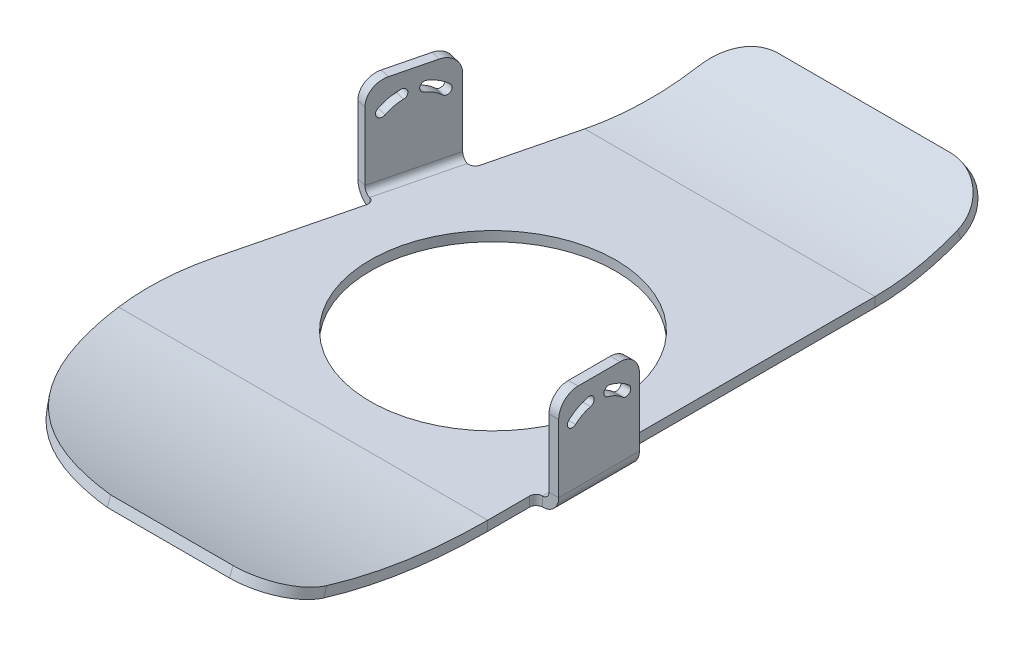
ISO-10303-21;
HEADER;
FILE_DESCRIPTION(('STEP AP214'),'2;1');
FILE_NAME('part.step','',(''),(''),'','','');
FILE_SCHEMA(('AUTOMOTIVE_DESIGN { 1 0 10303 214 1 1 1 1 }'));
ENDSEC;
DATA;
#1=APPLICATION_CONTEXT('core data for automotive mechanical design processes');
#2=APPLICATION_PROTOCOL_DEFINITION('international standard','automotive_design',2000,#1);
#3=PRODUCT_CONTEXT('',#1,'mechanical');
#4=PRODUCT('Part','Part','',(#3));
#5=PRODUCT_RELATED_PRODUCT_CATEGORY('part','',(#4));
#6=PRODUCT_DEFINITION_FORMATION('','',#4);
#7=PRODUCT_DEFINITION_CONTEXT('part definition',#1,'design');
#8=PRODUCT_DEFINITION('design','',#6,#7);
#9=PRODUCT_DEFINITION_SHAPE('','',#8);
#10=(LENGTH_UNIT() NAMED_UNIT(*) SI_UNIT(.MILLI.,.METRE.));
#11=(NAMED_UNIT(*) PLANE_ANGLE_UNIT() SI_UNIT($,.RADIAN.));
#12=(NAMED_UNIT(*) SI_UNIT($,.STERADIAN.) SOLID_ANGLE_UNIT());
#13=UNCERTAINTY_MEASURE_WITH_UNIT(LENGTH_MEASURE(1.E-05),#10,'distance_accuracy_value','');
#14=(GEOMETRIC_REPRESENTATION_CONTEXT(3) GLOBAL_UNCERTAINTY_ASSIGNED_CONTEXT((#13)) GLOBAL_UNIT_ASSIGNED_CONTEXT((#10,
#11,#12)) REPRESENTATION_CONTEXT('',''));
#15=CARTESIAN_POINT('',(0.,0.,0.));
#16=DIRECTION('',(0.,0.,1.));
#17=DIRECTION('',(1.,0.,0.));
#18=AXIS2_PLACEMENT_3D('',#15,#16,#17);
#19=CARTESIAN_POINT('',(-15.715516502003,26.,94.2899017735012));
#20=DIRECTION('',(-0.97047368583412,0.,-0.241207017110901));
#21=DIRECTION('',(-0.23408506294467,-0.241207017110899,0.941819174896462));
#22=AXIS2_PLACEMENT_3D('',#19,#20,#21);
#23=CYLINDRICAL_SURFACE('',#22,6.);
#24=CARTESIAN_POINT('',(-102.213628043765,26.,72.7911720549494));
#25=DIRECTION('',(-0.97047368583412,0.,-0.241207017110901));
#26=DIRECTION('',(0.23408506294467,0.241207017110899,-0.941819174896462));
#27=AXIS2_PLACEMENT_3D('',#24,#25,#26);
#28=CIRCLE('',#27,6.);
#29=CARTESIAN_POINT('',(-102.213628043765,32.,72.7911720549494));
#30=VERTEX_POINT('',#29);
#31=CARTESIAN_POINT('',(-100.7663859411,26.,66.9683299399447));
#32=VERTEX_POINT('',#31);
#33=EDGE_CURVE('E608',#30,#32,#28,.T.);
#34=ORIENTED_EDGE('',*,*,#33,.T.);
#35=DIRECTION('',(-0.97047368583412,0.,-0.241207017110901));
#36=VECTOR('',#35,1.);
#37=CARTESIAN_POINT('',(-14.2682743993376,26.,88.4670596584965));
#38=LINE('',#37,#36);
#39=CARTESIAN_POINT('',(-103.677806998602,26.,66.244708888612));
#40=VERTEX_POINT('',#39);
#41=EDGE_CURVE('E613',#32,#40,#38,.T.);
#42=ORIENTED_EDGE('',*,*,#41,.T.);
#43=CARTESIAN_POINT('',(-105.125049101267,26.,72.0675510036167));
#44=DIRECTION('',(-0.97047368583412,0.,-0.241207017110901));
#45=DIRECTION('',(0.23408506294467,0.241207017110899,-0.941819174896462));
#46=AXIS2_PLACEMENT_3D('',#43,#44,#45);
#47=CIRCLE('',#46,6.);
#48=CARTESIAN_POINT('',(-105.125049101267,32.,72.0675510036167));
#49=VERTEX_POINT('',#48);
#50=EDGE_CURVE('E618',#40,#49,#47,.F.);
#51=ORIENTED_EDGE('',*,*,#50,.T.);
#52=DIRECTION('',(-0.97047368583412,0.,-0.241207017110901));
#53=VECTOR('',#52,1.);
#54=CARTESIAN_POINT('',(-15.715516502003,32.,94.2899017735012));
#55=LINE('',#54,#53);
#56=EDGE_CURVE('E463',#49,#30,#55,.F.);
#57=ORIENTED_EDGE('',*,*,#56,.T.);
#58=EDGE_LOOP('',(#34,#42,#51,#57));
#59=FACE_BOUND('',#58,.T.);
#60=ADVANCED_FACE('F34',(#59),#23,.T.);
#61=CARTESIAN_POINT('',(-20.2984498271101,32.0000000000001,112.728901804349));
#62=DIRECTION('',(0.,1.,0.));
#63=DIRECTION('',(0.241207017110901,0.,-0.97047368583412));
#64=AXIS2_PLACEMENT_3D('',#61,#62,#63);
#65=PLANE('',#64);
#66=DIRECTION('',(-0.241207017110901,0.,0.97047368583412));
#67=VECTOR('',#66,1.);
#68=CARTESIAN_POINT('',(-106.796561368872,32.0000000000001,91.2301720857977));
#69=LINE('',#68,#67);
#70=CARTESIAN_POINT('',(-105.349319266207,32.,85.407329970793));
#71=VERTEX_POINT('',#70);
#72=EDGE_CURVE('E126',#30,#71,#69,.T.);
#73=ORIENTED_EDGE('',*,*,#72,.F.);
#74=ORIENTED_EDGE('',*,*,#56,.F.);
#75=DIRECTION('',(-0.241207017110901,0.,0.97047368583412));
#76=VECTOR('',#75,1.);
#77=CARTESIAN_POINT('',(-109.707982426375,32.0000000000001,90.506551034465));
#78=LINE('',#77,#76);
#79=CARTESIAN_POINT('',(-108.260740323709,32.,84.6837089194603));
#80=VERTEX_POINT('',#79);
#81=EDGE_CURVE('E400',#49,#80,#78,.T.);
#82=ORIENTED_EDGE('',*,*,#81,.T.);
#83=DIRECTION('',(-0.97047368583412,0.,-0.241207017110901));
#84=VECTOR('',#83,1.);
#85=CARTESIAN_POINT('',(-18.8512077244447,32.,106.906059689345));
#86=LINE('',#85,#84);
#87=EDGE_CURVE('E465',#71,#80,#86,.T.);
#88=ORIENTED_EDGE('',*,*,#87,.F.);
#89=EDGE_LOOP('',(#73,#74,#82,#88));
#90=FACE_BOUND('',#89,.T.);
#91=ADVANCED_FACE('F622',(#90),#65,.T.);
#92=CARTESIAN_POINT('',(36.7131452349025,23.2041740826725,105.456985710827));
#93=DIRECTION('',(-0.97047368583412,0.,-0.241207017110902));
#94=DIRECTION('',(0.241207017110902,0.,-0.97047368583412));
#95=AXIS2_PLACEMENT_3D('',#92,#93,#94);
#96=CYLINDRICAL_SURFACE('',#95,1.49999999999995);
#97=DIRECTION('',(-0.97047368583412,0.,-0.241207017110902));
#98=VECTOR('',#97,1.);
#99=CARTESIAN_POINT('',(36.47264833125,22.0835138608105,106.42460232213));
#100=LINE('',#99,#98);
#101=CARTESIAN_POINT('',(-102.017829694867,22.0835138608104,72.0033958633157));
#102=VERTEX_POINT('',#101);
#103=CARTESIAN_POINT('',(-104.92925075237,22.0835138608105,71.2797748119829));
#104=VERTEX_POINT('',#103);
#105=EDGE_CURVE('E460',#102,#104,#100,.T.);
#106=ORIENTED_EDGE('',*,*,#105,.F.);
#107=CARTESIAN_POINT('',(-101.777332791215,23.2041740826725,71.0357792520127));
#108=DIRECTION('',(-0.97047368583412,0.,-0.241207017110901));
#109=DIRECTION('',(-0.241207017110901,0.,0.97047368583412));
#110=AXIS2_PLACEMENT_3D('',#107,#108,#109);
#111=CIRCLE('',#110,1.49999999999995);
#112=CARTESIAN_POINT('',(-101.536835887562,24.3248343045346,70.0681626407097));
#113=VERTEX_POINT('',#112);
#114=EDGE_CURVE('E44',#102,#113,#111,.F.);
#115=ORIENTED_EDGE('',*,*,#114,.T.);
#116=DIRECTION('',(-0.97047368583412,0.,-0.241207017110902));
#117=VECTOR('',#116,1.);
#118=CARTESIAN_POINT('',(36.953642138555,24.3248343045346,104.489369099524));
#119=LINE('',#118,#117);
#120=CARTESIAN_POINT('',(-104.448256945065,24.3248343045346,69.344541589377));
#121=VERTEX_POINT('',#120);
#122=EDGE_CURVE('E454',#113,#121,#119,.T.);
#123=ORIENTED_EDGE('',*,*,#122,.T.);
#124=CARTESIAN_POINT('',(-104.688753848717,23.2041740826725,70.3121582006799));
#125=DIRECTION('',(0.97047368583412,0.,0.241207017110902));
#126=DIRECTION('',(-0.241207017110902,0.,0.97047368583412));
#127=AXIS2_PLACEMENT_3D('',#124,#125,#126);
#128=CIRCLE('',#127,1.49999999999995);
#129=EDGE_CURVE('E457',#104,#121,#128,.T.);
#130=ORIENTED_EDGE('',*,*,#129,.F.);
#131=EDGE_LOOP('',(#106,#115,#123,#130));
#132=FACE_BOUND('',#131,.T.);
#133=ADVANCED_FACE('F624',(#132),#96,.F.);
#134=CARTESIAN_POINT('',(34.7090043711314,13.8653389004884,113.520457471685));
#135=DIRECTION('',(-0.97047368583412,0.,-0.241207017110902));
#136=DIRECTION('',(0.241207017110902,0.,-0.97047368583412));
#137=AXIS2_PLACEMENT_3D('',#134,#135,#136);
#138=CYLINDRICAL_SURFACE('',#137,13.9999999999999);
#139=ORIENTED_EDGE('',*,*,#122,.F.);
#140=CARTESIAN_POINT('',(-103.781473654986,13.8653389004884,79.0992510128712));
#141=DIRECTION('',(-0.97047368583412,0.,-0.241207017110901));
#142=DIRECTION('',(-0.241207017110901,0.,0.97047368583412));
#143=AXIS2_PLACEMENT_3D('',#140,#141,#142);
#144=CIRCLE('',#143,13.9999999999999);
#145=CARTESIAN_POINT('',(-102.971018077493,27.4561593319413,75.8384594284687));
#146=VERTEX_POINT('',#145);
#147=EDGE_CURVE('E11',#113,#146,#144,.F.);
#148=ORIENTED_EDGE('',*,*,#147,.T.);
#149=DIRECTION('',(-0.97047368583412,0.,-0.241207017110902));
#150=VECTOR('',#149,1.);
#151=CARTESIAN_POINT('',(35.5194599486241,27.4561593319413,110.259665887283));
#152=LINE('',#151,#150);
#153=CARTESIAN_POINT('',(-105.882439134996,27.4561593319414,75.1148383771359));
#154=VERTEX_POINT('',#153);
#155=EDGE_CURVE('E448',#146,#154,#152,.T.);
#156=ORIENTED_EDGE('',*,*,#155,.T.);
#157=CARTESIAN_POINT('',(-106.692894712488,13.8653389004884,78.3756299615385));
#158=DIRECTION('',(0.97047368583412,0.,0.241207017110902));
#159=DIRECTION('',(-0.241207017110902,0.,0.97047368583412));
#160=AXIS2_PLACEMENT_3D('',#157,#158,#159);
#161=CIRCLE('',#160,13.9999999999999);
#162=EDGE_CURVE('E451',#121,#154,#161,.T.);
#163=ORIENTED_EDGE('',*,*,#162,.F.);
#164=EDGE_LOOP('',(#139,#148,#156,#163));
#165=FACE_BOUND('',#164,.T.);
#166=ADVANCED_FACE('F630',(#165),#138,.F.);
#167=CARTESIAN_POINT('',(35.4326254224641,26.,110.609036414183));
#168=DIRECTION('',(-0.97047368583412,0.,-0.241207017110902));
#169=DIRECTION('',(0.241207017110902,0.,-0.97047368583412));
#170=AXIS2_PLACEMENT_3D('',#167,#168,#169);
#171=CYLINDRICAL_SURFACE('',#170,1.49999999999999);
#172=ORIENTED_EDGE('',*,*,#155,.F.);
#173=CARTESIAN_POINT('',(-103.057852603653,26.,76.1878299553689));
#174=DIRECTION('',(-0.97047368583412,0.,-0.241207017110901));
#175=DIRECTION('',(-0.241207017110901,0.,0.97047368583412));
#176=AXIS2_PLACEMENT_3D('',#173,#174,#175);
#177=CIRCLE('',#176,1.49999999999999);
#178=CARTESIAN_POINT('',(-103.144687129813,24.5438406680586,76.5372004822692));
#179=VERTEX_POINT('',#178);
#180=EDGE_CURVE('E594',#146,#179,#177,.F.);
#181=ORIENTED_EDGE('',*,*,#180,.T.);
#182=DIRECTION('',(-0.97047368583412,0.,-0.241207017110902));
#183=VECTOR('',#182,1.);
#184=CARTESIAN_POINT('',(35.3457908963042,24.5438406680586,110.958406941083));
#185=LINE('',#184,#183);
#186=CARTESIAN_POINT('',(-106.056108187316,24.5438406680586,75.8135794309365));
#187=VERTEX_POINT('',#186);
#188=EDGE_CURVE('E442',#179,#187,#185,.T.);
#189=ORIENTED_EDGE('',*,*,#188,.T.);
#190=CARTESIAN_POINT('',(-105.969273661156,26.,75.4642089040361));
#191=DIRECTION('',(0.97047368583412,0.,0.241207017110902));
#192=DIRECTION('',(-0.241207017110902,0.,0.97047368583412));
#193=AXIS2_PLACEMENT_3D('',#190,#191,#192);
#194=CIRCLE('',#193,1.49999999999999);
#195=EDGE_CURVE('E445',#154,#187,#194,.T.);
#196=ORIENTED_EDGE('',*,*,#195,.F.);
#197=EDGE_LOOP('',(#172,#181,#189,#196));
#198=FACE_BOUND('',#197,.T.);
#199=ADVANCED_FACE('F638',(#198),#171,.F.);
#200=CARTESIAN_POINT('',(34.7090043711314,13.8653389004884,113.520457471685));
#201=DIRECTION('',(-0.97047368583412,0.,-0.241207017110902));
#202=DIRECTION('',(0.241207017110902,0.,-0.97047368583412));
#203=AXIS2_PLACEMENT_3D('',#200,#201,#202);
#204=CYLINDRICAL_SURFACE('',#203,11.);
#205=ORIENTED_EDGE('',*,*,#188,.F.);
#206=CARTESIAN_POINT('',(-103.781473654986,13.8653389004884,79.0992510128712));
#207=DIRECTION('',(-0.97047368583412,0.,-0.241207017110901));
#208=DIRECTION('',(-0.241207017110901,0.,0.97047368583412));
#209=AXIS2_PLACEMENT_3D('',#206,#207,#208);
#210=CIRCLE('',#209,11.);
#211=EDGE_CURVE('E592',#179,#102,#210,.T.);
#212=ORIENTED_EDGE('',*,*,#211,.T.);
#213=ORIENTED_EDGE('',*,*,#105,.T.);
#214=CARTESIAN_POINT('',(-106.692894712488,13.8653389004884,78.3756299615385));
#215=DIRECTION('',(-0.97047368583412,0.,-0.241207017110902));
#216=DIRECTION('',(-0.241207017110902,0.,0.97047368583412));
#217=AXIS2_PLACEMENT_3D('',#214,#215,#216);
#218=CIRCLE('',#217,11.);
#219=EDGE_CURVE('E440',#187,#104,#218,.T.);
#220=ORIENTED_EDGE('',*,*,#219,.F.);
#221=EDGE_LOOP('',(#205,#212,#213,#220));
#222=FACE_BOUND('',#221,.T.);
#223=ADVANCED_FACE('F642',(#222),#204,.T.);
#224=CARTESIAN_POINT('',(34.7090043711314,13.8653389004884,113.520457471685));
#225=DIRECTION('',(-0.97047368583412,0.,-0.241207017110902));
#226=DIRECTION('',(0.241207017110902,0.,-0.97047368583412));
#227=AXIS2_PLACEMENT_3D('',#224,#225,#226);
#228=CYLINDRICAL_SURFACE('',#227,11.);
#229=DIRECTION('',(-0.97047368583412,0.,-0.241207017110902));
#230=VECTOR('',#229,1.);
#231=CARTESIAN_POINT('',(32.9453604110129,22.0835138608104,120.616312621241));
#232=LINE('',#231,#230);
#233=CARTESIAN_POINT('',(-105.545117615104,22.0835138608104,86.1951061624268));
#234=VERTEX_POINT('',#233);
#235=CARTESIAN_POINT('',(-108.456538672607,22.0835138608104,85.4714851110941));
#236=VERTEX_POINT('',#235);
#237=EDGE_CURVE('E437',#234,#236,#232,.T.);
#238=ORIENTED_EDGE('',*,*,#237,.F.);
#239=CARTESIAN_POINT('',(-103.781473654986,13.8653389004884,79.0992510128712));
#240=DIRECTION('',(-0.97047368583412,0.,-0.241207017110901));
#241=DIRECTION('',(-0.241207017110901,0.,0.97047368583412));
#242=AXIS2_PLACEMENT_3D('',#239,#240,#241);
#243=CIRCLE('',#242,11.);
#244=CARTESIAN_POINT('',(-104.418260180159,24.5438406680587,81.6613015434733));
#245=VERTEX_POINT('',#244);
#246=EDGE_CURVE('E600',#234,#245,#243,.T.);
#247=ORIENTED_EDGE('',*,*,#246,.T.);
#248=DIRECTION('',(-0.97047368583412,0.,-0.241207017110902));
#249=VECTOR('',#248,1.);
#250=CARTESIAN_POINT('',(34.0722178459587,24.5438406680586,116.082508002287));
#251=LINE('',#250,#249);
#252=CARTESIAN_POINT('',(-107.329681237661,24.5438406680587,80.9376804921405));
#253=VERTEX_POINT('',#252);
#254=EDGE_CURVE('E431',#245,#253,#251,.T.);
#255=ORIENTED_EDGE('',*,*,#254,.T.);
#256=CARTESIAN_POINT('',(-106.692894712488,13.8653389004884,78.3756299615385));
#257=DIRECTION('',(-0.97047368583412,0.,-0.241207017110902));
#258=DIRECTION('',(0.241207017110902,0.,-0.97047368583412));
#259=AXIS2_PLACEMENT_3D('',#256,#257,#258);
#260=CIRCLE('',#259,11.);
#261=EDGE_CURVE('E434',#236,#253,#260,.T.);
#262=ORIENTED_EDGE('',*,*,#261,.F.);
#263=EDGE_LOOP('',(#238,#247,#255,#262));
#264=FACE_BOUND('',#263,.T.);
#265=ADVANCED_FACE('F646',(#264),#228,.T.);
#266=CARTESIAN_POINT('',(33.9853833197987,26.,116.431878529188));
#267=DIRECTION('',(-0.97047368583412,0.,-0.241207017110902));
#268=DIRECTION('',(0.241207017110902,0.,-0.97047368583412));
#269=AXIS2_PLACEMENT_3D('',#266,#267,#268);
#270=CYLINDRICAL_SURFACE('',#269,1.49999999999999);
#271=ORIENTED_EDGE('',*,*,#254,.F.);
#272=CARTESIAN_POINT('',(-104.505094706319,26.,82.0106720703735));
#273=DIRECTION('',(-0.97047368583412,0.,-0.241207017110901));
#274=DIRECTION('',(-0.241207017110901,0.,0.97047368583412));
#275=AXIS2_PLACEMENT_3D('',#272,#273,#274);
#276=CIRCLE('',#275,1.49999999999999);
#277=CARTESIAN_POINT('',(-104.591929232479,27.4561593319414,82.3600425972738));
#278=VERTEX_POINT('',#277);
#279=EDGE_CURVE('E597',#245,#278,#276,.F.);
#280=ORIENTED_EDGE('',*,*,#279,.T.);
#281=DIRECTION('',(-0.97047368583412,0.,-0.241207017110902));
#282=VECTOR('',#281,1.);
#283=CARTESIAN_POINT('',(33.8985487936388,27.4561593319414,116.781249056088));
#284=LINE('',#283,#282);
#285=CARTESIAN_POINT('',(-107.503350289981,27.4561593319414,81.6364215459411));
#286=VERTEX_POINT('',#285);
#287=EDGE_CURVE('E425',#278,#286,#284,.T.);
#288=ORIENTED_EDGE('',*,*,#287,.T.);
#289=CARTESIAN_POINT('',(-107.416515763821,26.,81.2870510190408));
#290=DIRECTION('',(0.97047368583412,0.,0.241207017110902));
#291=DIRECTION('',(0.241207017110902,0.,-0.97047368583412));
#292=AXIS2_PLACEMENT_3D('',#289,#290,#291);
#293=CIRCLE('',#292,1.49999999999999);
#294=EDGE_CURVE('E428',#253,#286,#293,.T.);
#295=ORIENTED_EDGE('',*,*,#294,.F.);
#296=EDGE_LOOP('',(#271,#280,#288,#295));
#297=FACE_BOUND('',#296,.T.);
#298=ADVANCED_FACE('F650',(#297),#270,.F.);
#299=CARTESIAN_POINT('',(34.7090043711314,13.8653389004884,113.520457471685));
#300=DIRECTION('',(-0.97047368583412,0.,-0.241207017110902));
#301=DIRECTION('',(0.241207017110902,0.,-0.97047368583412));
#302=AXIS2_PLACEMENT_3D('',#299,#300,#301);
#303=CYLINDRICAL_SURFACE('',#302,14.);
#304=ORIENTED_EDGE('',*,*,#287,.F.);
#305=CARTESIAN_POINT('',(-103.781473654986,13.8653389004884,79.0992510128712));
#306=DIRECTION('',(-0.97047368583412,0.,-0.241207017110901));
#307=DIRECTION('',(-0.241207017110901,0.,0.97047368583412));
#308=AXIS2_PLACEMENT_3D('',#305,#306,#307);
#309=CIRCLE('',#308,14.);
#310=CARTESIAN_POINT('',(-106.02611142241,24.3248343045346,88.1303393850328));
#311=VERTEX_POINT('',#310);
#312=EDGE_CURVE('E605',#278,#311,#309,.F.);
#313=ORIENTED_EDGE('',*,*,#312,.T.);
#314=DIRECTION('',(-0.97047368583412,0.,-0.241207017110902));
#315=VECTOR('',#314,1.);
#316=CARTESIAN_POINT('',(32.4643666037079,24.3248343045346,122.551545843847));
#317=LINE('',#316,#315);
#318=CARTESIAN_POINT('',(-108.937532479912,24.3248343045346,87.4067183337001));
#319=VERTEX_POINT('',#318);
#320=EDGE_CURVE('E419',#311,#319,#317,.T.);
#321=ORIENTED_EDGE('',*,*,#320,.T.);
#322=CARTESIAN_POINT('',(-106.692894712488,13.8653389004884,78.3756299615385));
#323=DIRECTION('',(0.97047368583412,0.,0.241207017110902));
#324=DIRECTION('',(0.241207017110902,0.,-0.97047368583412));
#325=AXIS2_PLACEMENT_3D('',#322,#323,#324);
#326=CIRCLE('',#325,14.);
#327=EDGE_CURVE('E422',#286,#319,#326,.T.);
#328=ORIENTED_EDGE('',*,*,#327,.F.);
#329=EDGE_LOOP('',(#304,#313,#321,#328));
#330=FACE_BOUND('',#329,.T.);
#331=ADVANCED_FACE('F654',(#330),#303,.F.);
#332=CARTESIAN_POINT('',(32.7048635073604,23.2041740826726,121.583929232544));
#333=DIRECTION('',(-0.97047368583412,0.,-0.241207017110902));
#334=DIRECTION('',(0.241207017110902,0.,-0.97047368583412));
#335=AXIS2_PLACEMENT_3D('',#332,#333,#334);
#336=CYLINDRICAL_SURFACE('',#335,1.49999999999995);
#337=ORIENTED_EDGE('',*,*,#320,.F.);
#338=CARTESIAN_POINT('',(-105.785614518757,23.2041740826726,87.1627227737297));
#339=DIRECTION('',(-0.97047368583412,0.,-0.241207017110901));
#340=DIRECTION('',(-0.241207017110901,0.,0.97047368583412));
#341=AXIS2_PLACEMENT_3D('',#338,#339,#340);
#342=CIRCLE('',#341,1.49999999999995);
#343=EDGE_CURVE('E603',#311,#234,#342,.F.);
#344=ORIENTED_EDGE('',*,*,#343,.T.);
#345=ORIENTED_EDGE('',*,*,#237,.T.);
#346=CARTESIAN_POINT('',(-108.697035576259,23.2041740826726,86.439101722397));
#347=DIRECTION('',(0.97047368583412,0.,0.241207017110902));
#348=DIRECTION('',(0.241207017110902,0.,-0.97047368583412));
#349=AXIS2_PLACEMENT_3D('',#346,#347,#348);
#350=CIRCLE('',#349,1.49999999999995);
#351=EDGE_CURVE('E417',#319,#236,#350,.T.);
#352=ORIENTED_EDGE('',*,*,#351,.F.);
#353=EDGE_LOOP('',(#337,#344,#345,#352));
#354=FACE_BOUND('',#353,.T.);
#355=ADVANCED_FACE('F658',(#354),#336,.F.);
#356=CARTESIAN_POINT('',(-18.8512077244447,26.,106.906059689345));
#357=DIRECTION('',(-0.97047368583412,0.,-0.241207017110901));
#358=DIRECTION('',(-0.23408506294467,-0.241207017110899,0.941819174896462));
#359=AXIS2_PLACEMENT_3D('',#356,#357,#358);
#360=CYLINDRICAL_SURFACE('',#359,6.);
#361=CARTESIAN_POINT('',(-105.349319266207,26.,85.407329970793));
#362=DIRECTION('',(-0.97047368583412,0.,-0.241207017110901));
#363=DIRECTION('',(0.23408506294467,0.241207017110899,-0.941819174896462));
#364=AXIS2_PLACEMENT_3D('',#361,#362,#363);
#365=CIRCLE('',#364,6.);
#366=CARTESIAN_POINT('',(-106.796561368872,26.,91.2301720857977));
#367=VERTEX_POINT('',#366);
#368=EDGE_CURVE('E611',#367,#71,#365,.T.);
#369=ORIENTED_EDGE('',*,*,#368,.T.);
#370=ORIENTED_EDGE('',*,*,#87,.T.);
#371=CARTESIAN_POINT('',(-108.260740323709,26.,84.6837089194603));
#372=DIRECTION('',(-0.97047368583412,0.,-0.241207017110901));
#373=DIRECTION('',(0.23408506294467,0.241207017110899,-0.941819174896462));
#374=AXIS2_PLACEMENT_3D('',#371,#372,#373);
#375=CIRCLE('',#374,6.);
#376=CARTESIAN_POINT('',(-109.707982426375,26.,90.506551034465));
#377=VERTEX_POINT('',#376);
#378=EDGE_CURVE('E407',#80,#377,#375,.F.);
#379=ORIENTED_EDGE('',*,*,#378,.T.);
#380=DIRECTION('',(-0.97047368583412,0.,-0.241207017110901));
#381=VECTOR('',#380,1.);
#382=CARTESIAN_POINT('',(-20.2984498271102,26.,112.728901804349));
#383=LINE('',#382,#381);
#384=EDGE_CURVE('E405',#377,#367,#383,.F.);
#385=ORIENTED_EDGE('',*,*,#384,.T.);
#386=EDGE_LOOP('',(#369,#370,#379,#385));
#387=FACE_BOUND('',#386,.T.);
#388=ADVANCED_FACE('F662',(#387),#360,.T.);
#389=CARTESIAN_POINT('',(-20.2984498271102,0.,112.72890180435));
#390=DIRECTION('',(-0.241207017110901,0.,0.97047368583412));
#391=DIRECTION('',(0.,1.,0.));
#392=AXIS2_PLACEMENT_3D('',#389,#390,#391);
#393=PLANE('',#392);
#394=DIRECTION('',(0.,-1.,0.));
#395=VECTOR('',#394,1.);
#396=CARTESIAN_POINT('',(-109.707982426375,0.,90.5065510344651));
#397=LINE('',#396,#395);
#398=CARTESIAN_POINT('',(-109.707982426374,5.00000000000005,90.5065510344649));
#399=VERTEX_POINT('',#398);
#400=EDGE_CURVE('E391',#377,#399,#397,.T.);
#401=ORIENTED_EDGE('',*,*,#400,.T.);
#402=DIRECTION('',(-0.97047368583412,0.,-0.241207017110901));
#403=VECTOR('',#402,1.);
#404=CARTESIAN_POINT('',(-20.2984498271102,5.00000000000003,112.72890180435));
#405=LINE('',#404,#403);
#406=CARTESIAN_POINT('',(-106.796561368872,5.00000000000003,91.2301720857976));
#407=VERTEX_POINT('',#406);
#408=EDGE_CURVE('E395',#407,#399,#405,.T.);
#409=ORIENTED_EDGE('',*,*,#408,.F.);
#410=DIRECTION('',(0.,-1.,0.));
#411=VECTOR('',#410,1.);
#412=CARTESIAN_POINT('',(-106.796561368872,0.,91.2301720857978));
#413=LINE('',#412,#411);
#414=EDGE_CURVE('E401',#367,#407,#413,.T.);
#415=ORIENTED_EDGE('',*,*,#414,.F.);
#416=ORIENTED_EDGE('',*,*,#384,.F.);
#417=EDGE_LOOP('',(#401,#409,#415,#416));
#418=FACE_BOUND('',#417,.T.);
#419=ADVANCED_FACE('F403',(#418),#393,.T.);
#420=CARTESIAN_POINT('',(-109.707982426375,32.0000000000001,90.506551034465));
#421=DIRECTION('',(0.97047368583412,0.,0.241207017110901));
#422=DIRECTION('',(-0.241207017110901,0.,0.97047368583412));
#423=AXIS2_PLACEMENT_3D('',#420,#421,#422);
#424=PLANE('',#423);
#425=ORIENTED_EDGE('',*,*,#351,.T.);
#426=ORIENTED_EDGE('',*,*,#261,.T.);
#427=ORIENTED_EDGE('',*,*,#294,.T.);
#428=ORIENTED_EDGE('',*,*,#327,.T.);
#429=EDGE_LOOP('',(#425,#426,#427,#428));
#430=FACE_BOUND('',#429,.T.);
#431=ORIENTED_EDGE('',*,*,#219,.T.);
#432=ORIENTED_EDGE('',*,*,#129,.T.);
#433=ORIENTED_EDGE('',*,*,#162,.T.);
#434=ORIENTED_EDGE('',*,*,#195,.T.);
#435=EDGE_LOOP('',(#431,#432,#433,#434));
#436=FACE_BOUND('',#435,.T.);
#437=ORIENTED_EDGE('',*,*,#81,.F.);
#438=ORIENTED_EDGE('',*,*,#50,.F.);
#439=DIRECTION('',(0.,1.,0.));
#440=VECTOR('',#439,1.);
#441=CARTESIAN_POINT('',(-103.677806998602,0.,66.244708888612));
#442=LINE('',#441,#440);
#443=CARTESIAN_POINT('',(-103.677806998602,4.99999999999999,66.244708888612));
#444=VERTEX_POINT('',#443);
#445=EDGE_CURVE('E134',#444,#40,#442,.T.);
#446=ORIENTED_EDGE('',*,*,#445,.F.);
#447=DIRECTION('',(0.241207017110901,0.,-0.97047368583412));
#448=VECTOR('',#447,1.);
#449=CARTESIAN_POINT('',(-109.707982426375,5.00000000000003,90.5065510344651));
#450=LINE('',#449,#448);
#451=EDGE_CURVE('E378',#399,#444,#450,.T.);
#452=ORIENTED_EDGE('',*,*,#451,.F.);
#453=ORIENTED_EDGE('',*,*,#400,.F.);
#454=ORIENTED_EDGE('',*,*,#378,.F.);
#455=EDGE_LOOP('',(#437,#438,#446,#452,#453,#454));
#456=FACE_BOUND('',#455,.T.);
#457=ADVANCED_FACE('F389',(#430,#436,#456),#424,.F.);
#458=CARTESIAN_POINT('',(-14.2682743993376,0.,88.4670596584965));
#459=DIRECTION('',(0.241207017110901,0.,-0.97047368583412));
#460=DIRECTION('',(0.,-1.,0.));
#461=AXIS2_PLACEMENT_3D('',#458,#459,#460);
#462=PLANE('',#461);
#463=DIRECTION('',(0.,1.,0.));
#464=VECTOR('',#463,1.);
#465=CARTESIAN_POINT('',(-100.7663859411,0.,66.9683299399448));
#466=LINE('',#465,#464);
#467=CARTESIAN_POINT('',(-100.7663859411,5.00000000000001,66.9683299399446));
#468=VERTEX_POINT('',#467);
#469=EDGE_CURVE('E616',#468,#32,#466,.T.);
#470=ORIENTED_EDGE('',*,*,#469,.F.);
#471=DIRECTION('',(-0.97047368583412,0.,-0.241207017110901));
#472=VECTOR('',#471,1.);
#473=CARTESIAN_POINT('',(-14.2682743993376,4.99999999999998,88.4670596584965));
#474=LINE('',#473,#472);
#475=EDGE_CURVE('E468',#468,#444,#474,.T.);
#476=ORIENTED_EDGE('',*,*,#475,.T.);
#477=ORIENTED_EDGE('',*,*,#445,.T.);
#478=ORIENTED_EDGE('',*,*,#41,.F.);
#479=EDGE_LOOP('',(#470,#476,#477,#478));
#480=FACE_BOUND('',#479,.T.);
#481=ADVANCED_FACE('F670',(#480),#462,.T.);
#482=CARTESIAN_POINT('',(-106.796561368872,32.0000000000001,91.2301720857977));
#483=DIRECTION('',(0.97047368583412,0.,0.241207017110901));
#484=DIRECTION('',(-0.241207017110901,0.,0.97047368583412));
#485=AXIS2_PLACEMENT_3D('',#482,#483,#484);
#486=PLANE('',#485);
#487=ORIENTED_EDGE('',*,*,#414,.T.);
#488=DIRECTION('',(0.241207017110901,0.,-0.97047368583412));
#489=VECTOR('',#488,1.);
#490=CARTESIAN_POINT('',(-106.796561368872,5.00000000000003,91.2301720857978));
#491=LINE('',#490,#489);
#492=EDGE_CURVE('E38',#407,#468,#491,.T.);
#493=ORIENTED_EDGE('',*,*,#492,.T.);
#494=ORIENTED_EDGE('',*,*,#469,.T.);
#495=ORIENTED_EDGE('',*,*,#33,.F.);
#496=ORIENTED_EDGE('',*,*,#72,.T.);
#497=ORIENTED_EDGE('',*,*,#368,.F.);
#498=EDGE_LOOP('',(#487,#493,#494,#495,#496,#497));
#499=FACE_BOUND('',#498,.T.);
#500=ORIENTED_EDGE('',*,*,#312,.F.);
#501=ORIENTED_EDGE('',*,*,#279,.F.);
#502=ORIENTED_EDGE('',*,*,#246,.F.);
#503=ORIENTED_EDGE('',*,*,#343,.F.);
#504=EDGE_LOOP('',(#500,#501,#502,#503));
#505=FACE_BOUND('',#504,.T.);
#506=ORIENTED_EDGE('',*,*,#180,.F.);
#507=ORIENTED_EDGE('',*,*,#147,.F.);
#508=ORIENTED_EDGE('',*,*,#114,.F.);
#509=ORIENTED_EDGE('',*,*,#211,.F.);
#510=EDGE_LOOP('',(#506,#507,#508,#509));
#511=FACE_BOUND('',#510,.T.);
#512=ADVANCED_FACE('F36',(#499,#505,#511),#486,.T.);
#513=CARTESIAN_POINT('',(-69.5934779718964,32.,120.));
#514=DIRECTION('',(0.,1.,0.));
#515=DIRECTION('',(0.,0.,1.));
#516=AXIS2_PLACEMENT_3D('',#513,#514,#515);
#517=PLANE('',#516);
#518=DIRECTION('',(0.,0.,-1.));
#519=VECTOR('',#518,1.);
#520=CARTESIAN_POINT('',(7.,32.,120.));
#521=LINE('',#520,#519);
#522=CARTESIAN_POINT('',(7.,32.,139.));
#523=VERTEX_POINT('',#522);
#524=CARTESIAN_POINT('',(7.,32.,126.));
#525=VERTEX_POINT('',#524);
#526=EDGE_CURVE('E516',#523,#525,#521,.T.);
#527=ORIENTED_EDGE('',*,*,#526,.T.);
#528=DIRECTION('',(1.,0.,0.));
#529=VECTOR('',#528,1.);
#530=CARTESIAN_POINT('',(-69.5934779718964,32.,126.));
#531=LINE('',#530,#529);
#532=CARTESIAN_POINT('',(4.,32.,126.));
#533=VERTEX_POINT('',#532);
#534=EDGE_CURVE('E578',#533,#525,#531,.T.);
#535=ORIENTED_EDGE('',*,*,#534,.F.);
#536=DIRECTION('',(0.,0.,-1.));
#537=VECTOR('',#536,1.);
#538=CARTESIAN_POINT('',(3.99999999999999,32.,120.));
#539=LINE('',#538,#537);
#540=CARTESIAN_POINT('',(4.,32.,139.));
#541=VERTEX_POINT('',#540);
#542=EDGE_CURVE('E581',#541,#533,#539,.T.);
#543=ORIENTED_EDGE('',*,*,#542,.F.);
#544=DIRECTION('',(1.,0.,0.));
#545=VECTOR('',#544,1.);
#546=CARTESIAN_POINT('',(-69.5934779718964,32.,139.));
#547=LINE('',#546,#545);
#548=EDGE_CURVE('E583',#523,#541,#547,.F.);
#549=ORIENTED_EDGE('',*,*,#548,.F.);
#550=EDGE_LOOP('',(#527,#535,#543,#549));
#551=FACE_BOUND('',#550,.T.);
#552=ADVANCED_FACE('F676',(#551),#517,.T.);
#553=CARTESIAN_POINT('',(-69.5934779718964,26.,139.));
#554=DIRECTION('',(1.,0.,0.));
#555=DIRECTION('',(0.,0.,1.));
#556=AXIS2_PLACEMENT_3D('',#553,#554,#555);
#557=CYLINDRICAL_SURFACE('',#556,6.);
#558=CARTESIAN_POINT('',(3.99999999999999,26.,139.));
#559=DIRECTION('',(1.,0.,0.));
#560=DIRECTION('',(0.,0.,-1.));
#561=AXIS2_PLACEMENT_3D('',#558,#559,#560);
#562=CIRCLE('',#561,6.);
#563=CARTESIAN_POINT('',(3.99999999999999,26.,145.));
#564=VERTEX_POINT('',#563);
#565=EDGE_CURVE('E224',#541,#564,#562,.T.);
#566=ORIENTED_EDGE('',*,*,#565,.T.);
#567=DIRECTION('',(1.,0.,0.));
#568=VECTOR('',#567,1.);
#569=CARTESIAN_POINT('',(-69.5934779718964,26.,145.));
#570=LINE('',#569,#568);
#571=CARTESIAN_POINT('',(6.99999999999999,26.,145.));
#572=VERTEX_POINT('',#571);
#573=EDGE_CURVE('E502',#564,#572,#570,.T.);
#574=ORIENTED_EDGE('',*,*,#573,.T.);
#575=CARTESIAN_POINT('',(6.99999999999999,26.,139.));
#576=DIRECTION('',(1.,0.,0.));
#577=DIRECTION('',(0.,0.,-1.));
#578=AXIS2_PLACEMENT_3D('',#575,#576,#577);
#579=CIRCLE('',#578,6.);
#580=EDGE_CURVE('E519',#572,#523,#579,.F.);
#581=ORIENTED_EDGE('',*,*,#580,.T.);
#582=ORIENTED_EDGE('',*,*,#548,.T.);
#583=EDGE_LOOP('',(#566,#574,#581,#582));
#584=FACE_BOUND('',#583,.T.);
#585=ADVANCED_FACE('F693',(#584),#557,.T.);
#586=CARTESIAN_POINT('',(-115.001,23.2041740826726,140.8088));
#587=DIRECTION('',(1.,0.,0.));
#588=DIRECTION('',(0.,0.,1.));
#589=AXIS2_PLACEMENT_3D('',#586,#587,#588);
#590=CYLINDRICAL_SURFACE('',#589,1.49999999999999);
#591=DIRECTION('',(1.,0.,0.));
#592=VECTOR('',#591,1.);
#593=CARTESIAN_POINT('',(-115.001,22.0835138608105,139.811744));
#594=LINE('',#593,#592);
#595=CARTESIAN_POINT('',(4.,22.0835138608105,139.811744));
#596=VERTEX_POINT('',#595);
#597=CARTESIAN_POINT('',(7.,22.0835138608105,139.811744));
#598=VERTEX_POINT('',#597);
#599=EDGE_CURVE('E575',#596,#598,#594,.T.);
#600=ORIENTED_EDGE('',*,*,#599,.F.);
#601=CARTESIAN_POINT('',(4.,23.2041740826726,140.8088));
#602=DIRECTION('',(1.,0.,0.));
#603=DIRECTION('',(0.,0.,-1.));
#604=AXIS2_PLACEMENT_3D('',#601,#602,#603);
#605=CIRCLE('',#604,1.49999999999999);
#606=CARTESIAN_POINT('',(4.,24.3248343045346,141.805856));
#607=VERTEX_POINT('',#606);
#608=EDGE_CURVE('E473',#596,#607,#605,.F.);
#609=ORIENTED_EDGE('',*,*,#608,.T.);
#610=DIRECTION('',(1.,0.,0.));
#611=VECTOR('',#610,1.);
#612=CARTESIAN_POINT('',(-115.001,24.3248343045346,141.805856));
#613=LINE('',#612,#611);
#614=CARTESIAN_POINT('',(7.,24.3248343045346,141.805856));
#615=VERTEX_POINT('',#614);
#616=EDGE_CURVE('E569',#607,#615,#613,.T.);
#617=ORIENTED_EDGE('',*,*,#616,.T.);
#618=CARTESIAN_POINT('',(7.,23.2041740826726,140.8088));
#619=DIRECTION('',(-1.,0.,0.));
#620=DIRECTION('',(0.,0.,-1.));
#621=AXIS2_PLACEMENT_3D('',#618,#619,#620);
#622=CIRCLE('',#621,1.49999999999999);
#623=EDGE_CURVE('E572',#598,#615,#622,.T.);
#624=ORIENTED_EDGE('',*,*,#623,.F.);
#625=EDGE_LOOP('',(#600,#609,#617,#624));
#626=FACE_BOUND('',#625,.T.);
#627=ADVANCED_FACE('F699',(#626),#590,.F.);
#628=CARTESIAN_POINT('',(-115.001,13.8653389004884,132.5));
#629=DIRECTION('',(1.,0.,0.));
#630=DIRECTION('',(0.,0.,1.));
#631=AXIS2_PLACEMENT_3D('',#628,#629,#630);
#632=CYLINDRICAL_SURFACE('',#631,14.);
#633=ORIENTED_EDGE('',*,*,#616,.F.);
#634=CARTESIAN_POINT('',(4.,13.8653389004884,132.5));
#635=DIRECTION('',(1.,0.,0.));
#636=DIRECTION('',(0.,0.,-1.));
#637=AXIS2_PLACEMENT_3D('',#634,#635,#636);
#638=CIRCLE('',#637,14.);
#639=CARTESIAN_POINT('',(4.,27.4561593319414,135.86));
#640=VERTEX_POINT('',#639);
#641=EDGE_CURVE('E143',#607,#640,#638,.F.);
#642=ORIENTED_EDGE('',*,*,#641,.T.);
#643=DIRECTION('',(1.,0.,0.));
#644=VECTOR('',#643,1.);
#645=CARTESIAN_POINT('',(-115.001,27.4561593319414,135.86));
#646=LINE('',#645,#644);
#647=CARTESIAN_POINT('',(7.,27.4561593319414,135.86));
#648=VERTEX_POINT('',#647);
#649=EDGE_CURVE('E564',#640,#648,#646,.T.);
#650=ORIENTED_EDGE('',*,*,#649,.T.);
#651=CARTESIAN_POINT('',(7.,13.8653389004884,132.5));
#652=DIRECTION('',(-1.,0.,0.));
#653=DIRECTION('',(0.,0.,-1.));
#654=AXIS2_PLACEMENT_3D('',#651,#652,#653);
#655=CIRCLE('',#654,14.);
#656=EDGE_CURVE('E566',#615,#648,#655,.T.);
#657=ORIENTED_EDGE('',*,*,#656,.F.);
#658=EDGE_LOOP('',(#633,#642,#650,#657));
#659=FACE_BOUND('',#658,.T.);
#660=ADVANCED_FACE('F708',(#659),#632,.F.);
#661=CARTESIAN_POINT('',(-115.001,26.,135.5));
#662=DIRECTION('',(1.,0.,0.));
#663=DIRECTION('',(0.,0.,1.));
#664=AXIS2_PLACEMENT_3D('',#661,#662,#663);
#665=CYLINDRICAL_SURFACE('',#664,1.5);
#666=ORIENTED_EDGE('',*,*,#649,.F.);
#667=CARTESIAN_POINT('',(4.,26.,135.5));
#668=DIRECTION('',(1.,0.,0.));
#669=DIRECTION('',(0.,0.,-1.));
#670=AXIS2_PLACEMENT_3D('',#667,#668,#669);
#671=CIRCLE('',#670,1.5);
#672=CARTESIAN_POINT('',(4.,24.5438406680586,135.14));
#673=VERTEX_POINT('',#672);
#674=EDGE_CURVE('E485',#640,#673,#671,.F.);
#675=ORIENTED_EDGE('',*,*,#674,.T.);
#676=DIRECTION('',(1.,0.,0.));
#677=VECTOR('',#676,1.);
#678=CARTESIAN_POINT('',(-115.001,24.5438406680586,135.14));
#679=LINE('',#678,#677);
#680=CARTESIAN_POINT('',(7.,24.5438406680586,135.14));
#681=VERTEX_POINT('',#680);
#682=EDGE_CURVE('E558',#673,#681,#679,.T.);
#683=ORIENTED_EDGE('',*,*,#682,.T.);
#684=CARTESIAN_POINT('',(7.,26.,135.5));
#685=DIRECTION('',(-1.,0.,0.));
#686=DIRECTION('',(0.,0.,-1.));
#687=AXIS2_PLACEMENT_3D('',#684,#685,#686);
#688=CIRCLE('',#687,1.5);
#689=EDGE_CURVE('E561',#648,#681,#688,.T.);
#690=ORIENTED_EDGE('',*,*,#689,.F.);
#691=EDGE_LOOP('',(#666,#675,#683,#690));
#692=FACE_BOUND('',#691,.T.);
#693=ADVANCED_FACE('F712',(#692),#665,.F.);
#694=CARTESIAN_POINT('',(-115.001,13.8653389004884,132.5));
#695=DIRECTION('',(1.,0.,0.));
#696=DIRECTION('',(0.,0.,1.));
#697=AXIS2_PLACEMENT_3D('',#694,#695,#696);
#698=CYLINDRICAL_SURFACE('',#697,11.);
#699=ORIENTED_EDGE('',*,*,#682,.F.);
#700=CARTESIAN_POINT('',(4.,13.8653389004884,132.5));
#701=DIRECTION('',(1.,0.,0.));
#702=DIRECTION('',(0.,0.,-1.));
#703=AXIS2_PLACEMENT_3D('',#700,#701,#702);
#704=CIRCLE('',#703,11.);
#705=EDGE_CURVE('E478',#673,#596,#704,.T.);
#706=ORIENTED_EDGE('',*,*,#705,.T.);
#707=ORIENTED_EDGE('',*,*,#599,.T.);
#708=CARTESIAN_POINT('',(7.,13.8653389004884,132.5));
#709=DIRECTION('',(1.,0.,0.));
#710=DIRECTION('',(0.,0.,-1.));
#711=AXIS2_PLACEMENT_3D('',#708,#709,#710);
#712=CIRCLE('',#711,11.);
#713=EDGE_CURVE('E556',#681,#598,#712,.T.);
#714=ORIENTED_EDGE('',*,*,#713,.F.);
#715=EDGE_LOOP('',(#699,#706,#707,#714));
#716=FACE_BOUND('',#715,.T.);
#717=ADVANCED_FACE('F715',(#716),#698,.T.);
#718=CARTESIAN_POINT('',(-115.001,23.2041740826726,124.1912));
#719=DIRECTION('',(1.,0.,0.));
#720=DIRECTION('',(0.,0.,1.));
#721=AXIS2_PLACEMENT_3D('',#718,#719,#720);
#722=CYLINDRICAL_SURFACE('',#721,1.49999999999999);
#723=DIRECTION('',(1.,0.,0.));
#724=VECTOR('',#723,1.);
#725=CARTESIAN_POINT('',(-115.001,24.3248343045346,123.194144));
#726=LINE('',#725,#724);
#727=CARTESIAN_POINT('',(4.,24.3248343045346,123.194144));
#728=VERTEX_POINT('',#727);
#729=CARTESIAN_POINT('',(7.,24.3248343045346,123.194144));
#730=VERTEX_POINT('',#729);
#731=EDGE_CURVE('E553',#728,#730,#726,.T.);
#732=ORIENTED_EDGE('',*,*,#731,.F.);
#733=CARTESIAN_POINT('',(4.,23.2041740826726,124.1912));
#734=DIRECTION('',(1.,0.,0.));
#735=DIRECTION('',(0.,0.,-1.));
#736=AXIS2_PLACEMENT_3D('',#733,#734,#735);
#737=CIRCLE('',#736,1.49999999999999);
#738=CARTESIAN_POINT('',(4.,22.0835138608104,125.188256));
#739=VERTEX_POINT('',#738);
#740=EDGE_CURVE('E491',#728,#739,#737,.F.);
#741=ORIENTED_EDGE('',*,*,#740,.T.);
#742=DIRECTION('',(1.,0.,0.));
#743=VECTOR('',#742,1.);
#744=CARTESIAN_POINT('',(-115.001,22.0835138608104,125.188256));
#745=LINE('',#744,#743);
#746=CARTESIAN_POINT('',(7.,22.0835138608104,125.188256));
#747=VERTEX_POINT('',#746);
#748=EDGE_CURVE('E547',#739,#747,#745,.T.);
#749=ORIENTED_EDGE('',*,*,#748,.T.);
#750=CARTESIAN_POINT('',(7.,23.2041740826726,124.1912));
#751=DIRECTION('',(-1.,0.,0.));
#752=DIRECTION('',(0.,0.,1.));
#753=AXIS2_PLACEMENT_3D('',#750,#751,#752);
#754=CIRCLE('',#753,1.49999999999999);
#755=EDGE_CURVE('E550',#730,#747,#754,.T.);
#756=ORIENTED_EDGE('',*,*,#755,.F.);
#757=EDGE_LOOP('',(#732,#741,#749,#756));
#758=FACE_BOUND('',#757,.T.);
#759=ADVANCED_FACE('F719',(#758),#722,.F.);
#760=CARTESIAN_POINT('',(-115.001,13.8653389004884,132.5));
#761=DIRECTION('',(1.,0.,0.));
#762=DIRECTION('',(0.,0.,1.));
#763=AXIS2_PLACEMENT_3D('',#760,#761,#762);
#764=CYLINDRICAL_SURFACE('',#763,11.);
#765=ORIENTED_EDGE('',*,*,#748,.F.);
#766=CARTESIAN_POINT('',(4.,13.8653389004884,132.5));
#767=DIRECTION('',(1.,0.,0.));
#768=DIRECTION('',(0.,0.,-1.));
#769=AXIS2_PLACEMENT_3D('',#766,#767,#768);
#770=CIRCLE('',#769,11.);
#771=CARTESIAN_POINT('',(4.,24.5438406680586,129.86));
#772=VERTEX_POINT('',#771);
#773=EDGE_CURVE('E488',#739,#772,#770,.T.);
#774=ORIENTED_EDGE('',*,*,#773,.T.);
#775=DIRECTION('',(1.,0.,0.));
#776=VECTOR('',#775,1.);
#777=CARTESIAN_POINT('',(-115.001,24.5438406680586,129.86));
#778=LINE('',#777,#776);
#779=CARTESIAN_POINT('',(7.,24.5438406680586,129.86));
#780=VERTEX_POINT('',#779);
#781=EDGE_CURVE('E541',#772,#780,#778,.T.);
#782=ORIENTED_EDGE('',*,*,#781,.T.);
#783=CARTESIAN_POINT('',(7.,13.8653389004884,132.5));
#784=DIRECTION('',(1.,0.,0.));
#785=DIRECTION('',(0.,0.,1.));
#786=AXIS2_PLACEMENT_3D('',#783,#784,#785);
#787=CIRCLE('',#786,11.);
#788=EDGE_CURVE('E544',#747,#780,#787,.T.);
#789=ORIENTED_EDGE('',*,*,#788,.F.);
#790=EDGE_LOOP('',(#765,#774,#782,#789));
#791=FACE_BOUND('',#790,.T.);
#792=ADVANCED_FACE('F723',(#791),#764,.T.);
#793=CARTESIAN_POINT('',(-115.001,26.,129.5));
#794=DIRECTION('',(1.,0.,0.));
#795=DIRECTION('',(0.,0.,1.));
#796=AXIS2_PLACEMENT_3D('',#793,#794,#795);
#797=CYLINDRICAL_SURFACE('',#796,1.5);
#798=ORIENTED_EDGE('',*,*,#781,.F.);
#799=CARTESIAN_POINT('',(4.,26.,129.5));
#800=DIRECTION('',(1.,0.,0.));
#801=DIRECTION('',(0.,0.,-1.));
#802=AXIS2_PLACEMENT_3D('',#799,#800,#801);
#803=CIRCLE('',#802,1.5);
#804=CARTESIAN_POINT('',(4.,27.4561593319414,129.14));
#805=VERTEX_POINT('',#804);
#806=EDGE_CURVE('E496',#772,#805,#803,.F.);
#807=ORIENTED_EDGE('',*,*,#806,.T.);
#808=DIRECTION('',(1.,0.,0.));
#809=VECTOR('',#808,1.);
#810=CARTESIAN_POINT('',(-115.001,27.4561593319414,129.14));
#811=LINE('',#810,#809);
#812=CARTESIAN_POINT('',(7.,27.4561593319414,129.14));
#813=VERTEX_POINT('',#812);
#814=EDGE_CURVE('E535',#805,#813,#811,.T.);
#815=ORIENTED_EDGE('',*,*,#814,.T.);
#816=CARTESIAN_POINT('',(7.,26.,129.5));
#817=DIRECTION('',(-1.,0.,0.));
#818=DIRECTION('',(0.,0.,1.));
#819=AXIS2_PLACEMENT_3D('',#816,#817,#818);
#820=CIRCLE('',#819,1.5);
#821=EDGE_CURVE('E538',#780,#813,#820,.T.);
#822=ORIENTED_EDGE('',*,*,#821,.F.);
#823=EDGE_LOOP('',(#798,#807,#815,#822));
#824=FACE_BOUND('',#823,.T.);
#825=ADVANCED_FACE('F727',(#824),#797,.F.);
#826=CARTESIAN_POINT('',(-115.001,13.8653389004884,132.5));
#827=DIRECTION('',(1.,0.,0.));
#828=DIRECTION('',(0.,0.,1.));
#829=AXIS2_PLACEMENT_3D('',#826,#827,#828);
#830=CYLINDRICAL_SURFACE('',#829,14.);
#831=ORIENTED_EDGE('',*,*,#814,.F.);
#832=CARTESIAN_POINT('',(4.,13.8653389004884,132.5));
#833=DIRECTION('',(1.,0.,0.));
#834=DIRECTION('',(0.,0.,-1.));
#835=AXIS2_PLACEMENT_3D('',#832,#833,#834);
#836=CIRCLE('',#835,14.);
#837=EDGE_CURVE('E494',#805,#728,#836,.F.);
#838=ORIENTED_EDGE('',*,*,#837,.T.);
#839=ORIENTED_EDGE('',*,*,#731,.T.);
#840=CARTESIAN_POINT('',(7.,13.8653389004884,132.5));
#841=DIRECTION('',(-1.,0.,0.));
#842=DIRECTION('',(0.,0.,1.));
#843=AXIS2_PLACEMENT_3D('',#840,#841,#842);
#844=CIRCLE('',#843,14.);
#845=EDGE_CURVE('E533',#813,#730,#844,.T.);
#846=ORIENTED_EDGE('',*,*,#845,.F.);
#847=EDGE_LOOP('',(#831,#838,#839,#846));
#848=FACE_BOUND('',#847,.T.);
#849=ADVANCED_FACE('F731',(#848),#830,.F.);
#850=CARTESIAN_POINT('',(-69.5934779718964,26.,126.));
#851=DIRECTION('',(1.,0.,0.));
#852=DIRECTION('',(0.,0.,1.));
#853=AXIS2_PLACEMENT_3D('',#850,#851,#852);
#854=CYLINDRICAL_SURFACE('',#853,6.);
#855=CARTESIAN_POINT('',(3.99999999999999,26.,126.));
#856=DIRECTION('',(1.,0.,0.));
#857=DIRECTION('',(0.,0.,-1.));
#858=AXIS2_PLACEMENT_3D('',#855,#856,#857);
#859=CIRCLE('',#858,6.);
#860=CARTESIAN_POINT('',(3.99999999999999,26.,120.));
#861=VERTEX_POINT('',#860);
#862=EDGE_CURVE('E499',#861,#533,#859,.T.);
#863=ORIENTED_EDGE('',*,*,#862,.T.);
#864=ORIENTED_EDGE('',*,*,#534,.T.);
#865=CARTESIAN_POINT('',(6.99999999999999,26.,126.));
#866=DIRECTION('',(1.,0.,0.));
#867=DIRECTION('',(0.,0.,-1.));
#868=AXIS2_PLACEMENT_3D('',#865,#866,#867);
#869=CIRCLE('',#868,6.);
#870=CARTESIAN_POINT('',(7.,26.,120.));
#871=VERTEX_POINT('',#870);
#872=EDGE_CURVE('E513',#525,#871,#869,.F.);
#873=ORIENTED_EDGE('',*,*,#872,.T.);
#874=DIRECTION('',(1.,0.,0.));
#875=VECTOR('',#874,1.);
#876=CARTESIAN_POINT('',(-69.5934779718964,26.,120.));
#877=LINE('',#876,#875);
#878=EDGE_CURVE('E528',#871,#861,#877,.F.);
#879=ORIENTED_EDGE('',*,*,#878,.T.);
#880=EDGE_LOOP('',(#863,#864,#873,#879));
#881=FACE_BOUND('',#880,.T.);
#882=ADVANCED_FACE('F735',(#881),#854,.T.);
#883=CARTESIAN_POINT('',(-69.5934779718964,0.,120.));
#884=DIRECTION('',(0.,0.,-1.));
#885=DIRECTION('',(1.,0.,0.));
#886=AXIS2_PLACEMENT_3D('',#883,#884,#885);
#887=PLANE('',#886);
#888=DIRECTION('',(0.,-1.,0.));
#889=VECTOR('',#888,1.);
#890=CARTESIAN_POINT('',(7.,0.,120.));
#891=LINE('',#890,#889);
#892=CARTESIAN_POINT('',(7.,5.,120.));
#893=VERTEX_POINT('',#892);
#894=EDGE_CURVE('E510',#871,#893,#891,.T.);
#895=ORIENTED_EDGE('',*,*,#894,.T.);
#896=DIRECTION('',(1.,0.,0.));
#897=VECTOR('',#896,1.);
#898=CARTESIAN_POINT('',(-69.5934779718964,5.00000000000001,120.));
#899=LINE('',#898,#897);
#900=CARTESIAN_POINT('',(4.,5.,120.));
#901=VERTEX_POINT('',#900);
#902=EDGE_CURVE('E522',#901,#893,#899,.T.);
#903=ORIENTED_EDGE('',*,*,#902,.F.);
#904=DIRECTION('',(0.,-1.,0.));
#905=VECTOR('',#904,1.);
#906=CARTESIAN_POINT('',(3.99999999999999,0.,120.));
#907=LINE('',#906,#905);
#908=EDGE_CURVE('E525',#861,#901,#907,.T.);
#909=ORIENTED_EDGE('',*,*,#908,.F.);
#910=ORIENTED_EDGE('',*,*,#878,.F.);
#911=EDGE_LOOP('',(#895,#903,#909,#910));
#912=FACE_BOUND('',#911,.T.);
#913=ADVANCED_FACE('F739',(#912),#887,.T.);
#914=CARTESIAN_POINT('',(7.,32.,120.));
#915=DIRECTION('',(-1.,0.,0.));
#916=DIRECTION('',(0.,0.,-1.));
#917=AXIS2_PLACEMENT_3D('',#914,#915,#916);
#918=PLANE('',#917);
#919=ORIENTED_EDGE('',*,*,#845,.T.);
#920=ORIENTED_EDGE('',*,*,#755,.T.);
#921=ORIENTED_EDGE('',*,*,#788,.T.);
#922=ORIENTED_EDGE('',*,*,#821,.T.);
#923=EDGE_LOOP('',(#919,#920,#921,#922));
#924=FACE_BOUND('',#923,.T.);
#925=ORIENTED_EDGE('',*,*,#713,.T.);
#926=ORIENTED_EDGE('',*,*,#623,.T.);
#927=ORIENTED_EDGE('',*,*,#656,.T.);
#928=ORIENTED_EDGE('',*,*,#689,.T.);
#929=EDGE_LOOP('',(#925,#926,#927,#928));
#930=FACE_BOUND('',#929,.T.);
#931=DIRECTION('',(0.,1.,0.));
#932=VECTOR('',#931,1.);
#933=CARTESIAN_POINT('',(6.99999999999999,0.,145.));
#934=LINE('',#933,#932);
#935=CARTESIAN_POINT('',(7.,5.,145.));
#936=VERTEX_POINT('',#935);
#937=EDGE_CURVE('E218',#936,#572,#934,.T.);
#938=ORIENTED_EDGE('',*,*,#937,.F.);
#939=DIRECTION('',(0.,0.,1.));
#940=VECTOR('',#939,1.);
#941=CARTESIAN_POINT('',(6.99999999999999,5.00000000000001,120.));
#942=LINE('',#941,#940);
#943=EDGE_CURVE('E507',#893,#936,#942,.T.);
#944=ORIENTED_EDGE('',*,*,#943,.F.);
#945=ORIENTED_EDGE('',*,*,#894,.F.);
#946=ORIENTED_EDGE('',*,*,#872,.F.);
#947=ORIENTED_EDGE('',*,*,#526,.F.);
#948=ORIENTED_EDGE('',*,*,#580,.F.);
#949=EDGE_LOOP('',(#938,#944,#945,#946,#947,#948));
#950=FACE_BOUND('',#949,.T.);
#951=ADVANCED_FACE('F743',(#924,#930,#950),#918,.F.);
#952=CARTESIAN_POINT('',(-69.5934779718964,0.,145.));
#953=DIRECTION('',(0.,0.,1.));
#954=DIRECTION('',(0.,-1.,0.));
#955=AXIS2_PLACEMENT_3D('',#952,#953,#954);
#956=PLANE('',#955);
#957=DIRECTION('',(0.,1.,0.));
#958=VECTOR('',#957,1.);
#959=CARTESIAN_POINT('',(3.99999999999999,0.,145.));
#960=LINE('',#959,#958);
#961=CARTESIAN_POINT('',(4.,5.,145.));
#962=VERTEX_POINT('',#961);
#963=EDGE_CURVE('E505',#962,#564,#960,.T.);
#964=ORIENTED_EDGE('',*,*,#963,.F.);
#965=DIRECTION('',(1.,0.,0.));
#966=VECTOR('',#965,1.);
#967=CARTESIAN_POINT('',(-69.5934779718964,5.,145.));
#968=LINE('',#967,#966);
#969=EDGE_CURVE('E585',#962,#936,#968,.T.);
#970=ORIENTED_EDGE('',*,*,#969,.T.);
#971=ORIENTED_EDGE('',*,*,#937,.T.);
#972=ORIENTED_EDGE('',*,*,#573,.F.);
#973=EDGE_LOOP('',(#964,#970,#971,#972));
#974=FACE_BOUND('',#973,.T.);
#975=ADVANCED_FACE('F747',(#974),#956,.T.);
#976=CARTESIAN_POINT('',(3.99999999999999,32.,120.));
#977=DIRECTION('',(-1.,0.,0.));
#978=DIRECTION('',(0.,0.,-1.));
#979=AXIS2_PLACEMENT_3D('',#976,#977,#978);
#980=PLANE('',#979);
#981=ORIENTED_EDGE('',*,*,#542,.T.);
#982=ORIENTED_EDGE('',*,*,#862,.F.);
#983=ORIENTED_EDGE('',*,*,#908,.T.);
#984=DIRECTION('',(0.,0.,1.));
#985=VECTOR('',#984,1.);
#986=CARTESIAN_POINT('',(3.99999999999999,5.00000000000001,120.));
#987=LINE('',#986,#985);
#988=EDGE_CURVE('E587',#901,#962,#987,.T.);
#989=ORIENTED_EDGE('',*,*,#988,.T.);
#990=ORIENTED_EDGE('',*,*,#963,.T.);
#991=ORIENTED_EDGE('',*,*,#565,.F.);
#992=EDGE_LOOP('',(#981,#982,#983,#989,#990,#991));
#993=FACE_BOUND('',#992,.T.);
#994=ORIENTED_EDGE('',*,*,#806,.F.);
#995=ORIENTED_EDGE('',*,*,#773,.F.);
#996=ORIENTED_EDGE('',*,*,#740,.F.);
#997=ORIENTED_EDGE('',*,*,#837,.F.);
#998=EDGE_LOOP('',(#994,#995,#996,#997));
#999=FACE_BOUND('',#998,.T.);
#1000=ORIENTED_EDGE('',*,*,#674,.F.);
#1001=ORIENTED_EDGE('',*,*,#641,.F.);
#1002=ORIENTED_EDGE('',*,*,#608,.F.);
#1003=ORIENTED_EDGE('',*,*,#705,.F.);
#1004=EDGE_LOOP('',(#1000,#1001,#1002,#1003));
#1005=FACE_BOUND('',#1004,.T.);
#1006=ADVANCED_FACE('F750',(#993,#999,#1005),#980,.T.);
#1007=CARTESIAN_POINT('',(-80.,338.195465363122,0.));
#1008=DIRECTION('',(0.97047368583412,0.,0.241207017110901));
#1009=DIRECTION('',(-0.241207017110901,0.,0.97047368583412));
#1010=AXIS2_PLACEMENT_3D('',#1007,#1008,#1009);
#1011=PLANE('',#1010);
#1012=DIRECTION('',(0.241207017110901,0.,-0.97047368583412));
#1013=VECTOR('',#1012,1.);
#1014=CARTESIAN_POINT('',(-80.,3.00000000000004,0.));
#1015=LINE('',#1014,#1013);
#1016=CARTESIAN_POINT('',(-96.4020771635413,3.00000000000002,65.9922106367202));
#1017=VERTEX_POINT('',#1016);
#1018=CARTESIAN_POINT('',(-89.9418261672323,3.,40.));
#1019=VERTEX_POINT('',#1018);
#1020=EDGE_CURVE('E1052',#1017,#1019,#1015,.T.);
#1021=ORIENTED_EDGE('',*,*,#1020,.T.);
#1022=CARTESIAN_POINT('',(-89.9418261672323,0.,40.));
#1023=CARTESIAN_POINT('',(-89.9418261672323,3.00000000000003,40.));
#1024=B_SPLINE_CURVE_WITH_KNOTS('',1,(#1022,#1023),.UNSPECIFIED.,.F.,.F.,(2,2),(0.,1.),.UNSPECIFIED.);
#1025=CARTESIAN_POINT('',(-89.9418261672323,0.,40.));
#1026=VERTEX_POINT('',#1025);
#1027=EDGE_CURVE('E943',#1019,#1026,#1024,.F.);
#1028=ORIENTED_EDGE('',*,*,#1027,.T.);
#1029=DIRECTION('',(0.241207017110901,0.,-0.97047368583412));
#1030=VECTOR('',#1029,1.);
#1031=CARTESIAN_POINT('',(-80.,0.,0.));
#1032=LINE('',#1031,#1030);
#1033=CARTESIAN_POINT('',(-96.4020771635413,0.,65.9922106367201));
#1034=VERTEX_POINT('',#1033);
#1035=EDGE_CURVE('E1043',#1034,#1026,#1032,.T.);
#1036=ORIENTED_EDGE('',*,*,#1035,.F.);
#1037=DIRECTION('',(0.,-1.,0.));
#1038=VECTOR('',#1037,1.);
#1039=CARTESIAN_POINT('',(-96.4020771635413,0.,65.9922106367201));
#1040=LINE('',#1039,#1038);
#1041=EDGE_CURVE('E1176',#1017,#1034,#1040,.T.);
#1042=ORIENTED_EDGE('',*,*,#1041,.F.);
#1043=EDGE_LOOP('',(#1021,#1028,#1036,#1042));
#1044=FACE_BOUND('',#1043,.T.);
#1045=ADVANCED_FACE('F752',(#1044),#1011,.F.);
#1046=CARTESIAN_POINT('',(0.,338.195465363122,40.0000000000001));
#1047=DIRECTION('',(1.,0.,0.));
#1048=DIRECTION('',(0.,0.,1.));
#1049=AXIS2_PLACEMENT_3D('',#1046,#1047,#1048);
#1050=PLANE('',#1049);
#1051=DIRECTION('',(0.,0.,1.));
#1052=VECTOR('',#1051,1.);
#1053=CARTESIAN_POINT('',(0.,0.,0.));
#1054=LINE('',#1053,#1052);
#1055=CARTESIAN_POINT('',(0.,0.,40.));
#1056=VERTEX_POINT('',#1055);
#1057=CARTESIAN_POINT('',(0.,0.,118.));
#1058=VERTEX_POINT('',#1057);
#1059=EDGE_CURVE('E1113',#1056,#1058,#1054,.T.);
#1060=ORIENTED_EDGE('',*,*,#1059,.F.);
#1061=DIRECTION('',(0.,-1.,0.));
#1062=VECTOR('',#1061,1.);
#1063=CARTESIAN_POINT('',(0.,338.195465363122,40.0000000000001));
#1064=LINE('',#1063,#1062);
#1065=CARTESIAN_POINT('',(0.,3.,40.));
#1066=VERTEX_POINT('',#1065);
#1067=EDGE_CURVE('E1054',#1066,#1056,#1064,.T.);
#1068=ORIENTED_EDGE('',*,*,#1067,.F.);
#1069=DIRECTION('',(0.,0.,-1.));
#1070=VECTOR('',#1069,1.);
#1071=CARTESIAN_POINT('',(0.,3.00000000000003,40.));
#1072=LINE('',#1071,#1070);
#1073=CARTESIAN_POINT('',(0.,3.00000000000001,118.));
#1074=VERTEX_POINT('',#1073);
#1075=EDGE_CURVE('E1128',#1074,#1066,#1072,.T.);
#1076=ORIENTED_EDGE('',*,*,#1075,.F.);
#1077=DIRECTION('',(0.,-1.,0.));
#1078=VECTOR('',#1077,1.);
#1079=CARTESIAN_POINT('',(0.,3.00000000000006,118.));
#1080=LINE('',#1079,#1078);
#1081=EDGE_CURVE('E1127',#1058,#1074,#1080,.F.);
#1082=ORIENTED_EDGE('',*,*,#1081,.F.);
#1083=EDGE_LOOP('',(#1060,#1068,#1076,#1082));
#1084=FACE_BOUND('',#1083,.T.);
#1085=ADVANCED_FACE('F756',(#1084),#1050,.T.);
#1086=CARTESIAN_POINT('',(0.,3.00000000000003,160.));
#1087=VERTEX_POINT('',#1086);
#1088=CARTESIAN_POINT('',(0.,3.,147.));
#1089=VERTEX_POINT('',#1088);
#1090=EDGE_CURVE('E1101',#1087,#1089,#1072,.T.);
#1091=ORIENTED_EDGE('',*,*,#1090,.F.);
#1092=DIRECTION('',(0.,-1.,0.));
#1093=VECTOR('',#1092,1.);
#1094=CARTESIAN_POINT('',(0.,338.195465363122,160.));
#1095=LINE('',#1094,#1093);
#1096=CARTESIAN_POINT('',(0.,0.,160.));
#1097=VERTEX_POINT('',#1096);
#1098=EDGE_CURVE('E1150',#1087,#1097,#1095,.T.);
#1099=ORIENTED_EDGE('',*,*,#1098,.T.);
#1100=CARTESIAN_POINT('',(0.,0.,147.));
#1101=VERTEX_POINT('',#1100);
#1102=EDGE_CURVE('E1117',#1101,#1097,#1054,.T.);
#1103=ORIENTED_EDGE('',*,*,#1102,.F.);
#1104=DIRECTION('',(0.,-1.,0.));
#1105=VECTOR('',#1104,1.);
#1106=CARTESIAN_POINT('',(0.,338.195465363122,147.));
#1107=LINE('',#1106,#1105);
#1108=EDGE_CURVE('E1124',#1089,#1101,#1107,.T.);
#1109=ORIENTED_EDGE('',*,*,#1108,.F.);
#1110=EDGE_LOOP('',(#1091,#1099,#1103,#1109));
#1111=FACE_BOUND('',#1110,.T.);
#1112=ADVANCED_FACE('F1076',(#1111),#1050,.T.);
#1113=CARTESIAN_POINT('',(-40.,338.195465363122,150.));
#1114=DIRECTION('',(0.,-1.,0.));
#1115=DIRECTION('',(0.,0.,1.));
#1116=AXIS2_PLACEMENT_3D('',#1113,#1114,#1115);
#1117=CYLINDRICAL_SURFACE('',#1116,75.);
#1118=CARTESIAN_POINT('',(-40.,0.,150.));
#1119=DIRECTION('',(0.,-1.,0.));
#1120=DIRECTION('',(0.,0.,1.));
#1121=AXIS2_PLACEMENT_3D('',#1118,#1119,#1120);
#1122=CIRCLE('',#1121,75.);
#1123=CARTESIAN_POINT('',(-114.330343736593,0.,160.));
#1124=VERTEX_POINT('',#1123);
#1125=CARTESIAN_POINT('',(-112.785526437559,0.,131.909473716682));
#1126=VERTEX_POINT('',#1125);
#1127=EDGE_CURVE('E1108',#1124,#1126,#1122,.T.);
#1128=ORIENTED_EDGE('',*,*,#1127,.F.);
#1129=CARTESIAN_POINT('',(-114.330343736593,3.00000000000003,160.));
#1130=CARTESIAN_POINT('',(-114.330343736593,0.,160.));
#1131=B_SPLINE_CURVE_WITH_KNOTS('',1,(#1129,#1130),.UNSPECIFIED.,.F.,.F.,(2,2),(0.,1.),.UNSPECIFIED.);
#1132=CARTESIAN_POINT('',(-114.330343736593,3.00000000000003,160.));
#1133=VERTEX_POINT('',#1132);
#1134=EDGE_CURVE('E1149',#1133,#1124,#1131,.T.);
#1135=ORIENTED_EDGE('',*,*,#1134,.F.);
#1136=CARTESIAN_POINT('',(-40.,3.,150.));
#1137=DIRECTION('',(0.,-1.,0.));
#1138=DIRECTION('',(0.,0.,-1.));
#1139=AXIS2_PLACEMENT_3D('',#1136,#1137,#1138);
#1140=CIRCLE('',#1139,75.);
#1141=CARTESIAN_POINT('',(-112.785526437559,2.99999999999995,131.909473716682));
#1142=VERTEX_POINT('',#1141);
#1143=EDGE_CURVE('E1086',#1133,#1142,#1140,.T.);
#1144=ORIENTED_EDGE('',*,*,#1143,.T.);
#1145=DIRECTION('',(0.,-1.,0.));
#1146=VECTOR('',#1145,1.);
#1147=CARTESIAN_POINT('',(-112.785526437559,338.195465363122,131.909473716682));
#1148=LINE('',#1147,#1146);
#1149=EDGE_CURVE('E1146',#1142,#1126,#1148,.T.);
#1150=ORIENTED_EDGE('',*,*,#1149,.T.);
#1151=EDGE_LOOP('',(#1128,#1135,#1144,#1150));
#1152=FACE_BOUND('',#1151,.T.);
#1153=ADVANCED_FACE('F1072',(#1152),#1117,.T.);
#1154=CARTESIAN_POINT('',(-103.397080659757,0.,94.1359475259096));
#1155=VERTEX_POINT('',#1154);
#1156=EDGE_CURVE('E1048',#1126,#1155,#1032,.T.);
#1157=ORIENTED_EDGE('',*,*,#1156,.F.);
#1158=ORIENTED_EDGE('',*,*,#1149,.F.);
#1159=CARTESIAN_POINT('',(-103.397080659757,3.00000000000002,94.1359475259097));
#1160=VERTEX_POINT('',#1159);
#1161=EDGE_CURVE('E1094',#1142,#1160,#1015,.T.);
#1162=ORIENTED_EDGE('',*,*,#1161,.T.);
#1163=DIRECTION('',(0.,-1.,0.));
#1164=VECTOR('',#1163,1.);
#1165=CARTESIAN_POINT('',(-103.397080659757,338.195465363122,94.1359475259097));
#1166=LINE('',#1165,#1164);
#1167=EDGE_CURVE('E1167',#1155,#1160,#1166,.F.);
#1168=ORIENTED_EDGE('',*,*,#1167,.F.);
#1169=EDGE_LOOP('',(#1157,#1158,#1162,#1168));
#1170=FACE_BOUND('',#1169,.T.);
#1171=ADVANCED_FACE('F759',(#1170),#1011,.F.);
#1172=CARTESIAN_POINT('',(-115.,3.00000000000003,40.));
#1173=DIRECTION('',(0.,1.,0.));
#1174=DIRECTION('',(0.,0.,-1.));
#1175=AXIS2_PLACEMENT_3D('',#1172,#1173,#1174);
#1176=PLANE('',#1175);
#1177=CARTESIAN_POINT('',(-50.,3.00000000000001,108.353330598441));
#1178=DIRECTION('',(0.,-1.,0.));
#1179=DIRECTION('',(0.,0.,-1.));
#1180=AXIS2_PLACEMENT_3D('',#1177,#1178,#1179);
#1181=CIRCLE('',#1180,38.);
#1182=CARTESIAN_POINT('',(-50.,3.00000000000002,70.3533305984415));
#1183=VERTEX_POINT('',#1182);
#1184=EDGE_CURVE('E1109',#1183,#1183,#1181,.T.);
#1185=ORIENTED_EDGE('',*,*,#1184,.T.);
#1186=EDGE_LOOP('',(#1185));
#1187=FACE_BOUND('',#1186,.T.);
#1188=ORIENTED_EDGE('',*,*,#1161,.F.);
#1189=ORIENTED_EDGE('',*,*,#1143,.F.);
#1190=DIRECTION('',(1.,0.,0.));
#1191=VECTOR('',#1190,1.);
#1192=CARTESIAN_POINT('',(-115.,3.,160.));
#1193=LINE('',#1192,#1191);
#1194=EDGE_CURVE('E1097',#1133,#1087,#1193,.T.);
#1195=ORIENTED_EDGE('',*,*,#1194,.T.);
#1196=ORIENTED_EDGE('',*,*,#1090,.T.);
#1197=CARTESIAN_POINT('',(2.,3.,147.));
#1198=DIRECTION('',(0.,-1.,0.));
#1199=DIRECTION('',(0.,0.,-1.));
#1200=AXIS2_PLACEMENT_3D('',#1197,#1198,#1199);
#1201=CIRCLE('',#1200,2.);
#1202=CARTESIAN_POINT('',(2.,3.,145.));
#1203=VERTEX_POINT('',#1202);
#1204=EDGE_CURVE('E1194',#1203,#1089,#1201,.F.);
#1205=ORIENTED_EDGE('',*,*,#1204,.F.);
#1206=DIRECTION('',(0.,0.,1.));
#1207=VECTOR('',#1206,1.);
#1208=CARTESIAN_POINT('',(2.,3.00000000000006,120.));
#1209=LINE('',#1208,#1207);
#1210=CARTESIAN_POINT('',(2.,3.00000000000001,120.));
#1211=VERTEX_POINT('',#1210);
#1212=EDGE_CURVE('E1100',#1211,#1203,#1209,.T.);
#1213=ORIENTED_EDGE('',*,*,#1212,.F.);
#1214=CARTESIAN_POINT('',(2.,3.00000000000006,118.));
#1215=DIRECTION('',(0.,-1.,0.));
#1216=DIRECTION('',(0.,0.,-1.));
#1217=AXIS2_PLACEMENT_3D('',#1214,#1215,#1216);
#1218=CIRCLE('',#1217,2.);
#1219=EDGE_CURVE('E1197',#1074,#1211,#1218,.F.);
#1220=ORIENTED_EDGE('',*,*,#1219,.F.);
#1221=ORIENTED_EDGE('',*,*,#1075,.T.);
#1222=DIRECTION('',(1.,0.,0.));
#1223=VECTOR('',#1222,1.);
#1224=CARTESIAN_POINT('',(-115.,3.00000000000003,40.));
#1225=LINE('',#1224,#1223);
#1226=EDGE_CURVE('E1132',#1019,#1066,#1225,.T.);
#1227=ORIENTED_EDGE('',*,*,#1226,.F.);
#1228=ORIENTED_EDGE('',*,*,#1020,.F.);
#1229=CARTESIAN_POINT('',(-98.3430245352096,3.,65.5097966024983));
#1230=DIRECTION('',(0.,-1.,0.));
#1231=DIRECTION('',(0.,0.,-1.));
#1232=AXIS2_PLACEMENT_3D('',#1229,#1230,#1231);
#1233=CIRCLE('',#1232,2.);
#1234=CARTESIAN_POINT('',(-98.8254385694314,3.,67.4507439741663));
#1235=VERTEX_POINT('',#1234);
#1236=EDGE_CURVE('E232',#1235,#1017,#1233,.F.);
#1237=ORIENTED_EDGE('',*,*,#1236,.F.);
#1238=DIRECTION('',(0.2412070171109,0.,-0.97047368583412));
#1239=VECTOR('',#1238,1.);
#1240=CARTESIAN_POINT('',(-104.855613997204,3.00000000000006,91.7125861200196));
#1241=LINE('',#1240,#1239);
#1242=CARTESIAN_POINT('',(-104.855613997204,3.00000000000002,91.7125861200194));
#1243=VERTEX_POINT('',#1242);
#1244=EDGE_CURVE('E1143',#1243,#1235,#1241,.T.);
#1245=ORIENTED_EDGE('',*,*,#1244,.F.);
#1246=CARTESIAN_POINT('',(-105.338028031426,3.00000000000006,93.6535334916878));
#1247=DIRECTION('',(0.,-1.,0.));
#1248=DIRECTION('',(0.,0.,-1.));
#1249=AXIS2_PLACEMENT_3D('',#1246,#1247,#1248);
#1250=CIRCLE('',#1249,2.);
#1251=EDGE_CURVE('E1165',#1160,#1243,#1250,.F.);
#1252=ORIENTED_EDGE('',*,*,#1251,.F.);
#1253=EDGE_LOOP('',(#1188,#1189,#1195,#1196,#1205,#1213,#1220,#1221,#1227,#1228,#1237,#1245,#1252));
#1254=FACE_BOUND('',#1253,.T.);
#1255=ADVANCED_FACE('F1070',(#1187,#1254),#1176,.T.);
#1256=CARTESIAN_POINT('',(-40.,0.,150.));
#1257=DIRECTION('',(0.,-1.,0.));
#1258=DIRECTION('',(0.,0.,1.));
#1259=AXIS2_PLACEMENT_3D('',#1256,#1257,#1258);
#1260=PLANE('',#1259);
#1261=CARTESIAN_POINT('',(-50.,0.,108.353330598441));
#1262=DIRECTION('',(0.,-1.,0.));
#1263=DIRECTION('',(0.,0.,-1.));
#1264=AXIS2_PLACEMENT_3D('',#1261,#1262,#1263);
#1265=CIRCLE('',#1264,38.);
#1266=CARTESIAN_POINT('',(-50.,0.,70.3533305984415));
#1267=VERTEX_POINT('',#1266);
#1268=EDGE_CURVE('E1044',#1267,#1267,#1265,.T.);
#1269=ORIENTED_EDGE('',*,*,#1268,.F.);
#1270=EDGE_LOOP('',(#1269));
#1271=FACE_BOUND('',#1270,.T.);
#1272=ORIENTED_EDGE('',*,*,#1035,.T.);
#1273=DIRECTION('',(1.,0.,0.));
#1274=VECTOR('',#1273,1.);
#1275=CARTESIAN_POINT('',(-115.,0.,40.));
#1276=LINE('',#1275,#1274);
#1277=EDGE_CURVE('E1040',#1026,#1056,#1276,.T.);
#1278=ORIENTED_EDGE('',*,*,#1277,.T.);
#1279=ORIENTED_EDGE('',*,*,#1059,.T.);
#1280=CARTESIAN_POINT('',(2.,0.,118.));
#1281=DIRECTION('',(0.,1.,0.));
#1282=DIRECTION('',(0.,0.,1.));
#1283=AXIS2_PLACEMENT_3D('',#1280,#1281,#1282);
#1284=CIRCLE('',#1283,2.);
#1285=CARTESIAN_POINT('',(2.,0.,120.));
#1286=VERTEX_POINT('',#1285);
#1287=EDGE_CURVE('E1182',#1286,#1058,#1284,.F.);
#1288=ORIENTED_EDGE('',*,*,#1287,.F.);
#1289=DIRECTION('',(0.,0.,-1.));
#1290=VECTOR('',#1289,1.);
#1291=CARTESIAN_POINT('',(2.,0.,120.));
#1292=LINE('',#1291,#1290);
#1293=CARTESIAN_POINT('',(2.,0.,145.));
#1294=VERTEX_POINT('',#1293);
#1295=EDGE_CURVE('E1178',#1294,#1286,#1292,.T.);
#1296=ORIENTED_EDGE('',*,*,#1295,.F.);
#1297=CARTESIAN_POINT('',(2.,0.,147.));
#1298=DIRECTION('',(0.,1.,0.));
#1299=DIRECTION('',(0.,0.,1.));
#1300=AXIS2_PLACEMENT_3D('',#1297,#1298,#1299);
#1301=CIRCLE('',#1300,2.);
#1302=EDGE_CURVE('E1190',#1101,#1294,#1301,.F.);
#1303=ORIENTED_EDGE('',*,*,#1302,.F.);
#1304=ORIENTED_EDGE('',*,*,#1102,.T.);
#1305=DIRECTION('',(1.,0.,0.));
#1306=VECTOR('',#1305,1.);
#1307=CARTESIAN_POINT('',(-115.,0.,160.));
#1308=LINE('',#1307,#1306);
#1309=EDGE_CURVE('E1121',#1124,#1097,#1308,.T.);
#1310=ORIENTED_EDGE('',*,*,#1309,.F.);
#1311=ORIENTED_EDGE('',*,*,#1127,.T.);
#1312=ORIENTED_EDGE('',*,*,#1156,.T.);
#1313=CARTESIAN_POINT('',(-105.338028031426,0.,93.6535334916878));
#1314=DIRECTION('',(0.,1.,0.));
#1315=DIRECTION('',(0.,0.,1.));
#1316=AXIS2_PLACEMENT_3D('',#1313,#1314,#1315);
#1317=CIRCLE('',#1316,2.);
#1318=CARTESIAN_POINT('',(-104.855613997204,0.,91.7125861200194));
#1319=VERTEX_POINT('',#1318);
#1320=EDGE_CURVE('E1163',#1319,#1155,#1317,.F.);
#1321=ORIENTED_EDGE('',*,*,#1320,.F.);
#1322=DIRECTION('',(-0.2412070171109,0.,0.97047368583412));
#1323=VECTOR('',#1322,1.);
#1324=CARTESIAN_POINT('',(-104.855613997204,0.,91.7125861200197));
#1325=LINE('',#1324,#1323);
#1326=CARTESIAN_POINT('',(-98.8254385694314,0.,67.4507439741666));
#1327=VERTEX_POINT('',#1326);
#1328=EDGE_CURVE('E379',#1327,#1319,#1325,.T.);
#1329=ORIENTED_EDGE('',*,*,#1328,.F.);
#1330=CARTESIAN_POINT('',(-98.3430245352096,0.,65.5097966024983));
#1331=DIRECTION('',(0.,1.,0.));
#1332=DIRECTION('',(0.,0.,1.));
#1333=AXIS2_PLACEMENT_3D('',#1330,#1331,#1332);
#1334=CIRCLE('',#1333,2.);
#1335=EDGE_CURVE('E240',#1034,#1327,#1334,.F.);
#1336=ORIENTED_EDGE('',*,*,#1335,.F.);
#1337=EDGE_LOOP('',(#1272,#1278,#1279,#1288,#1296,#1303,#1304,#1310,#1311,#1312,#1321,#1329,#1336));
#1338=FACE_BOUND('',#1337,.T.);
#1339=ADVANCED_FACE('F1047',(#1271,#1338),#1260,.T.);
#1340=CARTESIAN_POINT('',(2.,338.195465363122,147.));
#1341=DIRECTION('',(0.,-1.,0.));
#1342=DIRECTION('',(0.,0.,1.));
#1343=AXIS2_PLACEMENT_3D('',#1340,#1341,#1342);
#1344=CYLINDRICAL_SURFACE('',#1343,2.);
#1345=ORIENTED_EDGE('',*,*,#1204,.T.);
#1346=ORIENTED_EDGE('',*,*,#1108,.T.);
#1347=ORIENTED_EDGE('',*,*,#1302,.T.);
#1348=DIRECTION('',(0.,-1.,0.));
#1349=VECTOR('',#1348,1.);
#1350=CARTESIAN_POINT('',(2.,338.195465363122,145.));
#1351=LINE('',#1350,#1349);
#1352=EDGE_CURVE('E785',#1203,#1294,#1351,.T.);
#1353=ORIENTED_EDGE('',*,*,#1352,.F.);
#1354=EDGE_LOOP('',(#1345,#1346,#1347,#1353));
#1355=FACE_BOUND('',#1354,.T.);
#1356=ADVANCED_FACE('F1381',(#1355),#1344,.F.);
#1357=CARTESIAN_POINT('',(2.,338.195465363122,118.));
#1358=DIRECTION('',(0.,1.,0.));
#1359=DIRECTION('',(0.,0.,-1.));
#1360=AXIS2_PLACEMENT_3D('',#1357,#1358,#1359);
#1361=CYLINDRICAL_SURFACE('',#1360,2.);
#1362=ORIENTED_EDGE('',*,*,#1219,.T.);
#1363=DIRECTION('',(0.,-1.,0.));
#1364=VECTOR('',#1363,1.);
#1365=CARTESIAN_POINT('',(2.,338.195465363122,120.));
#1366=LINE('',#1365,#1364);
#1367=EDGE_CURVE('E1154',#1211,#1286,#1366,.T.);
#1368=ORIENTED_EDGE('',*,*,#1367,.T.);
#1369=ORIENTED_EDGE('',*,*,#1287,.T.);
#1370=ORIENTED_EDGE('',*,*,#1081,.T.);
#1371=EDGE_LOOP('',(#1362,#1368,#1369,#1370));
#1372=FACE_BOUND('',#1371,.T.);
#1373=ADVANCED_FACE('F1377',(#1372),#1361,.F.);
#1374=CARTESIAN_POINT('',(-105.338028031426,338.195465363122,93.6535334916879));
#1375=DIRECTION('',(0.,-1.,0.));
#1376=DIRECTION('',(0.,0.,1.));
#1377=AXIS2_PLACEMENT_3D('',#1374,#1375,#1376);
#1378=CYLINDRICAL_SURFACE('',#1377,2.);
#1379=ORIENTED_EDGE('',*,*,#1251,.T.);
#1380=DIRECTION('',(0.,-1.,0.));
#1381=VECTOR('',#1380,1.);
#1382=CARTESIAN_POINT('',(-104.855613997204,338.195465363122,91.7125861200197));
#1383=LINE('',#1382,#1381);
#1384=EDGE_CURVE('E1122',#1243,#1319,#1383,.T.);
#1385=ORIENTED_EDGE('',*,*,#1384,.T.);
#1386=ORIENTED_EDGE('',*,*,#1320,.T.);
#1387=ORIENTED_EDGE('',*,*,#1167,.T.);
#1388=EDGE_LOOP('',(#1379,#1385,#1386,#1387));
#1389=FACE_BOUND('',#1388,.T.);
#1390=ADVANCED_FACE('F1161',(#1389),#1378,.F.);
#1391=CARTESIAN_POINT('',(-98.3430245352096,338.195465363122,65.5097966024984));
#1392=DIRECTION('',(0.,1.,0.));
#1393=DIRECTION('',(0.,0.,-1.));
#1394=AXIS2_PLACEMENT_3D('',#1391,#1392,#1393);
#1395=CYLINDRICAL_SURFACE('',#1394,2.);
#1396=ORIENTED_EDGE('',*,*,#1236,.T.);
#1397=ORIENTED_EDGE('',*,*,#1041,.T.);
#1398=ORIENTED_EDGE('',*,*,#1335,.T.);
#1399=DIRECTION('',(0.,-1.,0.));
#1400=VECTOR('',#1399,1.);
#1401=CARTESIAN_POINT('',(-98.8254385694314,338.195465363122,67.4507439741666));
#1402=LINE('',#1401,#1400);
#1403=EDGE_CURVE('E1053',#1235,#1327,#1402,.T.);
#1404=ORIENTED_EDGE('',*,*,#1403,.F.);
#1405=EDGE_LOOP('',(#1396,#1397,#1398,#1404));
#1406=FACE_BOUND('',#1405,.T.);
#1407=ADVANCED_FACE('F703',(#1406),#1395,.F.);
#1408=CARTESIAN_POINT('',(-50.,0.,108.353330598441));
#1409=DIRECTION('',(0.,1.,0.));
#1410=DIRECTION('',(0.,0.,-1.));
#1411=AXIS2_PLACEMENT_3D('',#1408,#1409,#1410);
#1412=CYLINDRICAL_SURFACE('',#1411,38.);
#1413=ORIENTED_EDGE('',*,*,#1268,.T.);
#1414=EDGE_LOOP('',(#1413));
#1415=FACE_BOUND('',#1414,.T.);
#1416=ORIENTED_EDGE('',*,*,#1184,.F.);
#1417=EDGE_LOOP('',(#1416));
#1418=FACE_BOUND('',#1417,.T.);
#1419=ADVANCED_FACE('F1307',(#1415,#1418),#1412,.F.);
#1420=CARTESIAN_POINT('',(-33.9355716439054,13.8930099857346,224.44365192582));
#1421=DIRECTION('',(0.,0.370898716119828,0.92867332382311));
#1422=DIRECTION('',(1.,0.,0.));
#1423=AXIS2_PLACEMENT_3D('',#1420,#1421,#1422);
#1424=PLANE('',#1423);
#1425=CARTESIAN_POINT('',(-52.8711432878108,12.5,225.));
#1426=CARTESIAN_POINT('',(-52.8711432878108,15.2860199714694,223.887303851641));
#1427=B_SPLINE_CURVE_WITH_KNOTS('',1,(#1425,#1426),.UNSPECIFIED.,.F.,.F.,(2,2),(0.,1.),.UNSPECIFIED.);
#1428=CARTESIAN_POINT('',(-52.8711432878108,15.2860199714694,223.887303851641));
#1429=VERTEX_POINT('',#1428);
#1430=CARTESIAN_POINT('',(-52.8711432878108,12.5,225.));
#1431=VERTEX_POINT('',#1430);
#1432=EDGE_CURVE('E1334',#1429,#1431,#1427,.F.);
#1433=ORIENTED_EDGE('',*,*,#1432,.T.);
#1434=DIRECTION('',(-1.,0.,0.));
#1435=VECTOR('',#1434,1.);
#1436=CARTESIAN_POINT('',(283.924304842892,12.5,225.));
#1437=LINE('',#1436,#1435);
#1438=CARTESIAN_POINT('',(-15.,12.5,225.));
#1439=VERTEX_POINT('',#1438);
#1440=EDGE_CURVE('E1231',#1431,#1439,#1437,.F.);
#1441=ORIENTED_EDGE('',*,*,#1440,.T.);
#1442=CARTESIAN_POINT('',(-15.,15.2860199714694,223.887303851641));
#1443=CARTESIAN_POINT('',(-15.,12.5,225.));
#1444=B_SPLINE_CURVE_WITH_KNOTS('',1,(#1442,#1443),.UNSPECIFIED.,.F.,.F.,(2,2),(0.,1.),.UNSPECIFIED.);
#1445=CARTESIAN_POINT('',(-15.,15.2860199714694,223.887303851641));
#1446=VERTEX_POINT('',#1445);
#1447=EDGE_CURVE('E1357',#1446,#1439,#1444,.T.);
#1448=ORIENTED_EDGE('',*,*,#1447,.F.);
#1449=DIRECTION('',(-1.,0.,0.));
#1450=VECTOR('',#1449,1.);
#1451=CARTESIAN_POINT('',(283.924304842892,15.2860199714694,223.887303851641));
#1452=LINE('',#1451,#1450);
#1453=EDGE_CURVE('E1232',#1429,#1446,#1452,.F.);
#1454=ORIENTED_EDGE('',*,*,#1453,.F.);
#1455=EDGE_LOOP('',(#1433,#1441,#1448,#1454));
#1456=FACE_BOUND('',#1455,.T.);
#1457=ADVANCED_FACE('F1305',(#1456),#1424,.T.);
#1458=CARTESIAN_POINT('',(-15.,12.5,225.));
#1459=CARTESIAN_POINT('',(-14.0142399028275,12.4999491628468,224.999872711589));
#1460=CARTESIAN_POINT('',(-13.0394432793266,12.4639612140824,224.909980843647));
#1461=CARTESIAN_POINT('',(-11.1078476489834,12.3208395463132,224.549893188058));
#1462=CARTESIAN_POINT('',(-10.1695586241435,12.2150191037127,224.282983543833));
#1463=CARTESIAN_POINT('',(-8.34993925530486,11.9377139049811,223.575185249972));
#1464=CARTESIAN_POINT('',(-7.48528354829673,11.7687467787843,223.140691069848));
#1465=CARTESIAN_POINT('',(-5.84761047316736,11.3743510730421,222.109892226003));
#1466=CARTESIAN_POINT('',(-5.08977441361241,11.1525623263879,221.523058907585));
#1467=CARTESIAN_POINT('',(-3.69702312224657,10.6646931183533,220.205752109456));
#1468=CARTESIAN_POINT('',(-3.07510718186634,10.4031535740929,219.487493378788));
#1469=CARTESIAN_POINT('',(-1.98080522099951,9.84978152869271,217.931100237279));
#1470=CARTESIAN_POINT('',(-1.51869815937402,9.56313115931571,217.107497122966));
#1471=CARTESIAN_POINT('',(-0.764916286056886,8.97412407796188,215.3691052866));
#1472=CARTESIAN_POINT('',(-0.479861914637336,8.67653513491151,214.468225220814));
#1473=CARTESIAN_POINT('',(-0.240310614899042,8.30542807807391,213.31164433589));
#1474=CARTESIAN_POINT('',(-0.198356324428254,8.231405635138,213.079294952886));
#1475=CARTESIAN_POINT('',(-0.126359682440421,8.0837820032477,212.61252680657));
#1476=CARTESIAN_POINT('',(-0.0961246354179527,8.0095937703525,212.376224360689));
#1477=CARTESIAN_POINT('',(-0.0602841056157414,7.90040613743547,212.025867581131));
#1478=CARTESIAN_POINT('',(-0.049798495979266,7.86396820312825,211.908516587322));
#1479=CARTESIAN_POINT('',(-0.0362619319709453,7.80925333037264,211.731640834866));
#1480=CARTESIAN_POINT('',(-0.032115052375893,7.79100537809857,211.672540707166));
#1481=CARTESIAN_POINT('',(-0.0264426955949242,7.76361960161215,211.583678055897));
#1482=CARTESIAN_POINT('',(-0.0246432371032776,7.75448870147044,211.554021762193));
#1483=CARTESIAN_POINT('',(-0.022081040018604,7.74078897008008,211.509484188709));
#1484=CARTESIAN_POINT('',(-0.0212498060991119,7.73622182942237,211.494629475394));
#1485=CARTESIAN_POINT('',(-0.0196330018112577,7.72708643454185,211.464902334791));
#1486=CARTESIAN_POINT('',(-0.0187193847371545,7.72175118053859,211.44753167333));
#1487=CARTESIAN_POINT('',(-0.00792962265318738,7.65712050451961,211.237019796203));
#1488=CARTESIAN_POINT('',(-0.0019013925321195,7.58483124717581,211.000357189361));
#1489=CARTESIAN_POINT('',(0.,7.50157082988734,210.725013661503));
#1490=CARTESIAN_POINT('',(-15.,15.2860199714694,223.887303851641));
#1491=CARTESIAN_POINT('',(-14.0142399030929,15.285970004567,223.887178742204));
#1492=CARTESIAN_POINT('',(-13.0394432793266,15.2505981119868,223.798825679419));
#1493=CARTESIAN_POINT('',(-11.1078476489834,15.1099264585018,223.444902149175));
#1494=CARTESIAN_POINT('',(-10.1695586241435,15.0059174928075,223.182561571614));
#1495=CARTESIAN_POINT('',(-8.34993925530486,14.7333593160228,222.486879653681));
#1496=CARTESIAN_POINT('',(-7.48528354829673,14.5672846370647,222.059823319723));
#1497=CARTESIAN_POINT('',(-5.84761047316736,14.1796403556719,221.046670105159));
#1498=CARTESIAN_POINT('',(-5.08977441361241,13.9616482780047,220.469882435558));
#1499=CARTESIAN_POINT('',(-3.69702312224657,13.4821306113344,219.175125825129));
#1500=CARTESIAN_POINT('',(-3.07510718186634,13.2250682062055,218.469162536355));
#1501=CARTESIAN_POINT('',(-1.98080522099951,12.6811690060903,216.939412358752));
#1502=CARTESIAN_POINT('',(-1.51869815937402,12.3994256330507,216.129908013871));
#1503=CARTESIAN_POINT('',(-0.764916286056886,11.8205014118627,214.421274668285));
#1504=CARTESIAN_POINT('',(-0.479861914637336,11.5280067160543,213.535816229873));
#1505=CARTESIAN_POINT('',(-0.240310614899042,11.1632524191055,212.39903416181));
#1506=CARTESIAN_POINT('',(-0.198356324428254,11.0904971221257,212.170662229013));
#1507=CARTESIAN_POINT('',(-0.126359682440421,10.9454005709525,211.711884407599));
#1508=CARTESIAN_POINT('',(-0.0961246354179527,10.8724823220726,211.479627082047));
#1509=CARTESIAN_POINT('',(-0.0602841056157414,10.7651638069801,211.135267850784));
#1510=CARTESIAN_POINT('',(-0.049798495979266,10.7293496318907,211.019925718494));
#1511=CARTESIAN_POINT('',(-0.0362619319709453,10.6755713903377,210.846077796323));
#1512=CARTESIAN_POINT('',(-0.032115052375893,10.6576358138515,210.787989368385));
#1513=CARTESIAN_POINT('',(-0.0264426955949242,10.6307188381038,210.700647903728));
#1514=CARTESIAN_POINT('',(-0.0246432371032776,10.6217442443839,210.671499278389));
#1515=CARTESIAN_POINT('',(-0.022081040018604,10.6082790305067,210.627724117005));
#1516=CARTESIAN_POINT('',(-0.0212498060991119,10.603790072,210.613123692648));
#1517=CARTESIAN_POINT('',(-0.0196330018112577,10.5948110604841,210.583905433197));
#1518=CARTESIAN_POINT('',(-0.0187193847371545,10.5895671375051,210.566832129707));
#1519=CARTESIAN_POINT('',(-0.00792962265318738,10.526042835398,210.359923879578));
#1520=CARTESIAN_POINT('',(-0.00190139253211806,10.4549910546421,210.127312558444));
#1521=CARTESIAN_POINT('',(0.,10.373155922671,209.856682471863));
#1522=B_SPLINE_SURFACE_WITH_KNOTS('',1,3,((#1458,#1459,#1460,#1461,#1462,#1463,#1464,#1465,
#1466,#1467,#1468,#1469,#1470,#1471,#1472,#1473,#1474,#1475,#1476,#1477,#1478,#1479,#1480,#1481,
#1482,#1483,#1484,#1485,#1486,#1487,#1488,#1489),(#1490,#1491,#1492,#1493,#1494,#1495,#1496,
#1497,#1498,#1499,#1500,#1501,#1502,#1503,#1504,#1505,#1506,#1507,#1508,#1509,#1510,#1511,#1512,
#1513,#1514,#1515,#1516,#1517,#1518,#1519,#1520,#1521)),.UNSPECIFIED.,.F.,.F.,.F.,(2,2),(4,2,2,
2,2,2,2,2,2,2,2,2,2,2,2,4),(0.,1.),(0.,0.125,0.25,0.375,0.5,0.625,0.75,0.875,0.90625,0.9375,
0.953125,0.9609375,0.96484375,0.966796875,0.96875,1.),.UNSPECIFIED.);
#1523=CARTESIAN_POINT('',(-15.,12.5,225.));
#1524=CARTESIAN_POINT('',(-14.0142399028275,12.4999491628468,224.999872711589));
#1525=CARTESIAN_POINT('',(-13.0394432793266,12.4639612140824,224.909980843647));
#1526=CARTESIAN_POINT('',(-11.1078476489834,12.3208395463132,224.549893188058));
#1527=CARTESIAN_POINT('',(-10.1695586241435,12.2150191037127,224.282983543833));
#1528=CARTESIAN_POINT('',(-8.34993925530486,11.9377139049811,223.575185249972));
#1529=CARTESIAN_POINT('',(-7.48528354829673,11.7687467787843,223.140691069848));
#1530=CARTESIAN_POINT('',(-5.84761047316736,11.3743510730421,222.109892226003));
#1531=CARTESIAN_POINT('',(-5.08977441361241,11.1525623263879,221.523058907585));
#1532=CARTESIAN_POINT('',(-3.69702312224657,10.6646931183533,220.205752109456));
#1533=CARTESIAN_POINT('',(-3.07510718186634,10.4031535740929,219.487493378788));
#1534=CARTESIAN_POINT('',(-1.98080522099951,9.84978152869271,217.931100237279));
#1535=CARTESIAN_POINT('',(-1.51869815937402,9.56313115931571,217.107497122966));
#1536=CARTESIAN_POINT('',(-0.764916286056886,8.97412407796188,215.3691052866));
#1537=CARTESIAN_POINT('',(-0.479861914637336,8.67653513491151,214.468225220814));
#1538=CARTESIAN_POINT('',(-0.240310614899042,8.30542807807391,213.31164433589));
#1539=CARTESIAN_POINT('',(-0.198356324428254,8.231405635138,213.079294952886));
#1540=CARTESIAN_POINT('',(-0.126359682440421,8.0837820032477,212.61252680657));
#1541=CARTESIAN_POINT('',(-0.0961246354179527,8.0095937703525,212.376224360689));
#1542=CARTESIAN_POINT('',(-0.0602841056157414,7.90040613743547,212.025867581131));
#1543=CARTESIAN_POINT('',(-0.049798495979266,7.86396820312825,211.908516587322));
#1544=CARTESIAN_POINT('',(-0.0362619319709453,7.80925333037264,211.731640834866));
#1545=CARTESIAN_POINT('',(-0.032115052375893,7.79100537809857,211.672540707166));
#1546=CARTESIAN_POINT('',(-0.0264426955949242,7.76361960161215,211.583678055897));
#1547=CARTESIAN_POINT('',(-0.0246432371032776,7.75448870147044,211.554021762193));
#1548=CARTESIAN_POINT('',(-0.022081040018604,7.74078897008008,211.509484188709));
#1549=CARTESIAN_POINT('',(-0.0212498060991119,7.73622182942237,211.494629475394));
#1550=CARTESIAN_POINT('',(-0.0196330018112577,7.72708643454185,211.464902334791));
#1551=CARTESIAN_POINT('',(-0.0187193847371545,7.72175118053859,211.44753167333));
#1552=CARTESIAN_POINT('',(-0.00792962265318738,7.65712050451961,211.237019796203));
#1553=CARTESIAN_POINT('',(-0.0019013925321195,7.58483124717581,211.000357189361));
#1554=CARTESIAN_POINT('',(0.,7.50157082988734,210.725013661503));
#1555=B_SPLINE_CURVE_WITH_KNOTS('',3,(#1523,#1524,#1525,#1526,#1527,#1528,#1529,#1530,#1531,
#1532,#1533,#1534,#1535,#1536,#1537,#1538,#1539,#1540,#1541,#1542,#1543,#1544,#1545,#1546,#1547,
#1548,#1549,#1550,#1551,#1552,#1553,#1554),.UNSPECIFIED.,.F.,.F.,(4,2,2,2,2,2,2,2,2,2,2,2,2,2,2,
4),(0.,0.125,0.25,0.375,0.5,0.625,0.75,0.875,0.90625,0.9375,0.953125,0.9609375,0.96484375,
0.966796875,0.96875,1.),.UNSPECIFIED.);
#1556=CARTESIAN_POINT('',(0.,7.50157082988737,210.725013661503));
#1557=VERTEX_POINT('',#1556);
#1558=EDGE_CURVE('E1228',#1439,#1557,#1555,.T.);
#1559=CARTESIAN_POINT('',(0.,7.50157082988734,210.725013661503));
#1560=CARTESIAN_POINT('',(0.,10.373155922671,209.856682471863));
#1561=B_SPLINE_CURVE_WITH_KNOTS('',1,(#1559,#1560),.UNSPECIFIED.,.F.,.F.,(2,2),(0.,1.),.UNSPECIFIED.);
#1562=CARTESIAN_POINT('',(0.,10.373155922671,209.856682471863));
#1563=VERTEX_POINT('',#1562);
#1564=EDGE_CURVE('E1225',#1563,#1557,#1561,.F.);
#1565=CARTESIAN_POINT('',(0.,10.373155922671,209.856682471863));
#1566=CARTESIAN_POINT('',(-0.00190139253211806,10.4549910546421,210.127312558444));
#1567=CARTESIAN_POINT('',(-0.00792962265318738,10.526042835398,210.359923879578));
#1568=CARTESIAN_POINT('',(-0.0187193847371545,10.5895671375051,210.566832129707));
#1569=CARTESIAN_POINT('',(-0.0196330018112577,10.5948110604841,210.583905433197));
#1570=CARTESIAN_POINT('',(-0.0212498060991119,10.603790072,210.613123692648));
#1571=CARTESIAN_POINT('',(-0.022081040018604,10.6082790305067,210.627724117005));
#1572=CARTESIAN_POINT('',(-0.0246432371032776,10.6217442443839,210.671499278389));
#1573=CARTESIAN_POINT('',(-0.0264426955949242,10.6307188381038,210.700647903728));
#1574=CARTESIAN_POINT('',(-0.032115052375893,10.6576358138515,210.787989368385));
#1575=CARTESIAN_POINT('',(-0.0362619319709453,10.6755713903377,210.846077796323));
#1576=CARTESIAN_POINT('',(-0.049798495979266,10.7293496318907,211.019925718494));
#1577=CARTESIAN_POINT('',(-0.0602841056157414,10.7651638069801,211.135267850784));
#1578=CARTESIAN_POINT('',(-0.0961246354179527,10.8724823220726,211.479627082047));
#1579=CARTESIAN_POINT('',(-0.126359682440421,10.9454005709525,211.711884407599));
#1580=CARTESIAN_POINT('',(-0.198356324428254,11.0904971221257,212.170662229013));
#1581=CARTESIAN_POINT('',(-0.240310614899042,11.1632524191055,212.39903416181));
#1582=CARTESIAN_POINT('',(-0.479861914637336,11.5280067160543,213.535816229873));
#1583=CARTESIAN_POINT('',(-0.764916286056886,11.8205014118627,214.421274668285));
#1584=CARTESIAN_POINT('',(-1.51869815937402,12.3994256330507,216.129908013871));
#1585=CARTESIAN_POINT('',(-1.98080522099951,12.6811690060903,216.939412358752));
#1586=CARTESIAN_POINT('',(-3.07510718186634,13.2250682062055,218.469162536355));
#1587=CARTESIAN_POINT('',(-3.69702312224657,13.4821306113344,219.175125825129));
#1588=CARTESIAN_POINT('',(-5.08977441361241,13.9616482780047,220.469882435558));
#1589=CARTESIAN_POINT('',(-5.84761047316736,14.1796403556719,221.046670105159));
#1590=CARTESIAN_POINT('',(-7.48528354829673,14.5672846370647,222.059823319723));
#1591=CARTESIAN_POINT('',(-8.34993925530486,14.7333593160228,222.486879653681));
#1592=CARTESIAN_POINT('',(-10.1695586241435,15.0059174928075,223.182561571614));
#1593=CARTESIAN_POINT('',(-11.1078476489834,15.1099264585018,223.444902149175));
#1594=CARTESIAN_POINT('',(-13.0394432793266,15.2505981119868,223.798825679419));
#1595=CARTESIAN_POINT('',(-14.0142399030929,15.285970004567,223.887178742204));
#1596=CARTESIAN_POINT('',(-15.,15.2860199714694,223.887303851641));
#1597=B_SPLINE_CURVE_WITH_KNOTS('',3,(#1565,#1566,#1567,#1568,#1569,#1570,#1571,#1572,#1573,
#1574,#1575,#1576,#1577,#1578,#1579,#1580,#1581,#1582,#1583,#1584,#1585,#1586,#1587,#1588,#1589,
#1590,#1591,#1592,#1593,#1594,#1595,#1596),.UNSPECIFIED.,.F.,.F.,(4,2,2,2,2,2,2,2,2,2,2,2,2,2,2,
4),(0.,0.03125,0.033203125,0.03515625,0.0390625,0.046875,0.0625,0.09375,0.125,0.25,0.375,0.5,
0.625,0.75,0.875,1.),.UNSPECIFIED.);
#1598=EDGE_CURVE('E1249',#1446,#1563,#1597,.F.);
#1599=ORIENTED_EDGE('',*,*,#1447,.T.);
#1600=ORIENTED_EDGE('',*,*,#1558,.T.);
#1601=ORIENTED_EDGE('',*,*,#1564,.F.);
#1602=ORIENTED_EDGE('',*,*,#1598,.F.);
#1603=EDGE_LOOP('',(#1599,#1600,#1601,#1602));
#1604=FACE_BOUND('',#1603,.T.);
#1605=ADVANCED_FACE('F1361',(#1604),#1522,.F.);
#1606=CARTESIAN_POINT('',(0.,175.25,160.));
#1607=DIRECTION('',(1.,0.,0.));
#1608=DIRECTION('',(0.,0.,1.));
#1609=AXIS2_PLACEMENT_3D('',#1606,#1607,#1608);
#1610=PLANE('',#1609);
#1611=ORIENTED_EDGE('',*,*,#1564,.T.);
#1612=CARTESIAN_POINT('',(0.,175.25,160.));
#1613=DIRECTION('',(1.,0.,0.));
#1614=DIRECTION('',(0.,0.,-1.));
#1615=AXIS2_PLACEMENT_3D('',#1612,#1613,#1614);
#1616=CIRCLE('',#1615,175.25);
#1617=EDGE_CURVE('E1209',#1557,#1097,#1616,.T.);
#1618=ORIENTED_EDGE('',*,*,#1617,.T.);
#1619=ORIENTED_EDGE('',*,*,#1098,.F.);
#1620=CARTESIAN_POINT('',(0.,175.25,160.));
#1621=DIRECTION('',(1.,0.,0.));
#1622=DIRECTION('',(0.,0.,-1.));
#1623=AXIS2_PLACEMENT_3D('',#1620,#1621,#1622);
#1624=CIRCLE('',#1623,172.25);
#1625=EDGE_CURVE('E1222',#1563,#1087,#1624,.T.);
#1626=ORIENTED_EDGE('',*,*,#1625,.F.);
#1627=EDGE_LOOP('',(#1611,#1618,#1619,#1626));
#1628=FACE_BOUND('',#1627,.T.);
#1629=ADVANCED_FACE('F1221',(#1628),#1610,.T.);
#1630=CARTESIAN_POINT('',(-52.8711432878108,12.5,225.));
#1631=CARTESIAN_POINT('',(-53.1529748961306,12.47975558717,224.949311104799));
#1632=CARTESIAN_POINT('',(-53.4166975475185,12.4604550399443,224.900916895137));
#1633=CARTESIAN_POINT('',(-53.7851180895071,12.4329107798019,224.831771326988));
#1634=CARTESIAN_POINT('',(-53.9033976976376,12.4239637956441,224.809297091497));
#1635=CARTESIAN_POINT('',(-54.0740262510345,12.4108939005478,224.776447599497));
#1636=CARTESIAN_POINT('',(-54.1297706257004,12.406595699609,224.765641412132));
#1637=CARTESIAN_POINT('',(-54.2116894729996,12.4002359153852,224.749647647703));
#1638=CARTESIAN_POINT('',(-54.2387128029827,12.3981305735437,224.744352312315));
#1639=CARTESIAN_POINT('',(-54.2788233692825,12.3949944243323,224.73646319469));
#1640=CARTESIAN_POINT('',(-54.2921228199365,12.3939526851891,224.733842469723));
#1641=CARTESIAN_POINT('',(-54.3185802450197,12.3918764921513,224.728618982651));
#1642=CARTESIAN_POINT('',(-54.3294661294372,12.3910209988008,224.726466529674));
#1643=CARTESIAN_POINT('',(-54.83632389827,12.3510984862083,224.626011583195));
#1644=CARTESIAN_POINT('',(-55.3247217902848,12.3106923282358,224.524086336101));
#1645=CARTESIAN_POINT('',(-56.7861776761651,12.1839895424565,224.203516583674));
#1646=CARTESIAN_POINT('',(-57.7569290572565,12.0920761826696,223.969747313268));
#1647=CARTESIAN_POINT('',(-59.6897294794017,11.8940368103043,223.462319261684));
#1648=CARTESIAN_POINT('',(-60.6492599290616,11.7883542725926,223.189796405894));
#1649=CARTESIAN_POINT('',(-62.0782509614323,11.6202569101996,222.752641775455));
#1650=CARTESIAN_POINT('',(-62.5528638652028,11.5626294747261,222.602194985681));
#1651=CARTESIAN_POINT('',(-63.4986547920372,11.44426212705,222.291815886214));
#1652=CARTESIAN_POINT('',(-63.9717021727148,11.3832743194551,222.131227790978));
#1653=CARTESIAN_POINT('',(-66.309658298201,11.0732390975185,221.311057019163));
#1654=CARTESIAN_POINT('',(-68.1515018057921,10.801906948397,220.581504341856));
#1655=CARTESIAN_POINT('',(-70.8714849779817,10.3643128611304,219.375546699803));
#1656=CARTESIAN_POINT('',(-71.7710156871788,10.2133581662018,218.954953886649));
#1657=CARTESIAN_POINT('',(-73.1096162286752,9.97992074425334,218.295949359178));
#1658=CARTESIAN_POINT('',(-73.5540338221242,9.90094129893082,218.071595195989));
#1659=CARTESIAN_POINT('',(-74.2179863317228,9.78080572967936,217.728008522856));
#1660=CARTESIAN_POINT('',(-74.4388581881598,9.74048284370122,217.612303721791));
#1661=CARTESIAN_POINT('',(-74.879710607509,9.65929613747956,217.378537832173));
#1662=CARTESIAN_POINT('',(-75.102249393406,9.6179530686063,217.259087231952));
#1663=CARTESIAN_POINT('',(-77.0550396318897,9.25212413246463,216.198419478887));
#1664=CARTESIAN_POINT('',(-78.7513768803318,8.91276918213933,215.188519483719));
#1665=CARTESIAN_POINT('',(-81.2366683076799,8.38785465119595,213.571523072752));
#1666=CARTESIAN_POINT('',(-82.0552297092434,8.21024377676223,213.015499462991));
#1667=CARTESIAN_POINT('',(-83.2682682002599,7.94061020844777,212.15573600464));
#1668=CARTESIAN_POINT('',(-83.6701470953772,7.85019662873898,211.864860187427));
#1669=CARTESIAN_POINT('',(-84.2692645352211,7.71386978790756,211.422090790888));
#1670=CARTESIAN_POINT('',(-84.4683535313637,7.66830979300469,211.273425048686));
#1671=CARTESIAN_POINT('',(-84.8652978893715,7.57697092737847,210.973937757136));
#1672=CARTESIAN_POINT('',(-85.0647459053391,7.53082158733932,210.821889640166));
#1673=CARTESIAN_POINT('',(-86.8255589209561,7.1212366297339,209.465816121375));
#1674=CARTESIAN_POINT('',(-88.341220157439,6.75336412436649,208.201007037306));
#1675=CARTESIAN_POINT('',(-90.5404531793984,6.20164756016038,206.213523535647));
#1676=CARTESIAN_POINT('',(-91.2611543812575,6.01776323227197,205.53598517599));
#1677=CARTESIAN_POINT('',(-92.6778038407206,5.65107183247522,204.150645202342));
#1678=CARTESIAN_POINT('',(-93.3757425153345,5.46773560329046,203.440738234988));
#1679=CARTESIAN_POINT('',(-95.4204866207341,4.92414064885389,201.278012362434));
#1680=CARTESIAN_POINT('',(-96.7246271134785,4.56852874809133,199.785657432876));
#1681=CARTESIAN_POINT('',(-99.2148636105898,3.87837609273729,196.699178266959));
#1682=CARTESIAN_POINT('',(-100.399188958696,3.54433822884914,195.107636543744));
#1683=CARTESIAN_POINT('',(-102.656877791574,2.9033340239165,191.812059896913));
#1684=CARTESIAN_POINT('',(-103.718976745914,2.59948612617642,190.123618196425));
#1685=CARTESIAN_POINT('',(-105.212006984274,2.17366592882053,187.5302113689));
#1686=CARTESIAN_POINT('',(-105.692997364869,2.03672013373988,186.655620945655));
#1687=CARTESIAN_POINT('',(-106.389453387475,1.83943470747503,185.328606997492));
#1688=CARTESIAN_POINT('',(-106.617433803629,1.77502858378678,184.883747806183));
#1689=CARTESIAN_POINT('',(-107.065051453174,1.64903635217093,183.988998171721));
#1690=CARTESIAN_POINT('',(-107.283929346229,1.58766212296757,183.540702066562));
#1691=CARTESIAN_POINT('',(-109.229954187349,1.04466415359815,179.454755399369));
#1692=CARTESIAN_POINT('',(-110.667155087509,0.66194070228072,175.703129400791));
#1693=CARTESIAN_POINT('',(-112.384369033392,0.269339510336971,169.903787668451));
#1694=CARTESIAN_POINT('',(-112.881312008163,0.169118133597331,167.946907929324));
#1695=CARTESIAN_POINT('',(-113.406985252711,0.0849365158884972,165.477879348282));
#1696=CARTESIAN_POINT('',(-113.507271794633,0.0701554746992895,164.983033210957));
#1697=CARTESIAN_POINT('',(-113.650429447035,0.0511045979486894,164.239228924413));
#1698=CARTESIAN_POINT('',(-113.696936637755,0.0452744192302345,163.99103832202));
#1699=CARTESIAN_POINT('',(-113.787526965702,0.0346605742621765,163.494149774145));
#1700=CARTESIAN_POINT('',(-113.832011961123,0.0298370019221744,163.243118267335));
#1701=CARTESIAN_POINT('',(-113.916950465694,0.0214022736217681,162.749886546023));
#1702=CARTESIAN_POINT('',(-113.958396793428,0.0176825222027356,162.501916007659));
#1703=CARTESIAN_POINT('',(-114.019031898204,0.0128750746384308,162.127931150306));
#1704=CARTESIAN_POINT('',(-114.038987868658,0.0114012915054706,162.002931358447));
#1705=CARTESIAN_POINT('',(-114.068538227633,0.00938691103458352,161.814924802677));
#1706=CARTESIAN_POINT('',(-114.078324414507,0.00874816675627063,161.752171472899));
#1707=CARTESIAN_POINT('',(-114.092907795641,0.0078395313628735,161.65791481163));
#1708=CARTESIAN_POINT('',(-114.09775293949,0.00754489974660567,161.626474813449));
#1709=CARTESIAN_POINT('',(-114.104996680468,0.00711537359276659,161.579283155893));
#1710=CARTESIAN_POINT('',(-114.107407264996,0.00697426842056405,161.563547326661));
#1711=CARTESIAN_POINT('',(-114.112220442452,0.00669620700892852,161.532065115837));
#1712=CARTESIAN_POINT('',(-114.11504772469,0.00653536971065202,161.513529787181));
#1713=CARTESIAN_POINT('',(-114.180186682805,0.00287248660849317,161.085760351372));
#1714=CARTESIAN_POINT('',(-114.251293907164,0.,160.585569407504));
#1715=CARTESIAN_POINT('',(-114.330343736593,0.,160.));
#1716=CARTESIAN_POINT('',(-52.8711432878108,15.2860199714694,223.887303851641));
#1717=CARTESIAN_POINT('',(-53.1529748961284,15.2661221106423,223.837482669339));
#1718=CARTESIAN_POINT('',(-53.4166975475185,15.2471519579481,223.789916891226));
#1719=CARTESIAN_POINT('',(-53.7851180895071,15.2200792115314,223.721954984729));
#1720=CARTESIAN_POINT('',(-53.9033976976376,15.2112853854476,223.699865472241));
#1721=CARTESIAN_POINT('',(-54.0740262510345,15.1984392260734,223.667578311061));
#1722=CARTESIAN_POINT('',(-54.1297706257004,15.1942146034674,223.656957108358));
#1723=CARTESIAN_POINT('',(-54.2116894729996,15.1879636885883,223.641237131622));
#1724=CARTESIAN_POINT('',(-54.2387128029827,15.1858943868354,223.636032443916));
#1725=CARTESIAN_POINT('',(-54.2788233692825,15.1828119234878,223.62827837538));
#1726=CARTESIAN_POINT('',(-54.2921228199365,15.1817880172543,223.625702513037));
#1727=CARTESIAN_POINT('',(-54.3185802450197,15.1797473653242,223.620568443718));
#1728=CARTESIAN_POINT('',(-54.3294661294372,15.178906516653,223.618452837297));
#1729=CARTESIAN_POINT('',(-54.83632389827,15.1396674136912,223.519717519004));
#1730=CARTESIAN_POINT('',(-55.3247217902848,15.0999529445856,223.419537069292));
#1731=CARTESIAN_POINT('',(-56.7861776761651,14.9754191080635,223.104454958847));
#1732=CARTESIAN_POINT('',(-57.7569290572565,14.8850791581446,222.874687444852));
#1733=CARTESIAN_POINT('',(-59.6897294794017,14.6904299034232,222.375945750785));
#1734=CARTESIAN_POINT('',(-60.6492599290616,14.5865564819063,222.108088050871));
#1735=CARTESIAN_POINT('',(-62.0782509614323,14.4213366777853,221.678416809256));
#1736=CARTESIAN_POINT('',(-62.5528638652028,14.3646957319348,221.530545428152));
#1737=CARTESIAN_POINT('',(-63.4986547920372,14.2483546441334,221.225479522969));
#1738=CARTESIAN_POINT('',(-63.9717021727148,14.1884108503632,221.067640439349));
#1739=CARTESIAN_POINT('',(-66.309658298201,13.8836829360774,220.261509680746));
#1740=CARTESIAN_POINT('',(-68.1515018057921,13.6169955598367,219.544445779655));
#1741=CARTESIAN_POINT('',(-70.8714849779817,13.1868923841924,218.359132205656));
#1742=CARTESIAN_POINT('',(-71.7710156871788,13.038521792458,217.945739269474));
#1743=CARTESIAN_POINT('',(-73.1096162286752,12.8090804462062,217.29801584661));
#1744=CARTESIAN_POINT('',(-73.5540338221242,12.7314530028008,217.07750226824));
#1745=CARTESIAN_POINT('',(-74.2179863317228,12.6133739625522,216.739797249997));
#1746=CARTESIAN_POINT('',(-74.4388581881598,12.5737413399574,216.626073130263));
#1747=CARTESIAN_POINT('',(-74.879710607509,12.4939444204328,216.396308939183));
#1748=CARTESIAN_POINT('',(-75.102249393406,12.4533090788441,216.278903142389));
#1749=CARTESIAN_POINT('',(-77.0550396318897,12.0937425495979,215.236392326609));
#1750=CARTESIAN_POINT('',(-78.7513768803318,11.7601968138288,214.243780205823));
#1751=CARTESIAN_POINT('',(-81.2366683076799,11.24426798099,212.654464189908));
#1752=CARTESIAN_POINT('',(-82.0552297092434,11.0696975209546,212.107958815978));
#1753=CARTESIAN_POINT('',(-83.2682682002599,10.8046796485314,211.262913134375));
#1754=CARTESIAN_POINT('',(-83.6701470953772,10.7158138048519,210.977016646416));
#1755=CARTESIAN_POINT('',(-84.2692645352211,10.5818206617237,210.541826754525));
#1756=CARTESIAN_POINT('',(-84.4683535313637,10.5370405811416,210.395705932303));
#1757=CARTESIAN_POINT('',(-84.8652978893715,10.4472652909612,210.101345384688));
#1758=CARTESIAN_POINT('',(-85.0647459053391,10.4019059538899,209.951900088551));
#1759=CARTESIAN_POINT('',(-86.8255589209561,9.99933243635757,208.619040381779));
#1760=CARTESIAN_POINT('',(-88.341220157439,9.6377573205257,207.375882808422));
#1761=CARTESIAN_POINT('',(-90.5404531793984,9.09548526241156,205.422421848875));
#1762=CARTESIAN_POINT('',(-91.2611543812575,8.91474874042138,204.756481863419));
#1763=CARTESIAN_POINT('',(-92.6778038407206,8.55433451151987,203.394856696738));
#1764=CARTESIAN_POINT('',(-93.3757425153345,8.37413670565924,202.697102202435));
#1765=CARTESIAN_POINT('',(-95.4204866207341,7.83984722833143,200.571398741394));
#1766=CARTESIAN_POINT('',(-96.7246271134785,7.49032283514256,199.104590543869));
#1767=CARTESIAN_POINT('',(-99.2148636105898,6.81198449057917,196.07094696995));
#1768=CARTESIAN_POINT('',(-100.399188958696,6.48366482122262,194.506649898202));
#1769=CARTESIAN_POINT('',(-102.656877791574,5.85363358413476,191.267488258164));
#1770=CARTESIAN_POINT('',(-103.718976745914,5.55498707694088,189.607949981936));
#1771=CARTESIAN_POINT('',(-105.212006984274,5.13645624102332,187.058938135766));
#1772=CARTESIAN_POINT('',(-105.692997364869,5.00185473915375,186.199319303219));
#1773=CARTESIAN_POINT('',(-106.389453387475,4.80794652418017,184.895021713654));
#1774=CARTESIAN_POINT('',(-106.617433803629,4.74464293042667,184.457777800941));
#1775=CARTESIAN_POINT('',(-107.065051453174,4.62080748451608,183.578344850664));
#1776=CARTESIAN_POINT('',(-107.283929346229,4.560483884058,183.137722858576));
#1777=CARTESIAN_POINT('',(-109.229954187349,4.0267811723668,179.121721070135));
#1778=CARTESIAN_POINT('',(-110.667155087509,3.65060933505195,175.434316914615));
#1779=CARTESIAN_POINT('',(-112.384369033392,3.26472884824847,169.734250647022));
#1780=CARTESIAN_POINT('',(-112.881312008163,3.16622310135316,167.810869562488));
#1781=CARTESIAN_POINT('',(-113.406985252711,3.08348253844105,165.384106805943));
#1782=CARTESIAN_POINT('',(-113.507271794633,3.06895452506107,164.897731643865));
#1783=CARTESIAN_POINT('',(-113.650429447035,3.05022976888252,164.166660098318));
#1784=CARTESIAN_POINT('',(-113.696936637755,3.04449939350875,163.922718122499));
#1785=CARTESIAN_POINT('',(-113.787526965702,3.03406724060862,163.434335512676));
#1786=CARTESIAN_POINT('',(-113.832011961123,3.02932624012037,163.187601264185));
#1787=CARTESIAN_POINT('',(-113.916950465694,3.02103590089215,162.702812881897));
#1788=CARTESIAN_POINT('',(-113.958396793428,3.0173798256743,162.459087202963));
#1789=CARTESIAN_POINT('',(-114.019031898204,3.01265467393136,162.091504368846));
#1790=CARTESIAN_POINT('',(-114.038987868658,3.01120611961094,161.968644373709));
#1791=CARTESIAN_POINT('',(-114.068538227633,3.00922622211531,161.783856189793));
#1792=CARTESIAN_POINT('',(-114.078324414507,3.00859841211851,161.722177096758));
#1793=CARTESIAN_POINT('',(-114.092907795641,3.0077053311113,161.629533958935));
#1794=CARTESIAN_POINT('',(-114.09775293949,3.00741574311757,161.59863216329));
#1795=CARTESIAN_POINT('',(-114.104996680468,3.00699356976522,161.552248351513));
#1796=CARTESIAN_POINT('',(-114.107407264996,3.00685488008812,161.536781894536));
#1797=CARTESIAN_POINT('',(-114.112220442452,3.00658157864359,161.505838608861));
#1798=CARTESIAN_POINT('',(-114.11504772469,3.00642349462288,161.487620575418));
#1799=CARTESIAN_POINT('',(-114.180186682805,3.00282331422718,161.067173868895));
#1800=CARTESIAN_POINT('',(-114.251293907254,3.00000000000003,160.575545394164));
#1801=CARTESIAN_POINT('',(-114.330343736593,3.00000000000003,160.));
#1802=B_SPLINE_SURFACE_WITH_KNOTS('',1,3,((#1630,#1631,#1632,#1633,#1634,#1635,#1636,#1637,
#1638,#1639,#1640,#1641,#1642,#1643,#1644,#1645,#1646,#1647,#1648,#1649,#1650,#1651,#1652,#1653,
#1654,#1655,#1656,#1657,#1658,#1659,#1660,#1661,#1662,#1663,#1664,#1665,#1666,#1667,#1668,#1669,
#1670,#1671,#1672,#1673,#1674,#1675,#1676,#1677,#1678,#1679,#1680,#1681,#1682,#1683,#1684,#1685,
#1686,#1687,#1688,#1689,#1690,#1691,#1692,#1693,#1694,#1695,#1696,#1697,#1698,#1699,#1700,#1701,
#1702,#1703,#1704,#1705,#1706,#1707,#1708,#1709,#1710,#1711,#1712,#1713,#1714,#1715),(#1716,
#1717,#1718,#1719,#1720,#1721,#1722,#1723,#1724,#1725,#1726,#1727,#1728,#1729,#1730,#1731,#1732,
#1733,#1734,#1735,#1736,#1737,#1738,#1739,#1740,#1741,#1742,#1743,#1744,#1745,#1746,#1747,#1748,
#1749,#1750,#1751,#1752,#1753,#1754,#1755,#1756,#1757,#1758,#1759,#1760,#1761,#1762,#1763,#1764,
#1765,#1766,#1767,#1768,#1769,#1770,#1771,#1772,#1773,#1774,#1775,#1776,#1777,#1778,#1779,#1780,
#1781,#1782,#1783,#1784,#1785,#1786,#1787,#1788,#1789,#1790,#1791,#1792,#1793,#1794,#1795,#1796,
#1797,#1798,#1799,#1800,#1801)),.UNSPECIFIED.,.F.,.F.,.F.,(2,2),(4,2,2,2,2,2,2,2,2,2,2,2,2,2,2,
2,2,2,2,2,2,2,2,2,2,2,2,2,2,2,2,2,2,2,2,2,2,2,2,2,2,2,4),(0.,1.),(0.,0.0078125,0.01171875,
0.013671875,0.0146484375,0.01513671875,0.015625,0.03125,0.0625,0.09375,0.109375,0.125,0.1875,
0.21875,0.234375,0.2421875,0.25,0.3125,0.34375,0.359375,0.3671875,0.375,0.4375,0.46875,0.5,
0.5625,0.625,0.6875,0.71875,0.734375,0.75,0.875,0.9375,0.953125,0.9609375,0.96875,0.9765625,
0.98046875,0.982421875,0.9833984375,0.98388671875,0.984375,1.),.UNSPECIFIED.);
#1803=CARTESIAN_POINT('',(-52.8711432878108,15.2860199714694,223.887303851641));
#1804=CARTESIAN_POINT('',(-53.1529748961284,15.2661221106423,223.837482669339));
#1805=CARTESIAN_POINT('',(-53.4166975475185,15.2471519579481,223.789916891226));
#1806=CARTESIAN_POINT('',(-53.7851180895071,15.2200792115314,223.721954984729));
#1807=CARTESIAN_POINT('',(-53.9033976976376,15.2112853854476,223.699865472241));
#1808=CARTESIAN_POINT('',(-54.0740262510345,15.1984392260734,223.667578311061));
#1809=CARTESIAN_POINT('',(-54.1297706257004,15.1942146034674,223.656957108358));
#1810=CARTESIAN_POINT('',(-54.2116894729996,15.1879636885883,223.641237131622));
#1811=CARTESIAN_POINT('',(-54.2387128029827,15.1858943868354,223.636032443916));
#1812=CARTESIAN_POINT('',(-54.2788233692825,15.1828119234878,223.62827837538));
#1813=CARTESIAN_POINT('',(-54.2921228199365,15.1817880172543,223.625702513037));
#1814=CARTESIAN_POINT('',(-54.3185802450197,15.1797473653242,223.620568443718));
#1815=CARTESIAN_POINT('',(-54.3294661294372,15.178906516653,223.618452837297));
#1816=CARTESIAN_POINT('',(-54.83632389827,15.1396674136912,223.519717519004));
#1817=CARTESIAN_POINT('',(-55.3247217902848,15.0999529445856,223.419537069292));
#1818=CARTESIAN_POINT('',(-56.7861776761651,14.9754191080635,223.104454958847));
#1819=CARTESIAN_POINT('',(-57.7569290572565,14.8850791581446,222.874687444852));
#1820=CARTESIAN_POINT('',(-59.6897294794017,14.6904299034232,222.375945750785));
#1821=CARTESIAN_POINT('',(-60.6492599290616,14.5865564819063,222.108088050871));
#1822=CARTESIAN_POINT('',(-62.0782509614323,14.4213366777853,221.678416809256));
#1823=CARTESIAN_POINT('',(-62.5528638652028,14.3646957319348,221.530545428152));
#1824=CARTESIAN_POINT('',(-63.4986547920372,14.2483546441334,221.225479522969));
#1825=CARTESIAN_POINT('',(-63.9717021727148,14.1884108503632,221.067640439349));
#1826=CARTESIAN_POINT('',(-66.309658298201,13.8836829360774,220.261509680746));
#1827=CARTESIAN_POINT('',(-68.1515018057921,13.6169955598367,219.544445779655));
#1828=CARTESIAN_POINT('',(-70.8714849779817,13.1868923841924,218.359132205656));
#1829=CARTESIAN_POINT('',(-71.7710156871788,13.038521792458,217.945739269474));
#1830=CARTESIAN_POINT('',(-73.1096162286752,12.8090804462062,217.29801584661));
#1831=CARTESIAN_POINT('',(-73.5540338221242,12.7314530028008,217.07750226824));
#1832=CARTESIAN_POINT('',(-74.2179863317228,12.6133739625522,216.739797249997));
#1833=CARTESIAN_POINT('',(-74.4388581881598,12.5737413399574,216.626073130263));
#1834=CARTESIAN_POINT('',(-74.879710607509,12.4939444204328,216.396308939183));
#1835=CARTESIAN_POINT('',(-75.102249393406,12.4533090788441,216.278903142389));
#1836=CARTESIAN_POINT('',(-77.0550396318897,12.0937425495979,215.236392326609));
#1837=CARTESIAN_POINT('',(-78.7513768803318,11.7601968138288,214.243780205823));
#1838=CARTESIAN_POINT('',(-81.2366683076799,11.24426798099,212.654464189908));
#1839=CARTESIAN_POINT('',(-82.0552297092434,11.0696975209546,212.107958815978));
#1840=CARTESIAN_POINT('',(-83.2682682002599,10.8046796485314,211.262913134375));
#1841=CARTESIAN_POINT('',(-83.6701470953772,10.7158138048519,210.977016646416));
#1842=CARTESIAN_POINT('',(-84.2692645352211,10.5818206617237,210.541826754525));
#1843=CARTESIAN_POINT('',(-84.4683535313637,10.5370405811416,210.395705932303));
#1844=CARTESIAN_POINT('',(-84.8652978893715,10.4472652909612,210.101345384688));
#1845=CARTESIAN_POINT('',(-85.0647459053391,10.4019059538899,209.951900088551));
#1846=CARTESIAN_POINT('',(-86.8255589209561,9.99933243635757,208.619040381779));
#1847=CARTESIAN_POINT('',(-88.341220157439,9.6377573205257,207.375882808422));
#1848=CARTESIAN_POINT('',(-90.5404531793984,9.09548526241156,205.422421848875));
#1849=CARTESIAN_POINT('',(-91.2611543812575,8.91474874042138,204.756481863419));
#1850=CARTESIAN_POINT('',(-92.6778038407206,8.55433451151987,203.394856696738));
#1851=CARTESIAN_POINT('',(-93.3757425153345,8.37413670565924,202.697102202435));
#1852=CARTESIAN_POINT('',(-95.4204866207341,7.83984722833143,200.571398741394));
#1853=CARTESIAN_POINT('',(-96.7246271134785,7.49032283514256,199.104590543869));
#1854=CARTESIAN_POINT('',(-99.2148636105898,6.81198449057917,196.07094696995));
#1855=CARTESIAN_POINT('',(-100.399188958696,6.48366482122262,194.506649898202));
#1856=CARTESIAN_POINT('',(-102.656877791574,5.85363358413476,191.267488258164));
#1857=CARTESIAN_POINT('',(-103.718976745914,5.55498707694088,189.607949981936));
#1858=CARTESIAN_POINT('',(-105.212006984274,5.13645624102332,187.058938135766));
#1859=CARTESIAN_POINT('',(-105.692997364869,5.00185473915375,186.199319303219));
#1860=CARTESIAN_POINT('',(-106.389453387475,4.80794652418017,184.895021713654));
#1861=CARTESIAN_POINT('',(-106.617433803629,4.74464293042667,184.457777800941));
#1862=CARTESIAN_POINT('',(-107.065051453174,4.62080748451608,183.578344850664));
#1863=CARTESIAN_POINT('',(-107.283929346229,4.560483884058,183.137722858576));
#1864=CARTESIAN_POINT('',(-109.229954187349,4.0267811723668,179.121721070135));
#1865=CARTESIAN_POINT('',(-110.667155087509,3.65060933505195,175.434316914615));
#1866=CARTESIAN_POINT('',(-112.384369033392,3.26472884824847,169.734250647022));
#1867=CARTESIAN_POINT('',(-112.881312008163,3.16622310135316,167.810869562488));
#1868=CARTESIAN_POINT('',(-113.406985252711,3.08348253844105,165.384106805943));
#1869=CARTESIAN_POINT('',(-113.507271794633,3.06895452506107,164.897731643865));
#1870=CARTESIAN_POINT('',(-113.650429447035,3.05022976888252,164.166660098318));
#1871=CARTESIAN_POINT('',(-113.696936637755,3.04449939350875,163.922718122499));
#1872=CARTESIAN_POINT('',(-113.787526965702,3.03406724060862,163.434335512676));
#1873=CARTESIAN_POINT('',(-113.832011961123,3.02932624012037,163.187601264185));
#1874=CARTESIAN_POINT('',(-113.916950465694,3.02103590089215,162.702812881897));
#1875=CARTESIAN_POINT('',(-113.958396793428,3.0173798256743,162.459087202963));
#1876=CARTESIAN_POINT('',(-114.019031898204,3.01265467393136,162.091504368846));
#1877=CARTESIAN_POINT('',(-114.038987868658,3.01120611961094,161.968644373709));
#1878=CARTESIAN_POINT('',(-114.068538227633,3.00922622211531,161.783856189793));
#1879=CARTESIAN_POINT('',(-114.078324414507,3.00859841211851,161.722177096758));
#1880=CARTESIAN_POINT('',(-114.092907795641,3.0077053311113,161.629533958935));
#1881=CARTESIAN_POINT('',(-114.09775293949,3.00741574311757,161.59863216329));
#1882=CARTESIAN_POINT('',(-114.104996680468,3.00699356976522,161.552248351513));
#1883=CARTESIAN_POINT('',(-114.107407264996,3.00685488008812,161.536781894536));
#1884=CARTESIAN_POINT('',(-114.112220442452,3.00658157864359,161.505838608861));
#1885=CARTESIAN_POINT('',(-114.11504772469,3.00642349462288,161.487620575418));
#1886=CARTESIAN_POINT('',(-114.180186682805,3.00282331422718,161.067173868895));
#1887=CARTESIAN_POINT('',(-114.251293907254,3.00000000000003,160.575545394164));
#1888=CARTESIAN_POINT('',(-114.330343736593,3.00000000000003,160.));
#1889=B_SPLINE_CURVE_WITH_KNOTS('',3,(#1803,#1804,#1805,#1806,#1807,#1808,#1809,#1810,#1811,
#1812,#1813,#1814,#1815,#1816,#1817,#1818,#1819,#1820,#1821,#1822,#1823,#1824,#1825,#1826,#1827,
#1828,#1829,#1830,#1831,#1832,#1833,#1834,#1835,#1836,#1837,#1838,#1839,#1840,#1841,#1842,#1843,
#1844,#1845,#1846,#1847,#1848,#1849,#1850,#1851,#1852,#1853,#1854,#1855,#1856,#1857,#1858,#1859,
#1860,#1861,#1862,#1863,#1864,#1865,#1866,#1867,#1868,#1869,#1870,#1871,#1872,#1873,#1874,#1875,
#1876,#1877,#1878,#1879,#1880,#1881,#1882,#1883,#1884,#1885,#1886,#1887,#1888),.UNSPECIFIED.,
.F.,.F.,(4,2,2,2,2,2,2,2,2,2,2,2,2,2,2,2,2,2,2,2,2,2,2,2,2,2,2,2,2,2,2,2,2,2,2,2,2,2,2,2,2,2,4),
(0.,0.0078125,0.01171875,0.013671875,0.0146484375,0.01513671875,0.015625,0.03125,0.0625,0.09375,
0.109375,0.125,0.1875,0.21875,0.234375,0.2421875,0.25,0.3125,0.34375,0.359375,0.3671875,0.375,
0.4375,0.46875,0.5,0.5625,0.625,0.6875,0.71875,0.734375,0.75,0.875,0.9375,0.953125,0.9609375,
0.96875,0.9765625,0.98046875,0.982421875,0.9833984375,0.98388671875,0.984375,1.),.UNSPECIFIED.);
#1890=EDGE_CURVE('E1229',#1429,#1133,#1889,.T.);
#1891=CARTESIAN_POINT('',(-114.330343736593,0.,160.));
#1892=CARTESIAN_POINT('',(-114.251293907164,0.,160.585569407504));
#1893=CARTESIAN_POINT('',(-114.180186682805,0.00287248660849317,161.085760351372));
#1894=CARTESIAN_POINT('',(-114.11504772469,0.00653536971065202,161.513529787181));
#1895=CARTESIAN_POINT('',(-114.112220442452,0.00669620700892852,161.532065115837));
#1896=CARTESIAN_POINT('',(-114.107407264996,0.00697426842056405,161.563547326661));
#1897=CARTESIAN_POINT('',(-114.104996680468,0.00711537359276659,161.579283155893));
#1898=CARTESIAN_POINT('',(-114.09775293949,0.00754489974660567,161.626474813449));
#1899=CARTESIAN_POINT('',(-114.092907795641,0.0078395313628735,161.65791481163));
#1900=CARTESIAN_POINT('',(-114.078324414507,0.00874816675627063,161.752171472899));
#1901=CARTESIAN_POINT('',(-114.068538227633,0.00938691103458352,161.814924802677));
#1902=CARTESIAN_POINT('',(-114.038987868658,0.0114012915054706,162.002931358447));
#1903=CARTESIAN_POINT('',(-114.019031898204,0.0128750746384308,162.127931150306));
#1904=CARTESIAN_POINT('',(-113.958396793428,0.0176825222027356,162.501916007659));
#1905=CARTESIAN_POINT('',(-113.916950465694,0.0214022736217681,162.749886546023));
#1906=CARTESIAN_POINT('',(-113.832011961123,0.0298370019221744,163.243118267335));
#1907=CARTESIAN_POINT('',(-113.787526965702,0.0346605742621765,163.494149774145));
#1908=CARTESIAN_POINT('',(-113.696936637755,0.0452744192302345,163.99103832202));
#1909=CARTESIAN_POINT('',(-113.650429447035,0.0511045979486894,164.239228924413));
#1910=CARTESIAN_POINT('',(-113.507271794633,0.0701554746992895,164.983033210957));
#1911=CARTESIAN_POINT('',(-113.406985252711,0.0849365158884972,165.477879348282));
#1912=CARTESIAN_POINT('',(-112.881312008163,0.169118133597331,167.946907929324));
#1913=CARTESIAN_POINT('',(-112.384369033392,0.269339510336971,169.903787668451));
#1914=CARTESIAN_POINT('',(-110.667155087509,0.66194070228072,175.703129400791));
#1915=CARTESIAN_POINT('',(-109.229954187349,1.04466415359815,179.454755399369));
#1916=CARTESIAN_POINT('',(-107.283929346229,1.58766212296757,183.540702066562));
#1917=CARTESIAN_POINT('',(-107.065051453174,1.64903635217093,183.988998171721));
#1918=CARTESIAN_POINT('',(-106.617433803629,1.77502858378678,184.883747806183));
#1919=CARTESIAN_POINT('',(-106.389453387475,1.83943470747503,185.328606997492));
#1920=CARTESIAN_POINT('',(-105.692997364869,2.03672013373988,186.655620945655));
#1921=CARTESIAN_POINT('',(-105.212006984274,2.17366592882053,187.5302113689));
#1922=CARTESIAN_POINT('',(-103.718976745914,2.59948612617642,190.123618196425));
#1923=CARTESIAN_POINT('',(-102.656877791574,2.9033340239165,191.812059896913));
#1924=CARTESIAN_POINT('',(-100.399188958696,3.54433822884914,195.107636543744));
#1925=CARTESIAN_POINT('',(-99.2148636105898,3.87837609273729,196.699178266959));
#1926=CARTESIAN_POINT('',(-96.7246271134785,4.56852874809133,199.785657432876));
#1927=CARTESIAN_POINT('',(-95.4204866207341,4.92414064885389,201.278012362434));
#1928=CARTESIAN_POINT('',(-93.3757425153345,5.46773560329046,203.440738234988));
#1929=CARTESIAN_POINT('',(-92.6778038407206,5.65107183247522,204.150645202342));
#1930=CARTESIAN_POINT('',(-91.2611543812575,6.01776323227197,205.53598517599));
#1931=CARTESIAN_POINT('',(-90.5404531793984,6.20164756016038,206.213523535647));
#1932=CARTESIAN_POINT('',(-88.341220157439,6.75336412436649,208.201007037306));
#1933=CARTESIAN_POINT('',(-86.8255589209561,7.1212366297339,209.465816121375));
#1934=CARTESIAN_POINT('',(-85.0647459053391,7.53082158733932,210.821889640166));
#1935=CARTESIAN_POINT('',(-84.8652978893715,7.57697092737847,210.973937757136));
#1936=CARTESIAN_POINT('',(-84.4683535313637,7.66830979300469,211.273425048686));
#1937=CARTESIAN_POINT('',(-84.2692645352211,7.71386978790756,211.422090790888));
#1938=CARTESIAN_POINT('',(-83.6701470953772,7.85019662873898,211.864860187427));
#1939=CARTESIAN_POINT('',(-83.2682682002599,7.94061020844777,212.15573600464));
#1940=CARTESIAN_POINT('',(-82.0552297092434,8.21024377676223,213.015499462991));
#1941=CARTESIAN_POINT('',(-81.2366683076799,8.38785465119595,213.571523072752));
#1942=CARTESIAN_POINT('',(-78.7513768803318,8.91276918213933,215.188519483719));
#1943=CARTESIAN_POINT('',(-77.0550396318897,9.25212413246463,216.198419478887));
#1944=CARTESIAN_POINT('',(-75.102249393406,9.6179530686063,217.259087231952));
#1945=CARTESIAN_POINT('',(-74.879710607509,9.65929613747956,217.378537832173));
#1946=CARTESIAN_POINT('',(-74.4388581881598,9.74048284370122,217.612303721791));
#1947=CARTESIAN_POINT('',(-74.2179863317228,9.78080572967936,217.728008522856));
#1948=CARTESIAN_POINT('',(-73.5540338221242,9.90094129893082,218.071595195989));
#1949=CARTESIAN_POINT('',(-73.1096162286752,9.97992074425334,218.295949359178));
#1950=CARTESIAN_POINT('',(-71.7710156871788,10.2133581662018,218.954953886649));
#1951=CARTESIAN_POINT('',(-70.8714849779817,10.3643128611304,219.375546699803));
#1952=CARTESIAN_POINT('',(-68.1515018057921,10.801906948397,220.581504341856));
#1953=CARTESIAN_POINT('',(-66.309658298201,11.0732390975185,221.311057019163));
#1954=CARTESIAN_POINT('',(-63.9717021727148,11.3832743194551,222.131227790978));
#1955=CARTESIAN_POINT('',(-63.4986547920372,11.44426212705,222.291815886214));
#1956=CARTESIAN_POINT('',(-62.5528638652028,11.5626294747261,222.602194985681));
#1957=CARTESIAN_POINT('',(-62.0782509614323,11.6202569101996,222.752641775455));
#1958=CARTESIAN_POINT('',(-60.6492599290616,11.7883542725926,223.189796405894));
#1959=CARTESIAN_POINT('',(-59.6897294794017,11.8940368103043,223.462319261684));
#1960=CARTESIAN_POINT('',(-57.7569290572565,12.0920761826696,223.969747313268));
#1961=CARTESIAN_POINT('',(-56.7861776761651,12.1839895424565,224.203516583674));
#1962=CARTESIAN_POINT('',(-55.3247217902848,12.3106923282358,224.524086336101));
#1963=CARTESIAN_POINT('',(-54.83632389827,12.3510984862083,224.626011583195));
#1964=CARTESIAN_POINT('',(-54.3294661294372,12.3910209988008,224.726466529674));
#1965=CARTESIAN_POINT('',(-54.3185802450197,12.3918764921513,224.728618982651));
#1966=CARTESIAN_POINT('',(-54.2921228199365,12.3939526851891,224.733842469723));
#1967=CARTESIAN_POINT('',(-54.2788233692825,12.3949944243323,224.73646319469));
#1968=CARTESIAN_POINT('',(-54.2387128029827,12.3981305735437,224.744352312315));
#1969=CARTESIAN_POINT('',(-54.2116894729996,12.4002359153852,224.749647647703));
#1970=CARTESIAN_POINT('',(-54.1297706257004,12.406595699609,224.765641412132));
#1971=CARTESIAN_POINT('',(-54.0740262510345,12.4108939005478,224.776447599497));
#1972=CARTESIAN_POINT('',(-53.9033976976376,12.4239637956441,224.809297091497));
#1973=CARTESIAN_POINT('',(-53.7851180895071,12.4329107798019,224.831771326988));
#1974=CARTESIAN_POINT('',(-53.4166975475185,12.4604550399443,224.900916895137));
#1975=CARTESIAN_POINT('',(-53.1529748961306,12.47975558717,224.949311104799));
#1976=CARTESIAN_POINT('',(-52.8711432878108,12.5,225.));
#1977=B_SPLINE_CURVE_WITH_KNOTS('',3,(#1891,#1892,#1893,#1894,#1895,#1896,#1897,#1898,#1899,
#1900,#1901,#1902,#1903,#1904,#1905,#1906,#1907,#1908,#1909,#1910,#1911,#1912,#1913,#1914,#1915,
#1916,#1917,#1918,#1919,#1920,#1921,#1922,#1923,#1924,#1925,#1926,#1927,#1928,#1929,#1930,#1931,
#1932,#1933,#1934,#1935,#1936,#1937,#1938,#1939,#1940,#1941,#1942,#1943,#1944,#1945,#1946,#1947,
#1948,#1949,#1950,#1951,#1952,#1953,#1954,#1955,#1956,#1957,#1958,#1959,#1960,#1961,#1962,#1963,
#1964,#1965,#1966,#1967,#1968,#1969,#1970,#1971,#1972,#1973,#1974,#1975,#1976),.UNSPECIFIED.,
.F.,.F.,(4,2,2,2,2,2,2,2,2,2,2,2,2,2,2,2,2,2,2,2,2,2,2,2,2,2,2,2,2,2,2,2,2,2,2,2,2,2,2,2,2,2,4),
(0.,0.015625,0.01611328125,0.0166015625,0.017578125,0.01953125,0.0234375,0.03125,0.0390625,
0.046875,0.0625,0.125,0.25,0.265625,0.28125,0.3125,0.375,0.4375,0.5,0.53125,0.5625,0.625,
0.6328125,0.640625,0.65625,0.6875,0.75,0.7578125,0.765625,0.78125,0.8125,0.875,0.890625,0.90625,
0.9375,0.96875,0.984375,0.98486328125,0.9853515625,0.986328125,0.98828125,0.9921875,1.),.UNSPECIFIED.);
#1978=EDGE_CURVE('E1212',#1431,#1124,#1977,.F.);
#1979=ORIENTED_EDGE('',*,*,#1890,.T.);
#1980=ORIENTED_EDGE('',*,*,#1134,.T.);
#1981=ORIENTED_EDGE('',*,*,#1978,.F.);
#1982=ORIENTED_EDGE('',*,*,#1432,.F.);
#1983=EDGE_LOOP('',(#1979,#1980,#1981,#1982));
#1984=FACE_BOUND('',#1983,.T.);
#1985=ADVANCED_FACE('F1293',(#1984),#1802,.T.);
#1986=CARTESIAN_POINT('',(283.924304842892,175.25,160.));
#1987=DIRECTION('',(-1.,0.,0.));
#1988=DIRECTION('',(0.,0.,-1.));
#1989=AXIS2_PLACEMENT_3D('',#1986,#1987,#1988);
#1990=CYLINDRICAL_SURFACE('',#1989,175.25);
#1991=ORIENTED_EDGE('',*,*,#1309,.T.);
#1992=ORIENTED_EDGE('',*,*,#1617,.F.);
#1993=ORIENTED_EDGE('',*,*,#1558,.F.);
#1994=ORIENTED_EDGE('',*,*,#1440,.F.);
#1995=ORIENTED_EDGE('',*,*,#1978,.T.);
#1996=EDGE_LOOP('',(#1991,#1992,#1993,#1994,#1995));
#1997=FACE_BOUND('',#1996,.T.);
#1998=ADVANCED_FACE('F961',(#1997),#1990,.T.);
#1999=CARTESIAN_POINT('',(283.924304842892,175.25,160.));
#2000=DIRECTION('',(-1.,0.,0.));
#2001=DIRECTION('',(0.,0.,-1.));
#2002=AXIS2_PLACEMENT_3D('',#1999,#2000,#2001);
#2003=CYLINDRICAL_SURFACE('',#2002,172.25);
#2004=ORIENTED_EDGE('',*,*,#1194,.F.);
#2005=ORIENTED_EDGE('',*,*,#1890,.F.);
#2006=ORIENTED_EDGE('',*,*,#1453,.T.);
#2007=ORIENTED_EDGE('',*,*,#1598,.T.);
#2008=ORIENTED_EDGE('',*,*,#1625,.T.);
#2009=EDGE_LOOP('',(#2004,#2005,#2006,#2007,#2008));
#2010=FACE_BOUND('',#2009,.T.);
#2011=ADVANCED_FACE('F1254',(#2010),#2003,.F.);
#2012=CARTESIAN_POINT('',(0.,70.2500000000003,40.));
#2013=DIRECTION('',(1.,0.,0.));
#2014=DIRECTION('',(0.,1.,0.));
#2015=AXIS2_PLACEMENT_3D('',#2012,#2013,#2014);
#2016=PLANE('',#2015);
#2017=ORIENTED_EDGE('',*,*,#1067,.T.);
#2018=CARTESIAN_POINT('',(0.,70.2500000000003,40.));
#2019=DIRECTION('',(-1.,0.,0.));
#2020=DIRECTION('',(0.,0.,1.));
#2021=AXIS2_PLACEMENT_3D('',#2018,#2019,#2020);
#2022=CIRCLE('',#2021,70.2500000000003);
#2023=CARTESIAN_POINT('',(0.,5.21090518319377,13.4485660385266));
#2024=VERTEX_POINT('',#2023);
#2025=EDGE_CURVE('E1016',#1056,#2024,#2022,.F.);
#2026=ORIENTED_EDGE('',*,*,#2025,.T.);
#2027=CARTESIAN_POINT('',(0.,7.98837542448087,14.582435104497));
#2028=CARTESIAN_POINT('',(0.,5.21090518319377,13.4485660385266));
#2029=B_SPLINE_CURVE_WITH_KNOTS('',1,(#2027,#2028),.UNSPECIFIED.,.F.,.F.,(2,2),(0.,1.),.UNSPECIFIED.);
#2030=CARTESIAN_POINT('',(0.,7.98837542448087,14.582435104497));
#2031=VERTEX_POINT('',#2030);
#2032=EDGE_CURVE('E922',#2031,#2024,#2029,.T.);
#2033=ORIENTED_EDGE('',*,*,#2032,.F.);
#2034=CARTESIAN_POINT('',(0.,70.2500000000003,40.));
#2035=DIRECTION('',(-1.,0.,0.));
#2036=DIRECTION('',(0.,0.,1.));
#2037=AXIS2_PLACEMENT_3D('',#2034,#2035,#2036);
#2038=CIRCLE('',#2037,67.2500000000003);
#2039=EDGE_CURVE('E851',#1066,#2031,#2038,.F.);
#2040=ORIENTED_EDGE('',*,*,#2039,.F.);
#2041=EDGE_LOOP('',(#2017,#2026,#2033,#2040));
#2042=FACE_BOUND('',#2041,.T.);
#2043=ADVANCED_FACE('F878',(#2042),#2016,.T.);
#2044=CARTESIAN_POINT('',(-15.,12.5,0.));
#2045=CARTESIAN_POINT('',(-14.8574854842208,12.4994471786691,0.000798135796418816));
#2046=CARTESIAN_POINT('',(-14.7248936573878,12.498293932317,0.00246312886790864));
#2047=CARTESIAN_POINT('',(-14.5408899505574,12.495663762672,0.00626113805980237));
#2048=CARTESIAN_POINT('',(-14.4820360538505,12.4946369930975,0.00774389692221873));
#2049=CARTESIAN_POINT('',(-14.397476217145,12.4928718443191,0.0102932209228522));
#2050=CARTESIAN_POINT('',(-14.369909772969,12.4922459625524,0.0111971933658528));
#2051=CARTESIAN_POINT('',(-14.3294903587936,12.4912509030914,0.0126344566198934));
#2052=CARTESIAN_POINT('',(-14.3161722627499,12.4909098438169,0.0131270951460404));
#2053=CARTESIAN_POINT('',(-14.2898461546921,12.4902089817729,0.0141394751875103));
#2054=CARTESIAN_POINT('',(-14.2793996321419,12.4899227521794,0.0145529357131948));
#2055=CARTESIAN_POINT('',(-14.0173538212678,12.4823960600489,0.0254257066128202));
#2056=CARTESIAN_POINT('',(-13.7741413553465,12.47198885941,0.0404637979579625));
#2057=CARTESIAN_POINT('',(-13.0409476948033,12.430042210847,0.10116040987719));
#2058=CARTESIAN_POINT('',(-12.5565930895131,12.3883651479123,0.161534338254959));
#2059=CARTESIAN_POINT('',(-11.1077527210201,12.2217177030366,0.404299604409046));
#2060=CARTESIAN_POINT('',(-10.1696331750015,12.0576583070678,0.644413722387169));
#2061=CARTESIAN_POINT('',(-8.34986805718,11.6296843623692,1.28476530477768));
#2062=CARTESIAN_POINT('',(-7.48533752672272,11.3697915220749,1.67903791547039));
#2063=CARTESIAN_POINT('',(-5.84756092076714,10.7673242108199,2.62104380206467));
#2064=CARTESIAN_POINT('',(-5.08981933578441,10.430460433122,3.15991895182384));
#2065=CARTESIAN_POINT('',(-3.69698274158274,9.6964577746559,4.37925590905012));
#2066=CARTESIAN_POINT('',(-3.07513153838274,9.30631640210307,5.04817454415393));
#2067=CARTESIAN_POINT('',(-1.98078447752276,8.49108703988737,6.50971270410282));
#2068=CARTESIAN_POINT('',(-1.5187091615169,8.07377931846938,7.28846471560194));
#2069=CARTESIAN_POINT('',(-0.764907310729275,7.2298314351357,8.94544618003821));
#2070=CARTESIAN_POINT('',(-0.480239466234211,6.81097309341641,9.80852237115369));
#2071=CARTESIAN_POINT('',(-0.0962028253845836,5.9883079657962,11.6015776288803));
#2072=CARTESIAN_POINT('',(-0.000129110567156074,5.59154034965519,12.516180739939));
#2073=CARTESIAN_POINT('',(0.,5.21090518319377,13.4485660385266));
#2074=CARTESIAN_POINT('',(-15.,14.9661921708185,1.7081850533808));
#2075=CARTESIAN_POINT('',(-14.8574854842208,14.965662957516,1.70894910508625));
#2076=CARTESIAN_POINT('',(-14.7248936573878,14.9645589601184,1.71054299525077));
#2077=CARTESIAN_POINT('',(-14.5408899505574,14.9620411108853,1.71417881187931));
#2078=CARTESIAN_POINT('',(-14.4820360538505,14.9610581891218,1.71559825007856));
#2079=CARTESIAN_POINT('',(-14.397476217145,14.9593684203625,1.71803870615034));
#2080=CARTESIAN_POINT('',(-14.369909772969,14.9587692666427,1.71890407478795));
#2081=CARTESIAN_POINT('',(-14.3294903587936,14.9578167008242,1.72027996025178));
#2082=CARTESIAN_POINT('',(-14.3161722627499,14.9574902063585,1.72075156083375));
#2083=CARTESIAN_POINT('',(-14.2898461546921,14.9568192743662,1.72172070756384));
#2084=CARTESIAN_POINT('',(-14.2793996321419,14.9565452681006,1.72211651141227));
#2085=CARTESIAN_POINT('',(-14.0173538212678,14.949340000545,1.73252496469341));
#2086=CARTESIAN_POINT('',(-13.7741413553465,14.9393772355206,1.74692085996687));
#2087=CARTESIAN_POINT('',(-13.0409476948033,14.8992219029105,1.80502544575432));
#2088=CARTESIAN_POINT('',(-12.5565930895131,14.8593246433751,1.86282112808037));
#2089=CARTESIAN_POINT('',(-11.1077527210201,14.6997938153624,2.09521919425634));
#2090=CARTESIAN_POINT('',(-10.1696331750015,14.5427405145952,2.32507932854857));
#2091=CARTESIAN_POINT('',(-8.34986805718,14.1330430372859,2.93808493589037));
#2092=CARTESIAN_POINT('',(-7.48533752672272,13.8842488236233,3.31552028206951));
#2093=CARTESIAN_POINT('',(-5.84756092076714,13.3075096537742,4.21729815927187));
#2094=CARTESIAN_POINT('',(-5.08981933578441,12.9850315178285,4.73316084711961));
#2095=CARTESIAN_POINT('',(-3.69698274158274,12.2823741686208,5.90042647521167));
#2096=CARTESIAN_POINT('',(-3.07513153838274,11.9088936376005,6.54077918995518));
#2097=CARTESIAN_POINT('',(-1.98078447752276,11.1284783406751,7.93990290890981));
#2098=CARTESIAN_POINT('',(-1.5187091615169,10.7289915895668,8.68539860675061));
#2099=CARTESIAN_POINT('',(-0.764907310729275,9.92108418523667,10.2716192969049));
#2100=CARTESIAN_POINT('',(-0.480239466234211,9.5201130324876,11.0978381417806));
#2101=CARTESIAN_POINT('',(-0.0962028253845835,8.73257951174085,12.8143216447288));
#2102=CARTESIAN_POINT('',(-0.000129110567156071,8.35275570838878,13.6898669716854));
#2103=CARTESIAN_POINT('',(0.,7.98837542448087,14.582435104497));
#2104=B_SPLINE_SURFACE_WITH_KNOTS('',1,3,((#2044,#2045,#2046,#2047,#2048,#2049,#2050,#2051,
#2052,#2053,#2054,#2055,#2056,#2057,#2058,#2059,#2060,#2061,#2062,#2063,#2064,#2065,#2066,#2067,
#2068,#2069,#2070,#2071,#2072,#2073),(#2074,#2075,#2076,#2077,#2078,#2079,#2080,#2081,#2082,
#2083,#2084,#2085,#2086,#2087,#2088,#2089,#2090,#2091,#2092,#2093,#2094,#2095,#2096,#2097,#2098,
#2099,#2100,#2101,#2102,#2103)),.UNSPECIFIED.,.F.,.F.,.F.,(2,2),(4,2,2,2,2,2,2,2,2,2,2,2,2,2,4),
(0.,1.),(0.,0.015625,0.0234375,0.02734375,0.029296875,0.03125,0.0625,0.125,0.25,0.375,0.5,0.625,
0.75,0.875,1.),.UNSPECIFIED.);
#2105=CARTESIAN_POINT('',(0.,5.21090518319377,13.4485660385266));
#2106=CARTESIAN_POINT('',(-0.000129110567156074,5.59154034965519,12.516180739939));
#2107=CARTESIAN_POINT('',(-0.0962028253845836,5.9883079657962,11.6015776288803));
#2108=CARTESIAN_POINT('',(-0.480239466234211,6.81097309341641,9.80852237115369));
#2109=CARTESIAN_POINT('',(-0.764907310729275,7.2298314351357,8.94544618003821));
#2110=CARTESIAN_POINT('',(-1.5187091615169,8.07377931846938,7.28846471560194));
#2111=CARTESIAN_POINT('',(-1.98078447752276,8.49108703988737,6.50971270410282));
#2112=CARTESIAN_POINT('',(-3.07513153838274,9.30631640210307,5.04817454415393));
#2113=CARTESIAN_POINT('',(-3.69698274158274,9.6964577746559,4.37925590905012));
#2114=CARTESIAN_POINT('',(-5.08981933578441,10.430460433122,3.15991895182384));
#2115=CARTESIAN_POINT('',(-5.84756092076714,10.7673242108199,2.62104380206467));
#2116=CARTESIAN_POINT('',(-7.48533752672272,11.3697915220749,1.67903791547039));
#2117=CARTESIAN_POINT('',(-8.34986805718,11.6296843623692,1.28476530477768));
#2118=CARTESIAN_POINT('',(-10.1696331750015,12.0576583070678,0.644413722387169));
#2119=CARTESIAN_POINT('',(-11.1077527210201,12.2217177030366,0.404299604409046));
#2120=CARTESIAN_POINT('',(-12.5565930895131,12.3883651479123,0.161534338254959));
#2121=CARTESIAN_POINT('',(-13.0409476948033,12.430042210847,0.10116040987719));
#2122=CARTESIAN_POINT('',(-13.7741413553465,12.47198885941,0.0404637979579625));
#2123=CARTESIAN_POINT('',(-14.0173538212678,12.4823960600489,0.0254257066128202));
#2124=CARTESIAN_POINT('',(-14.2793996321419,12.4899227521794,0.0145529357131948));
#2125=CARTESIAN_POINT('',(-14.2898461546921,12.4902089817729,0.0141394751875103));
#2126=CARTESIAN_POINT('',(-14.3161722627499,12.4909098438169,0.0131270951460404));
#2127=CARTESIAN_POINT('',(-14.3294903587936,12.4912509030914,0.0126344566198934));
#2128=CARTESIAN_POINT('',(-14.369909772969,12.4922459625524,0.0111971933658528));
#2129=CARTESIAN_POINT('',(-14.397476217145,12.4928718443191,0.0102932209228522));
#2130=CARTESIAN_POINT('',(-14.4820360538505,12.4946369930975,0.00774389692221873));
#2131=CARTESIAN_POINT('',(-14.5408899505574,12.495663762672,0.00626113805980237));
#2132=CARTESIAN_POINT('',(-14.7248936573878,12.498293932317,0.00246312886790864));
#2133=CARTESIAN_POINT('',(-14.8574854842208,12.4994471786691,0.000798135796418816));
#2134=CARTESIAN_POINT('',(-15.,12.5,0.));
#2135=B_SPLINE_CURVE_WITH_KNOTS('',3,(#2105,#2106,#2107,#2108,#2109,#2110,#2111,#2112,#2113,
#2114,#2115,#2116,#2117,#2118,#2119,#2120,#2121,#2122,#2123,#2124,#2125,#2126,#2127,#2128,#2129,
#2130,#2131,#2132,#2133,#2134),.UNSPECIFIED.,.F.,.F.,(4,2,2,2,2,2,2,2,2,2,2,2,2,2,4),(0.,0.125,
0.25,0.375,0.5,0.625,0.75,0.875,0.9375,0.96875,0.970703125,0.97265625,0.9765625,0.984375,1.),.UNSPECIFIED.);
#2136=CARTESIAN_POINT('',(-15.,12.5,0.));
#2137=VERTEX_POINT('',#2136);
#2138=EDGE_CURVE('E860',#2137,#2024,#2135,.F.);
#2139=CARTESIAN_POINT('',(-15.,12.5,0.));
#2140=CARTESIAN_POINT('',(-15.,14.9661921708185,1.7081850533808));
#2141=B_SPLINE_CURVE_WITH_KNOTS('',1,(#2139,#2140),.UNSPECIFIED.,.F.,.F.,(2,2),(0.,1.),.UNSPECIFIED.);
#2142=CARTESIAN_POINT('',(-15.,14.9661921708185,1.7081850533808));
#2143=VERTEX_POINT('',#2142);
#2144=EDGE_CURVE('E909',#2143,#2137,#2141,.F.);
#2145=CARTESIAN_POINT('',(-15.,14.9661921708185,1.7081850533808));
#2146=CARTESIAN_POINT('',(-14.8574854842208,14.965662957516,1.70894910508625));
#2147=CARTESIAN_POINT('',(-14.7248936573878,14.9645589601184,1.71054299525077));
#2148=CARTESIAN_POINT('',(-14.5408899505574,14.9620411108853,1.71417881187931));
#2149=CARTESIAN_POINT('',(-14.4820360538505,14.9610581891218,1.71559825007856));
#2150=CARTESIAN_POINT('',(-14.397476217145,14.9593684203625,1.71803870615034));
#2151=CARTESIAN_POINT('',(-14.369909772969,14.9587692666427,1.71890407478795));
#2152=CARTESIAN_POINT('',(-14.3294903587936,14.9578167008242,1.72027996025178));
#2153=CARTESIAN_POINT('',(-14.3161722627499,14.9574902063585,1.72075156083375));
#2154=CARTESIAN_POINT('',(-14.2898461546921,14.9568192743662,1.72172070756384));
#2155=CARTESIAN_POINT('',(-14.2793996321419,14.9565452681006,1.72211651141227));
#2156=CARTESIAN_POINT('',(-14.0173538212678,14.949340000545,1.73252496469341));
#2157=CARTESIAN_POINT('',(-13.7741413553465,14.9393772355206,1.74692085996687));
#2158=CARTESIAN_POINT('',(-13.0409476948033,14.8992219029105,1.80502544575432));
#2159=CARTESIAN_POINT('',(-12.5565930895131,14.8593246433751,1.86282112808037));
#2160=CARTESIAN_POINT('',(-11.1077527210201,14.6997938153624,2.09521919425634));
#2161=CARTESIAN_POINT('',(-10.1696331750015,14.5427405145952,2.32507932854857));
#2162=CARTESIAN_POINT('',(-8.34986805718,14.1330430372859,2.93808493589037));
#2163=CARTESIAN_POINT('',(-7.48533752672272,13.8842488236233,3.31552028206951));
#2164=CARTESIAN_POINT('',(-5.84756092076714,13.3075096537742,4.21729815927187));
#2165=CARTESIAN_POINT('',(-5.08981933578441,12.9850315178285,4.73316084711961));
#2166=CARTESIAN_POINT('',(-3.69698274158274,12.2823741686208,5.90042647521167));
#2167=CARTESIAN_POINT('',(-3.07513153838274,11.9088936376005,6.54077918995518));
#2168=CARTESIAN_POINT('',(-1.98078447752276,11.1284783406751,7.93990290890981));
#2169=CARTESIAN_POINT('',(-1.5187091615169,10.7289915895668,8.68539860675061));
#2170=CARTESIAN_POINT('',(-0.764907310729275,9.92108418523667,10.2716192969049));
#2171=CARTESIAN_POINT('',(-0.480239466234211,9.5201130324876,11.0978381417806));
#2172=CARTESIAN_POINT('',(-0.0962028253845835,8.73257951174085,12.8143216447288));
#2173=CARTESIAN_POINT('',(-0.000129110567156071,8.35275570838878,13.6898669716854));
#2174=CARTESIAN_POINT('',(0.,7.98837542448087,14.582435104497));
#2175=B_SPLINE_CURVE_WITH_KNOTS('',3,(#2145,#2146,#2147,#2148,#2149,#2150,#2151,#2152,#2153,
#2154,#2155,#2156,#2157,#2158,#2159,#2160,#2161,#2162,#2163,#2164,#2165,#2166,#2167,#2168,#2169,
#2170,#2171,#2172,#2173,#2174),.UNSPECIFIED.,.F.,.F.,(4,2,2,2,2,2,2,2,2,2,2,2,2,2,4),(0.,
0.015625,0.0234375,0.02734375,0.029296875,0.03125,0.0625,0.125,0.25,0.375,0.5,0.625,0.75,0.875,
1.),.UNSPECIFIED.);
#2176=EDGE_CURVE('E792',#2143,#2031,#2175,.T.);
#2177=ORIENTED_EDGE('',*,*,#2032,.T.);
#2178=ORIENTED_EDGE('',*,*,#2138,.F.);
#2179=ORIENTED_EDGE('',*,*,#2144,.F.);
#2180=ORIENTED_EDGE('',*,*,#2176,.T.);
#2181=EDGE_LOOP('',(#2177,#2178,#2179,#2180));
#2182=FACE_BOUND('',#2181,.T.);
#2183=ADVANCED_FACE('F866',(#2182),#2104,.T.);
#2184=CARTESIAN_POINT('',(-41.6282688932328,13.7330960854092,0.854092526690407));
#2185=DIRECTION('',(0.,-0.569395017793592,0.822064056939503));
#2186=DIRECTION('',(1.,0.,0.));
#2187=AXIS2_PLACEMENT_3D('',#2184,#2185,#2186);
#2188=PLANE('',#2187);
#2189=ORIENTED_EDGE('',*,*,#2144,.T.);
#2190=DIRECTION('',(1.,0.,0.));
#2191=VECTOR('',#2190,1.);
#2192=CARTESIAN_POINT('',(-368.692844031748,12.5,0.));
#2193=LINE('',#2192,#2191);
#2194=CARTESIAN_POINT('',(-68.2565377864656,12.5,0.));
#2195=VERTEX_POINT('',#2194);
#2196=EDGE_CURVE('E1013',#2195,#2137,#2193,.T.);
#2197=ORIENTED_EDGE('',*,*,#2196,.F.);
#2198=CARTESIAN_POINT('',(-68.2565377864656,14.9661921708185,1.70818505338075));
#2199=CARTESIAN_POINT('',(-68.2565377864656,12.5,0.));
#2200=B_SPLINE_CURVE_WITH_KNOTS('',1,(#2198,#2199),.UNSPECIFIED.,.F.,.F.,(2,2),(0.,1.),.UNSPECIFIED.);
#2201=CARTESIAN_POINT('',(-68.2565377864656,14.9661921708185,1.7081850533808));
#2202=VERTEX_POINT('',#2201);
#2203=EDGE_CURVE('E990',#2202,#2195,#2200,.T.);
#2204=ORIENTED_EDGE('',*,*,#2203,.F.);
#2205=DIRECTION('',(1.,0.,0.));
#2206=VECTOR('',#2205,1.);
#2207=CARTESIAN_POINT('',(-368.692844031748,14.9661921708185,1.70818505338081));
#2208=LINE('',#2207,#2206);
#2209=EDGE_CURVE('E789',#2202,#2143,#2208,.T.);
#2210=ORIENTED_EDGE('',*,*,#2209,.T.);
#2211=EDGE_LOOP('',(#2189,#2197,#2204,#2210));
#2212=FACE_BOUND('',#2211,.T.);
#2213=ADVANCED_FACE('F877',(#2212),#2188,.F.);
#2214=CARTESIAN_POINT('',(-82.9046564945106,6.52962911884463,10.423373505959));
#2215=CARTESIAN_POINT('',(-82.8763969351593,6.58306723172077,10.3082455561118));
#2216=CARTESIAN_POINT('',(-82.8497941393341,6.63220215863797,10.203199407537));
#2217=CARTESIAN_POINT('',(-82.8123750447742,6.69922773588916,10.0606512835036));
#2218=CARTESIAN_POINT('',(-82.8003161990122,6.72045723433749,10.0156389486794));
#2219=CARTESIAN_POINT('',(-82.7828492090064,6.75060917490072,9.95186498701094));
#2220=CARTESIAN_POINT('',(-82.777130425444,6.76037779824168,9.93123110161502));
#2221=CARTESIAN_POINT('',(-82.7687075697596,6.77460497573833,9.90121515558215));
#2222=CARTESIAN_POINT('',(-82.7659258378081,6.77927641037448,9.89136565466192));
#2223=CARTESIAN_POINT('',(-82.7604141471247,6.78847693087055,9.87197807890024));
#2224=CARTESIAN_POINT('',(-82.7584271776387,6.79178118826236,9.86501799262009));
#2225=CARTESIAN_POINT('',(-82.6998271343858,6.88838420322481,9.66169036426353));
#2226=CARTESIAN_POINT('',(-82.642205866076,6.97702320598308,9.477294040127));
#2227=CARTESIAN_POINT('',(-82.4534829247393,7.24791906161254,8.91992626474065));
#2228=CARTESIAN_POINT('',(-82.3112008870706,7.42866177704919,8.55635090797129));
#2229=CARTESIAN_POINT('',(-81.8319651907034,7.97376251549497,7.48266366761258));
#2230=CARTESIAN_POINT('',(-81.4485485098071,8.33440553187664,6.80265353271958));
#2231=CARTESIAN_POINT('',(-80.1068413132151,9.39854481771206,4.8669456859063));
#2232=CARTESIAN_POINT('',(-78.9742006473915,10.0689323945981,3.74424055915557));
#2233=CARTESIAN_POINT('',(-76.3298585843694,11.2179311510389,1.90202317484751));
#2234=CARTESIAN_POINT('',(-74.8366029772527,11.6876098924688,1.19484489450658));
#2235=CARTESIAN_POINT('',(-72.436892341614,12.1702449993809,0.479279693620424));
#2236=CARTESIAN_POINT('',(-71.6166711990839,12.2930928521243,0.300118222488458));
#2237=CARTESIAN_POINT('',(-70.3657878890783,12.4168884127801,0.120193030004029));
#2238=CARTESIAN_POINT('',(-69.9451930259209,12.4480340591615,0.0751134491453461));
#2239=CARTESIAN_POINT('',(-69.4189225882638,12.473988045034,0.0375798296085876));
#2240=CARTESIAN_POINT('',(-69.3135049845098,12.4785328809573,0.0310103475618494));
#2241=CARTESIAN_POINT('',(-69.155133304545,12.4843797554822,0.0225609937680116));
#2242=CARTESIAN_POINT('',(-69.1023018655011,12.4861669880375,0.0199786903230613));
#2243=CARTESIAN_POINT('',(-68.9965572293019,12.4894178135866,0.01528224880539));
#2244=CARTESIAN_POINT('',(-68.9500482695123,12.4906927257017,0.0134406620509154));
#2245=CARTESIAN_POINT('',(-68.7016279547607,12.4967263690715,0.00472581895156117));
#2246=CARTESIAN_POINT('',(-68.4870191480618,12.4994271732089,0.00082701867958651));
#2247=CARTESIAN_POINT('',(-68.2565377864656,12.5,0.));
#2248=CARTESIAN_POINT('',(-82.9046564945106,9.25078374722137,11.6864322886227));
#2249=CARTESIAN_POINT('',(-82.8763969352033,9.30193980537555,11.5762208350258));
#2250=CARTESIAN_POINT('',(-82.8497941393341,9.34897644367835,11.4756606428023));
#2251=CARTESIAN_POINT('',(-82.8123750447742,9.41313971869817,11.3391999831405));
#2252=CARTESIAN_POINT('',(-82.8003161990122,9.433462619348,11.2961098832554));
#2253=CARTESIAN_POINT('',(-82.7828492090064,9.46232693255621,11.2350593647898));
#2254=CARTESIAN_POINT('',(-82.777130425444,9.4716783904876,11.2153066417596));
#2255=CARTESIAN_POINT('',(-82.7687075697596,9.48529800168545,11.1865725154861));
#2256=CARTESIAN_POINT('',(-82.7659258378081,9.48976994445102,11.1771436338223));
#2257=CARTESIAN_POINT('',(-82.7604141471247,9.49857756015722,11.158583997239));
#2258=CARTESIAN_POINT('',(-82.7584271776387,9.5017407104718,11.1519211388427));
#2259=CARTESIAN_POINT('',(-82.6998271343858,9.5942183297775,10.9572765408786));
#2260=CARTESIAN_POINT('',(-82.642205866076,9.67907203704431,10.7807547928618));
#2261=CARTESIAN_POINT('',(-82.4534829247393,9.93839938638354,10.2471892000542));
#2262=CARTESIAN_POINT('',(-82.3112008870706,10.1114235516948,9.89914019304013));
#2263=CARTESIAN_POINT('',(-81.8319651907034,10.6332459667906,8.87130436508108));
#2264=CARTESIAN_POINT('',(-81.4485485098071,10.9784878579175,8.22033380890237));
#2265=CARTESIAN_POINT('',(-80.1068413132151,11.9971834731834,6.36728964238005));
#2266=CARTESIAN_POINT('',(-78.9742006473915,12.6389423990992,5.29252921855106));
#2267=CARTESIAN_POINT('',(-76.3298585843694,13.7388735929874,3.52898303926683));
#2268=CARTESIAN_POINT('',(-74.8366029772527,14.1884948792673,2.85200454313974));
#2269=CARTESIAN_POINT('',(-72.436892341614,14.6505192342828,2.16699728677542));
#2270=CARTESIAN_POINT('',(-71.6166711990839,14.7681209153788,1.99548683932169));
#2271=CARTESIAN_POINT('',(-70.3657878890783,14.8866298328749,1.82324528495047));
#2272=CARTESIAN_POINT('',(-69.9451930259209,14.9164454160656,1.78009081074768));
#2273=CARTESIAN_POINT('',(-69.4189225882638,14.9412910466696,1.74416005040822));
#2274=CARTESIAN_POINT('',(-69.3135049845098,14.945641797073,1.7378711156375));
#2275=CARTESIAN_POINT('',(-69.155133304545,14.9512389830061,1.72978258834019));
#2276=CARTESIAN_POINT('',(-69.1023018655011,14.952949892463,1.72731056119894));
#2277=CARTESIAN_POINT('',(-68.9965572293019,14.9560618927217,1.72281467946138));
#2278=CARTESIAN_POINT('',(-68.9500482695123,14.9572823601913,1.72105173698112));
#2279=CARTESIAN_POINT('',(-68.7016279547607,14.9630583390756,1.71270905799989));
#2280=CARTESIAN_POINT('',(-68.4870191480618,14.9656438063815,1.70897675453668));
#2281=CARTESIAN_POINT('',(-68.2565377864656,14.9661921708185,1.70818505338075));
#2282=B_SPLINE_SURFACE_WITH_KNOTS('',1,3,((#2214,#2215,#2216,#2217,#2218,#2219,#2220,#2221,
#2222,#2223,#2224,#2225,#2226,#2227,#2228,#2229,#2230,#2231,#2232,#2233,#2234,#2235,#2236,#2237,
#2238,#2239,#2240,#2241,#2242,#2243,#2244,#2245,#2246,#2247),(#2248,#2249,#2250,#2251,#2252,
#2253,#2254,#2255,#2256,#2257,#2258,#2259,#2260,#2261,#2262,#2263,#2264,#2265,#2266,#2267,#2268,
#2269,#2270,#2271,#2272,#2273,#2274,#2275,#2276,#2277,#2278,#2279,#2280,#2281)),.UNSPECIFIED.,
.F.,.F.,.F.,(2,2),(4,2,2,2,2,2,2,2,2,2,2,2,2,2,2,2,4),(0.,1.),(0.,0.015625,0.0234375,0.02734375,
0.029296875,0.03125,0.0625,0.125,0.25,0.5,0.75,0.875,0.9375,0.953125,0.9609375,0.96875,1.),.UNSPECIFIED.);
#2283=CARTESIAN_POINT('',(-68.2565377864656,12.5,0.));
#2284=CARTESIAN_POINT('',(-68.4870191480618,12.4994271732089,0.00082701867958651));
#2285=CARTESIAN_POINT('',(-68.7016279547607,12.4967263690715,0.00472581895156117));
#2286=CARTESIAN_POINT('',(-68.9500482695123,12.4906927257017,0.0134406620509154));
#2287=CARTESIAN_POINT('',(-68.9965572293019,12.4894178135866,0.01528224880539));
#2288=CARTESIAN_POINT('',(-69.1023018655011,12.4861669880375,0.0199786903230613));
#2289=CARTESIAN_POINT('',(-69.155133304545,12.4843797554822,0.0225609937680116));
#2290=CARTESIAN_POINT('',(-69.3135049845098,12.4785328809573,0.0310103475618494));
#2291=CARTESIAN_POINT('',(-69.4189225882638,12.473988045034,0.0375798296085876));
#2292=CARTESIAN_POINT('',(-69.9451930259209,12.4480340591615,0.0751134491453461));
#2293=CARTESIAN_POINT('',(-70.3657878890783,12.4168884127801,0.120193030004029));
#2294=CARTESIAN_POINT('',(-71.6166711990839,12.2930928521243,0.300118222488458));
#2295=CARTESIAN_POINT('',(-72.436892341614,12.1702449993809,0.479279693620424));
#2296=CARTESIAN_POINT('',(-74.8366029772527,11.6876098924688,1.19484489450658));
#2297=CARTESIAN_POINT('',(-76.3298585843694,11.2179311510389,1.90202317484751));
#2298=CARTESIAN_POINT('',(-78.9742006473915,10.0689323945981,3.74424055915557));
#2299=CARTESIAN_POINT('',(-80.1068413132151,9.39854481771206,4.8669456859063));
#2300=CARTESIAN_POINT('',(-81.4485485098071,8.33440553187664,6.80265353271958));
#2301=CARTESIAN_POINT('',(-81.8319651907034,7.97376251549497,7.48266366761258));
#2302=CARTESIAN_POINT('',(-82.3112008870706,7.42866177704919,8.55635090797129));
#2303=CARTESIAN_POINT('',(-82.4534829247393,7.24791906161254,8.91992626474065));
#2304=CARTESIAN_POINT('',(-82.642205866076,6.97702320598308,9.477294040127));
#2305=CARTESIAN_POINT('',(-82.6998271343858,6.88838420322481,9.66169036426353));
#2306=CARTESIAN_POINT('',(-82.7584271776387,6.79178118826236,9.86501799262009));
#2307=CARTESIAN_POINT('',(-82.7604141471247,6.78847693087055,9.87197807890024));
#2308=CARTESIAN_POINT('',(-82.7659258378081,6.77927641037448,9.89136565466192));
#2309=CARTESIAN_POINT('',(-82.7687075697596,6.77460497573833,9.90121515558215));
#2310=CARTESIAN_POINT('',(-82.777130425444,6.76037779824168,9.93123110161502));
#2311=CARTESIAN_POINT('',(-82.7828492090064,6.75060917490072,9.95186498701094));
#2312=CARTESIAN_POINT('',(-82.8003161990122,6.72045723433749,10.0156389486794));
#2313=CARTESIAN_POINT('',(-82.8123750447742,6.69922773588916,10.0606512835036));
#2314=CARTESIAN_POINT('',(-82.8497941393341,6.63220215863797,10.203199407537));
#2315=CARTESIAN_POINT('',(-82.8763969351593,6.58306723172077,10.3082455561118));
#2316=CARTESIAN_POINT('',(-82.9046564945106,6.52962911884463,10.423373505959));
#2317=B_SPLINE_CURVE_WITH_KNOTS('',3,(#2283,#2284,#2285,#2286,#2287,#2288,#2289,#2290,#2291,
#2292,#2293,#2294,#2295,#2296,#2297,#2298,#2299,#2300,#2301,#2302,#2303,#2304,#2305,#2306,#2307,
#2308,#2309,#2310,#2311,#2312,#2313,#2314,#2315,#2316),.UNSPECIFIED.,.F.,.F.,(4,2,2,2,2,2,2,2,2,
2,2,2,2,2,2,2,4),(0.,0.03125,0.0390625,0.046875,0.0625,0.125,0.25,0.5,0.75,0.875,0.9375,0.96875,
0.970703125,0.97265625,0.9765625,0.984375,1.),.UNSPECIFIED.);
#2318=CARTESIAN_POINT('',(-82.9046564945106,6.52962911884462,10.423373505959));
#2319=VERTEX_POINT('',#2318);
#2320=EDGE_CURVE('E1008',#2319,#2195,#2317,.F.);
#2321=CARTESIAN_POINT('',(-82.9046564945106,9.25078374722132,11.6864322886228));
#2322=CARTESIAN_POINT('',(-82.9046564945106,6.52962911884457,10.4233735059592));
#2323=B_SPLINE_CURVE_WITH_KNOTS('',1,(#2321,#2322),.UNSPECIFIED.,.F.,.F.,(2,2),(0.,1.),.UNSPECIFIED.);
#2324=CARTESIAN_POINT('',(-82.9046564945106,9.25078374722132,11.6864322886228));
#2325=VERTEX_POINT('',#2324);
#2326=EDGE_CURVE('E1012',#2325,#2319,#2323,.T.);
#2327=CARTESIAN_POINT('',(-82.9046564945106,9.25078374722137,11.6864322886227));
#2328=CARTESIAN_POINT('',(-82.8763969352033,9.30193980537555,11.5762208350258));
#2329=CARTESIAN_POINT('',(-82.8497941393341,9.34897644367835,11.4756606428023));
#2330=CARTESIAN_POINT('',(-82.8123750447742,9.41313971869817,11.3391999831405));
#2331=CARTESIAN_POINT('',(-82.8003161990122,9.433462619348,11.2961098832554));
#2332=CARTESIAN_POINT('',(-82.7828492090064,9.46232693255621,11.2350593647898));
#2333=CARTESIAN_POINT('',(-82.777130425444,9.4716783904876,11.2153066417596));
#2334=CARTESIAN_POINT('',(-82.7687075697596,9.48529800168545,11.1865725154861));
#2335=CARTESIAN_POINT('',(-82.7659258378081,9.48976994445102,11.1771436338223));
#2336=CARTESIAN_POINT('',(-82.7604141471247,9.49857756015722,11.158583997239));
#2337=CARTESIAN_POINT('',(-82.7584271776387,9.5017407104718,11.1519211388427));
#2338=CARTESIAN_POINT('',(-82.6998271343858,9.5942183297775,10.9572765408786));
#2339=CARTESIAN_POINT('',(-82.642205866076,9.67907203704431,10.7807547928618));
#2340=CARTESIAN_POINT('',(-82.4534829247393,9.93839938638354,10.2471892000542));
#2341=CARTESIAN_POINT('',(-82.3112008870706,10.1114235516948,9.89914019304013));
#2342=CARTESIAN_POINT('',(-81.8319651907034,10.6332459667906,8.87130436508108));
#2343=CARTESIAN_POINT('',(-81.4485485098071,10.9784878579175,8.22033380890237));
#2344=CARTESIAN_POINT('',(-80.1068413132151,11.9971834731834,6.36728964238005));
#2345=CARTESIAN_POINT('',(-78.9742006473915,12.6389423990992,5.29252921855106));
#2346=CARTESIAN_POINT('',(-76.3298585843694,13.7388735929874,3.52898303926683));
#2347=CARTESIAN_POINT('',(-74.8366029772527,14.1884948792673,2.85200454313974));
#2348=CARTESIAN_POINT('',(-72.436892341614,14.6505192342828,2.16699728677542));
#2349=CARTESIAN_POINT('',(-71.6166711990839,14.7681209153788,1.99548683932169));
#2350=CARTESIAN_POINT('',(-70.3657878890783,14.8866298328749,1.82324528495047));
#2351=CARTESIAN_POINT('',(-69.9451930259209,14.9164454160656,1.78009081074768));
#2352=CARTESIAN_POINT('',(-69.4189225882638,14.9412910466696,1.74416005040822));
#2353=CARTESIAN_POINT('',(-69.3135049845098,14.945641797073,1.7378711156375));
#2354=CARTESIAN_POINT('',(-69.155133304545,14.9512389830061,1.72978258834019));
#2355=CARTESIAN_POINT('',(-69.1023018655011,14.952949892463,1.72731056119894));
#2356=CARTESIAN_POINT('',(-68.9965572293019,14.9560618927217,1.72281467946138));
#2357=CARTESIAN_POINT('',(-68.9500482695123,14.9572823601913,1.72105173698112));
#2358=CARTESIAN_POINT('',(-68.7016279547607,14.9630583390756,1.71270905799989));
#2359=CARTESIAN_POINT('',(-68.4870191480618,14.9656438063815,1.70897675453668));
#2360=CARTESIAN_POINT('',(-68.2565377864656,14.9661921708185,1.70818505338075));
#2361=B_SPLINE_CURVE_WITH_KNOTS('',3,(#2327,#2328,#2329,#2330,#2331,#2332,#2333,#2334,#2335,
#2336,#2337,#2338,#2339,#2340,#2341,#2342,#2343,#2344,#2345,#2346,#2347,#2348,#2349,#2350,#2351,
#2352,#2353,#2354,#2355,#2356,#2357,#2358,#2359,#2360),.UNSPECIFIED.,.F.,.F.,(4,2,2,2,2,2,2,2,2,
2,2,2,2,2,2,2,4),(0.,0.015625,0.0234375,0.02734375,0.029296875,0.03125,0.0625,0.125,0.25,0.5,
0.75,0.875,0.9375,0.953125,0.9609375,0.96875,1.),.UNSPECIFIED.);
#2362=EDGE_CURVE('E1011',#2325,#2202,#2361,.T.);
#2363=ORIENTED_EDGE('',*,*,#2203,.T.);
#2364=ORIENTED_EDGE('',*,*,#2320,.F.);
#2365=ORIENTED_EDGE('',*,*,#2326,.F.);
#2366=ORIENTED_EDGE('',*,*,#2362,.T.);
#2367=EDGE_LOOP('',(#2363,#2364,#2365,#2366));
#2368=FACE_BOUND('',#2367,.T.);
#2369=ADVANCED_FACE('F820',(#2368),#2282,.T.);
#2370=CARTESIAN_POINT('',(-89.9418261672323,0.,40.));
#2371=CARTESIAN_POINT('',(-89.5398832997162,0.,38.3106627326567));
#2372=CARTESIAN_POINT('',(-89.188172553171,0.0599951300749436,36.8316258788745));
#2373=CARTESIAN_POINT('',(-88.7358055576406,0.180282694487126,34.9304402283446));
#2374=CARTESIAN_POINT('',(-88.5975580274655,0.225602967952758,34.3495640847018));
#2375=CARTESIAN_POINT('',(-88.4089989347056,0.29554981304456,33.5573549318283));
#2376=CARTESIAN_POINT('',(-88.3492812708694,0.319204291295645,33.3064670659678));
#2377=CARTESIAN_POINT('',(-88.2644078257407,0.354560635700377,32.9498706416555));
#2378=CARTESIAN_POINT('',(-88.2369005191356,0.366325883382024,32.8342943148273));
#2379=CARTESIAN_POINT('',(-88.1968153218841,0.383870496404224,32.6658582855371));
#2380=CARTESIAN_POINT('',(-88.1836495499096,0.389701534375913,32.6105343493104));
#2381=CARTESIAN_POINT('',(-88.1641948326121,0.398413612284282,32.5287798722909));
#2382=CARTESIAN_POINT('',(-88.1577589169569,0.401311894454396,32.5017336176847));
#2383=CARTESIAN_POINT('',(-88.1481785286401,0.405649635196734,32.46147200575));
#2384=CARTESIAN_POINT('',(-88.1449973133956,0.407093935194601,32.4481027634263));
#2385=CARTESIAN_POINT('',(-88.1402438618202,0.409257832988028,32.4281258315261));
#2386=CARTESIAN_POINT('',(-88.1386624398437,0.409978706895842,32.4214796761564));
#2387=CARTESIAN_POINT('',(-88.1362948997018,0.411059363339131,32.4115296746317));
#2388=CARTESIAN_POINT('',(-88.135506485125,0.411419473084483,32.4082162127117));
#2389=CARTESIAN_POINT('',(-88.1339311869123,0.412139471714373,32.4015956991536));
#2390=CARTESIAN_POINT('',(-88.1336576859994,0.412264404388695,32.4004462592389));
#2391=CARTESIAN_POINT('',(-87.799685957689,0.565110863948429,30.9968514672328));
#2392=CARTESIAN_POINT('',(-87.484233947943,0.751909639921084,29.6707707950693));
#2393=CARTESIAN_POINT('',(-87.0368862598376,1.06621047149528,27.7905968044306));
#2394=CARTESIAN_POINT('',(-86.8920754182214,1.17668024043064,27.1820111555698));
#2395=CARTESIAN_POINT('',(-86.6813167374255,1.34889983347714,26.2963013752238));
#2396=CARTESIAN_POINT('',(-86.6121401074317,1.40739342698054,26.0055919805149));
#2397=CARTESIAN_POINT('',(-86.5099895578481,1.4965207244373,25.5763060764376));
#2398=CARTESIAN_POINT('',(-86.4762084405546,1.52646105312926,25.434340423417));
#2399=CARTESIAN_POINT('',(-86.4259403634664,1.57168863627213,25.2230844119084));
#2400=CARTESIAN_POINT('',(-86.4092516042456,1.58681735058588,25.1529478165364));
#2401=CARTESIAN_POINT('',(-86.3843193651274,1.60958602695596,25.0481657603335));
#2402=CARTESIAN_POINT('',(-86.3760254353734,1.61718818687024,25.0133088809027));
#2403=CARTESIAN_POINT('',(-86.3636097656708,1.6286098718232,24.961129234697));
#2404=CARTESIAN_POINT('',(-86.3594754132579,1.63242017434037,24.9437536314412));
#2405=CARTESIAN_POINT('',(-86.3532801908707,1.63814018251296,24.9177166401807));
#2406=CARTESIAN_POINT('',(-86.3512161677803,1.64004761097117,24.9090420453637));
#2407=CARTESIAN_POINT('',(-86.3470902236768,1.64386397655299,24.8917016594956));
#2408=CARTESIAN_POINT('',(-86.3454363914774,1.64539476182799,24.8847509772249));
#2409=CARTESIAN_POINT('',(-86.0269407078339,1.94052593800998,23.54618269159));
#2410=CARTESIAN_POINT('',(-85.7231589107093,2.26245943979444,22.2693498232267));
#2411=CARTESIAN_POINT('',(-85.2858536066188,2.77748622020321,20.4314751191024));
#2412=CARTESIAN_POINT('',(-85.1431464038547,2.95452502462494,19.8317345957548));
#2413=CARTESIAN_POINT('',(-84.9336774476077,3.22677087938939,18.951399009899));
#2414=CARTESIAN_POINT('',(-84.8646197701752,3.31863468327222,18.66116574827));
#2415=CARTESIAN_POINT('',(-84.7621812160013,3.45793876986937,18.2306222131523));
#2416=CARTESIAN_POINT('',(-84.7282263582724,3.50462489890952,18.0879087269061));
#2417=CARTESIAN_POINT('',(-84.6775810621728,3.57501102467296,17.8750382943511));
#2418=CARTESIAN_POINT('',(-84.6607471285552,3.59853255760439,17.8042814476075));
#2419=CARTESIAN_POINT('',(-84.6355679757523,3.63390158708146,17.6984458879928));
#2420=CARTESIAN_POINT('',(-84.6271868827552,3.64570571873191,17.6632173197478));
#2421=CARTESIAN_POINT('',(-84.6104486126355,3.66934247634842,17.5928600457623));
#2422=CARTESIAN_POINT('',(-84.6027331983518,3.68026407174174,17.5604289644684));
#2423=CARTESIAN_POINT('',(-84.0185793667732,4.50951432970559,15.1049616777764));
#2424=CARTESIAN_POINT('',(-83.455548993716,5.45714655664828,12.7339475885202));
#2425=CARTESIAN_POINT('',(-82.9046564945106,6.52962911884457,10.4233735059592));
#2426=CARTESIAN_POINT('',(-89.9418261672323,3.00000000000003,40.));
#2427=CARTESIAN_POINT('',(-89.539883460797,3.00000000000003,38.382805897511));
#2428=CARTESIAN_POINT('',(-89.188172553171,3.05743306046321,36.9669301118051));
#2429=CARTESIAN_POINT('',(-88.7358055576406,3.17258378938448,35.1469338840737));
#2430=CARTESIAN_POINT('',(-88.5975580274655,3.21596867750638,34.5908638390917));
#2431=CARTESIAN_POINT('',(-88.4089989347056,3.28292846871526,33.8324856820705));
#2432=CARTESIAN_POINT('',(-88.3492812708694,3.30557279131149,33.5923118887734));
#2433=CARTESIAN_POINT('',(-88.2644078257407,3.33941925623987,33.2509437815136));
#2434=CARTESIAN_POINT('',(-88.2369005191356,3.35068207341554,33.1403030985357));
#2435=CARTESIAN_POINT('',(-88.1968153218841,3.36747745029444,32.9790600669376));
#2436=CARTESIAN_POINT('',(-88.1836495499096,3.3730594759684,32.9260987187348));
#2437=CARTESIAN_POINT('',(-88.1641948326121,3.3813995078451,32.8478355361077));
#2438=CARTESIAN_POINT('',(-88.1577589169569,3.38417401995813,32.8219442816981));
#2439=CARTESIAN_POINT('',(-88.1481785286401,3.38832651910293,32.7834020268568));
#2440=CARTESIAN_POINT('',(-88.1449973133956,3.38970914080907,32.7706037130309));
#2441=CARTESIAN_POINT('',(-88.1402438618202,3.3917806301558,32.7514798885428));
#2442=CARTESIAN_POINT('',(-88.1386624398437,3.39247071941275,32.7451175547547));
#2443=CARTESIAN_POINT('',(-88.1362948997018,3.39350522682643,32.7355924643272));
#2444=CARTESIAN_POINT('',(-88.135506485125,3.39384995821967,32.7324205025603));
#2445=CARTESIAN_POINT('',(-88.1339311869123,3.39453920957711,32.7260827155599));
#2446=CARTESIAN_POINT('',(-88.1336576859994,3.39465880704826,32.7249823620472));
#2447=CARTESIAN_POINT('',(-87.799685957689,3.54097801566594,31.3813275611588));
#2448=CARTESIAN_POINT('',(-87.484233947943,3.71979961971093,30.1118766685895));
#2449=CARTESIAN_POINT('',(-87.0368862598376,4.02067835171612,28.3119948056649));
#2450=CARTESIAN_POINT('',(-86.8920754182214,4.12643055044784,27.7293985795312));
#2451=CARTESIAN_POINT('',(-86.6813167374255,4.29129557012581,26.8815127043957));
#2452=CARTESIAN_POINT('',(-86.6121401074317,4.34729121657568,26.6032179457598));
#2453=CARTESIAN_POINT('',(-86.5099895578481,4.43261236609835,26.1922645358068));
#2454=CARTESIAN_POINT('',(-86.4762084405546,4.46127410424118,26.0563614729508));
#2455=CARTESIAN_POINT('',(-86.4259403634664,4.50457026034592,25.8541270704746));
#2456=CARTESIAN_POINT('',(-86.4092516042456,4.51905290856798,25.7869856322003));
#2457=CARTESIAN_POINT('',(-86.3843193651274,4.54084925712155,25.6866782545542));
#2458=CARTESIAN_POINT('',(-86.3760254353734,4.54812676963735,25.6533099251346));
#2459=CARTESIAN_POINT('',(-86.3636097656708,4.55906069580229,25.6033585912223));
#2460=CARTESIAN_POINT('',(-86.3594754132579,4.56270828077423,25.586725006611));
#2461=CARTESIAN_POINT('',(-86.3532801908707,4.56818401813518,25.5617999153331));
#2462=CARTESIAN_POINT('',(-86.3512161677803,4.57000999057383,25.5534957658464));
#2463=CARTESIAN_POINT('',(-86.3470902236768,4.57366337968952,25.5368958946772));
#2464=CARTESIAN_POINT('',(-86.3454363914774,4.57512879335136,25.5302420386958));
#2465=CARTESIAN_POINT('',(-86.0269407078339,4.85765650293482,24.2488368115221));
#2466=CARTESIAN_POINT('',(-85.7231589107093,5.16584195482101,23.0265306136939));
#2467=CARTESIAN_POINT('',(-85.2858536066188,5.65887470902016,21.2671416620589));
#2468=CARTESIAN_POINT('',(-85.1431464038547,5.82835313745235,20.6930128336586));
#2469=CARTESIAN_POINT('',(-84.9336774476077,6.08897283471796,19.8502716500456));
#2470=CARTESIAN_POINT('',(-84.8646197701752,6.17691362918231,19.5724326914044));
#2471=CARTESIAN_POINT('',(-84.7621812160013,6.31026878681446,19.1602753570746));
#2472=CARTESIAN_POINT('',(-84.7282263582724,6.35496120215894,19.0236563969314));
#2473=CARTESIAN_POINT('',(-84.6775810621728,6.42234151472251,18.8198765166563));
#2474=CARTESIAN_POINT('',(-84.6607471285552,6.44485856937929,18.7521413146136));
#2475=CARTESIAN_POINT('',(-84.6355679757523,6.47871717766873,18.6508254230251));
#2476=CARTESIAN_POINT('',(-84.6271868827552,6.49001721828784,18.6171012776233));
#2477=CARTESIAN_POINT('',(-84.6104486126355,6.51264457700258,18.5497485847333));
#2478=CARTESIAN_POINT('',(-84.6027331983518,6.52309976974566,18.5187024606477));
#2479=CARTESIAN_POINT('',(-84.0185793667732,7.31693720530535,16.1680949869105));
#2480=CARTESIAN_POINT('',(-83.4555489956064,8.22410114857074,13.8983341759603));
#2481=CARTESIAN_POINT('',(-82.9046564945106,9.25078374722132,11.6864322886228));
#2482=B_SPLINE_SURFACE_WITH_KNOTS('',1,3,((#2370,#2371,#2372,#2373,#2374,#2375,#2376,#2377,
#2378,#2379,#2380,#2381,#2382,#2383,#2384,#2385,#2386,#2387,#2388,#2389,#2390,#2391,#2392,#2393,
#2394,#2395,#2396,#2397,#2398,#2399,#2400,#2401,#2402,#2403,#2404,#2405,#2406,#2407,#2408,#2409,
#2410,#2411,#2412,#2413,#2414,#2415,#2416,#2417,#2418,#2419,#2420,#2421,#2422,#2423,#2424,
#2425),(#2426,#2427,#2428,#2429,#2430,#2431,#2432,#2433,#2434,#2435,#2436,#2437,#2438,#2439,
#2440,#2441,#2442,#2443,#2444,#2445,#2446,#2447,#2448,#2449,#2450,#2451,#2452,#2453,#2454,#2455,
#2456,#2457,#2458,#2459,#2460,#2461,#2462,#2463,#2464,#2465,#2466,#2467,#2468,#2469,#2470,#2471,
#2472,#2473,#2474,#2475,#2476,#2477,#2478,#2479,#2480,#2481)),.UNSPECIFIED.,.F.,.F.,.F.,(2,2),
(4,2,2,2,2,2,2,2,2,2,2,2,2,2,2,2,2,2,2,2,2,2,2,2,2,2,2,4),(0.,1.),(0.,0.125,0.1875,0.21875,
0.234375,0.2421875,0.24609375,0.248046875,0.2490234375,0.24951171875,0.25,0.375,0.4375,0.46875,
0.484375,0.4921875,0.49609375,0.498046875,0.4990234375,0.5,0.625,0.6875,0.71875,0.734375,
0.7421875,0.74609375,0.75,1.),.UNSPECIFIED.);
#2483=CARTESIAN_POINT('',(-89.9418261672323,3.00000000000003,40.));
#2484=CARTESIAN_POINT('',(-89.539883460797,3.00000000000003,38.382805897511));
#2485=CARTESIAN_POINT('',(-89.188172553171,3.05743306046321,36.9669301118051));
#2486=CARTESIAN_POINT('',(-88.7358055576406,3.17258378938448,35.1469338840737));
#2487=CARTESIAN_POINT('',(-88.5975580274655,3.21596867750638,34.5908638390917));
#2488=CARTESIAN_POINT('',(-88.4089989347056,3.28292846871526,33.8324856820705));
#2489=CARTESIAN_POINT('',(-88.3492812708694,3.30557279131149,33.5923118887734));
#2490=CARTESIAN_POINT('',(-88.2644078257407,3.33941925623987,33.2509437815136));
#2491=CARTESIAN_POINT('',(-88.2369005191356,3.35068207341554,33.1403030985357));
#2492=CARTESIAN_POINT('',(-88.1968153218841,3.36747745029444,32.9790600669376));
#2493=CARTESIAN_POINT('',(-88.1836495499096,3.3730594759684,32.9260987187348));
#2494=CARTESIAN_POINT('',(-88.1641948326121,3.3813995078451,32.8478355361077));
#2495=CARTESIAN_POINT('',(-88.1577589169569,3.38417401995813,32.8219442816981));
#2496=CARTESIAN_POINT('',(-88.1481785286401,3.38832651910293,32.7834020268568));
#2497=CARTESIAN_POINT('',(-88.1449973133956,3.38970914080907,32.7706037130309));
#2498=CARTESIAN_POINT('',(-88.1402438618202,3.3917806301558,32.7514798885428));
#2499=CARTESIAN_POINT('',(-88.1386624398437,3.39247071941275,32.7451175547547));
#2500=CARTESIAN_POINT('',(-88.1362948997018,3.39350522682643,32.7355924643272));
#2501=CARTESIAN_POINT('',(-88.135506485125,3.39384995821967,32.7324205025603));
#2502=CARTESIAN_POINT('',(-88.1339311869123,3.39453920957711,32.7260827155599));
#2503=CARTESIAN_POINT('',(-88.1336576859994,3.39465880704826,32.7249823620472));
#2504=CARTESIAN_POINT('',(-87.799685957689,3.54097801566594,31.3813275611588));
#2505=CARTESIAN_POINT('',(-87.484233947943,3.71979961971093,30.1118766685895));
#2506=CARTESIAN_POINT('',(-87.0368862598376,4.02067835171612,28.3119948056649));
#2507=CARTESIAN_POINT('',(-86.8920754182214,4.12643055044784,27.7293985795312));
#2508=CARTESIAN_POINT('',(-86.6813167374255,4.29129557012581,26.8815127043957));
#2509=CARTESIAN_POINT('',(-86.6121401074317,4.34729121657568,26.6032179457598));
#2510=CARTESIAN_POINT('',(-86.5099895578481,4.43261236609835,26.1922645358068));
#2511=CARTESIAN_POINT('',(-86.4762084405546,4.46127410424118,26.0563614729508));
#2512=CARTESIAN_POINT('',(-86.4259403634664,4.50457026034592,25.8541270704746));
#2513=CARTESIAN_POINT('',(-86.4092516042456,4.51905290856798,25.7869856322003));
#2514=CARTESIAN_POINT('',(-86.3843193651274,4.54084925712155,25.6866782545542));
#2515=CARTESIAN_POINT('',(-86.3760254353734,4.54812676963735,25.6533099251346));
#2516=CARTESIAN_POINT('',(-86.3636097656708,4.55906069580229,25.6033585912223));
#2517=CARTESIAN_POINT('',(-86.3594754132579,4.56270828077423,25.586725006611));
#2518=CARTESIAN_POINT('',(-86.3532801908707,4.56818401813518,25.5617999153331));
#2519=CARTESIAN_POINT('',(-86.3512161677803,4.57000999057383,25.5534957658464));
#2520=CARTESIAN_POINT('',(-86.3470902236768,4.57366337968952,25.5368958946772));
#2521=CARTESIAN_POINT('',(-86.3454363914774,4.57512879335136,25.5302420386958));
#2522=CARTESIAN_POINT('',(-86.0269407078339,4.85765650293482,24.2488368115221));
#2523=CARTESIAN_POINT('',(-85.7231589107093,5.16584195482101,23.0265306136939));
#2524=CARTESIAN_POINT('',(-85.2858536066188,5.65887470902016,21.2671416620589));
#2525=CARTESIAN_POINT('',(-85.1431464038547,5.82835313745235,20.6930128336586));
#2526=CARTESIAN_POINT('',(-84.9336774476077,6.08897283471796,19.8502716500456));
#2527=CARTESIAN_POINT('',(-84.8646197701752,6.17691362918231,19.5724326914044));
#2528=CARTESIAN_POINT('',(-84.7621812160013,6.31026878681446,19.1602753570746));
#2529=CARTESIAN_POINT('',(-84.7282263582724,6.35496120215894,19.0236563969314));
#2530=CARTESIAN_POINT('',(-84.6775810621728,6.42234151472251,18.8198765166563));
#2531=CARTESIAN_POINT('',(-84.6607471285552,6.44485856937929,18.7521413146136));
#2532=CARTESIAN_POINT('',(-84.6355679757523,6.47871717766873,18.6508254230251));
#2533=CARTESIAN_POINT('',(-84.6271868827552,6.49001721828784,18.6171012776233));
#2534=CARTESIAN_POINT('',(-84.6104486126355,6.51264457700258,18.5497485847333));
#2535=CARTESIAN_POINT('',(-84.6027331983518,6.52309976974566,18.5187024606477));
#2536=CARTESIAN_POINT('',(-84.0185793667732,7.31693720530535,16.1680949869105));
#2537=CARTESIAN_POINT('',(-83.4555489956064,8.22410114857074,13.8983341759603));
#2538=CARTESIAN_POINT('',(-82.9046564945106,9.25078374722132,11.6864322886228));
#2539=B_SPLINE_CURVE_WITH_KNOTS('',3,(#2483,#2484,#2485,#2486,#2487,#2488,#2489,#2490,#2491,
#2492,#2493,#2494,#2495,#2496,#2497,#2498,#2499,#2500,#2501,#2502,#2503,#2504,#2505,#2506,#2507,
#2508,#2509,#2510,#2511,#2512,#2513,#2514,#2515,#2516,#2517,#2518,#2519,#2520,#2521,#2522,#2523,
#2524,#2525,#2526,#2527,#2528,#2529,#2530,#2531,#2532,#2533,#2534,#2535,#2536,#2537,#2538),
.UNSPECIFIED.,.F.,.F.,(4,2,2,2,2,2,2,2,2,2,2,2,2,2,2,2,2,2,2,2,2,2,2,2,2,2,2,4),(0.,0.125,
0.1875,0.21875,0.234375,0.2421875,0.24609375,0.248046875,0.2490234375,0.24951171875,0.25,0.375,
0.4375,0.46875,0.484375,0.4921875,0.49609375,0.498046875,0.4990234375,0.5,0.625,0.6875,0.71875,
0.734375,0.7421875,0.74609375,0.75,1.),.UNSPECIFIED.);
#2540=EDGE_CURVE('E853',#1019,#2325,#2539,.T.);
#2541=CARTESIAN_POINT('',(-82.9046564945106,6.52962911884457,10.4233735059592));
#2542=CARTESIAN_POINT('',(-83.455548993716,5.45714655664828,12.7339475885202));
#2543=CARTESIAN_POINT('',(-84.0185793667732,4.50951432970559,15.1049616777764));
#2544=CARTESIAN_POINT('',(-84.6027331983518,3.68026407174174,17.5604289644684));
#2545=CARTESIAN_POINT('',(-84.6104486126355,3.66934247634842,17.5928600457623));
#2546=CARTESIAN_POINT('',(-84.6271868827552,3.64570571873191,17.6632173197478));
#2547=CARTESIAN_POINT('',(-84.6355679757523,3.63390158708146,17.6984458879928));
#2548=CARTESIAN_POINT('',(-84.6607471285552,3.59853255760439,17.8042814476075));
#2549=CARTESIAN_POINT('',(-84.6775810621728,3.57501102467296,17.8750382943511));
#2550=CARTESIAN_POINT('',(-84.7282263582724,3.50462489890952,18.0879087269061));
#2551=CARTESIAN_POINT('',(-84.7621812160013,3.45793876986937,18.2306222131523));
#2552=CARTESIAN_POINT('',(-84.8646197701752,3.31863468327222,18.66116574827));
#2553=CARTESIAN_POINT('',(-84.9336774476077,3.22677087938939,18.951399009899));
#2554=CARTESIAN_POINT('',(-85.1431464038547,2.95452502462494,19.8317345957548));
#2555=CARTESIAN_POINT('',(-85.2858536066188,2.77748622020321,20.4314751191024));
#2556=CARTESIAN_POINT('',(-85.7231589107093,2.26245943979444,22.2693498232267));
#2557=CARTESIAN_POINT('',(-86.0269407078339,1.94052593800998,23.54618269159));
#2558=CARTESIAN_POINT('',(-86.3454363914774,1.64539476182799,24.8847509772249));
#2559=CARTESIAN_POINT('',(-86.3470902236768,1.64386397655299,24.8917016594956));
#2560=CARTESIAN_POINT('',(-86.3512161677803,1.64004761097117,24.9090420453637));
#2561=CARTESIAN_POINT('',(-86.3532801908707,1.63814018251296,24.9177166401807));
#2562=CARTESIAN_POINT('',(-86.3594754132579,1.63242017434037,24.9437536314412));
#2563=CARTESIAN_POINT('',(-86.3636097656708,1.6286098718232,24.961129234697));
#2564=CARTESIAN_POINT('',(-86.3760254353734,1.61718818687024,25.0133088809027));
#2565=CARTESIAN_POINT('',(-86.3843193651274,1.60958602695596,25.0481657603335));
#2566=CARTESIAN_POINT('',(-86.4092516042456,1.58681735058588,25.1529478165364));
#2567=CARTESIAN_POINT('',(-86.4259403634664,1.57168863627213,25.2230844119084));
#2568=CARTESIAN_POINT('',(-86.4762084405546,1.52646105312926,25.434340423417));
#2569=CARTESIAN_POINT('',(-86.5099895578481,1.4965207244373,25.5763060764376));
#2570=CARTESIAN_POINT('',(-86.6121401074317,1.40739342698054,26.0055919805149));
#2571=CARTESIAN_POINT('',(-86.6813167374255,1.34889983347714,26.2963013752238));
#2572=CARTESIAN_POINT('',(-86.8920754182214,1.17668024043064,27.1820111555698));
#2573=CARTESIAN_POINT('',(-87.0368862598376,1.06621047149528,27.7905968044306));
#2574=CARTESIAN_POINT('',(-87.484233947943,0.751909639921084,29.6707707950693));
#2575=CARTESIAN_POINT('',(-87.799685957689,0.565110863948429,30.9968514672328));
#2576=CARTESIAN_POINT('',(-88.1336576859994,0.412264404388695,32.4004462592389));
#2577=CARTESIAN_POINT('',(-88.1339311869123,0.412139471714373,32.4015956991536));
#2578=CARTESIAN_POINT('',(-88.135506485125,0.411419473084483,32.4082162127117));
#2579=CARTESIAN_POINT('',(-88.1362948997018,0.411059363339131,32.4115296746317));
#2580=CARTESIAN_POINT('',(-88.1386624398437,0.409978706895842,32.4214796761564));
#2581=CARTESIAN_POINT('',(-88.1402438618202,0.409257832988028,32.4281258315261));
#2582=CARTESIAN_POINT('',(-88.1449973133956,0.407093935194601,32.4481027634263));
#2583=CARTESIAN_POINT('',(-88.1481785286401,0.405649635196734,32.46147200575));
#2584=CARTESIAN_POINT('',(-88.1577589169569,0.401311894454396,32.5017336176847));
#2585=CARTESIAN_POINT('',(-88.1641948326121,0.398413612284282,32.5287798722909));
#2586=CARTESIAN_POINT('',(-88.1836495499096,0.389701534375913,32.6105343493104));
#2587=CARTESIAN_POINT('',(-88.1968153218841,0.383870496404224,32.6658582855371));
#2588=CARTESIAN_POINT('',(-88.2369005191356,0.366325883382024,32.8342943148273));
#2589=CARTESIAN_POINT('',(-88.2644078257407,0.354560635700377,32.9498706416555));
#2590=CARTESIAN_POINT('',(-88.3492812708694,0.319204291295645,33.3064670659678));
#2591=CARTESIAN_POINT('',(-88.4089989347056,0.29554981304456,33.5573549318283));
#2592=CARTESIAN_POINT('',(-88.5975580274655,0.225602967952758,34.3495640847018));
#2593=CARTESIAN_POINT('',(-88.7358055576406,0.180282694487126,34.9304402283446));
#2594=CARTESIAN_POINT('',(-89.188172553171,0.0599951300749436,36.8316258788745));
#2595=CARTESIAN_POINT('',(-89.5398832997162,0.,38.3106627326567));
#2596=CARTESIAN_POINT('',(-89.9418261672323,0.,40.));
#2597=B_SPLINE_CURVE_WITH_KNOTS('',3,(#2541,#2542,#2543,#2544,#2545,#2546,#2547,#2548,#2549,
#2550,#2551,#2552,#2553,#2554,#2555,#2556,#2557,#2558,#2559,#2560,#2561,#2562,#2563,#2564,#2565,
#2566,#2567,#2568,#2569,#2570,#2571,#2572,#2573,#2574,#2575,#2576,#2577,#2578,#2579,#2580,#2581,
#2582,#2583,#2584,#2585,#2586,#2587,#2588,#2589,#2590,#2591,#2592,#2593,#2594,#2595,#2596),
.UNSPECIFIED.,.F.,.F.,(4,2,2,2,2,2,2,2,2,2,2,2,2,2,2,2,2,2,2,2,2,2,2,2,2,2,2,4),(0.,0.25,
0.25390625,0.2578125,0.265625,0.28125,0.3125,0.375,0.5,0.5009765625,0.501953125,0.50390625,
0.5078125,0.515625,0.53125,0.5625,0.625,0.75,0.75048828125,0.7509765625,0.751953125,0.75390625,
0.7578125,0.765625,0.78125,0.8125,0.875,1.),.UNSPECIFIED.);
#2598=EDGE_CURVE('E1036',#1026,#2319,#2597,.F.);
#2599=ORIENTED_EDGE('',*,*,#2540,.T.);
#2600=ORIENTED_EDGE('',*,*,#2326,.T.);
#2601=ORIENTED_EDGE('',*,*,#2598,.F.);
#2602=ORIENTED_EDGE('',*,*,#1027,.F.);
#2603=EDGE_LOOP('',(#2599,#2600,#2601,#2602));
#2604=FACE_BOUND('',#2603,.T.);
#2605=ADVANCED_FACE('F950',(#2604),#2482,.T.);
#2606=CARTESIAN_POINT('',(-368.692844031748,70.2500000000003,40.));
#2607=DIRECTION('',(1.,0.,0.));
#2608=DIRECTION('',(0.,0.,1.));
#2609=AXIS2_PLACEMENT_3D('',#2606,#2607,#2608);
#2610=CYLINDRICAL_SURFACE('',#2609,70.2500000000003);
#2611=ORIENTED_EDGE('',*,*,#2320,.T.);
#2612=ORIENTED_EDGE('',*,*,#2196,.T.);
#2613=ORIENTED_EDGE('',*,*,#2138,.T.);
#2614=ORIENTED_EDGE('',*,*,#2025,.F.);
#2615=ORIENTED_EDGE('',*,*,#1277,.F.);
#2616=ORIENTED_EDGE('',*,*,#2598,.T.);
#2617=EDGE_LOOP('',(#2611,#2612,#2613,#2614,#2615,#2616));
#2618=FACE_BOUND('',#2617,.T.);
#2619=ADVANCED_FACE('F816',(#2618),#2610,.T.);
#2620=CARTESIAN_POINT('',(-368.692844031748,70.2500000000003,40.));
#2621=DIRECTION('',(1.,0.,0.));
#2622=DIRECTION('',(0.,0.,1.));
#2623=AXIS2_PLACEMENT_3D('',#2620,#2621,#2622);
#2624=CYLINDRICAL_SURFACE('',#2623,67.2500000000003);
#2625=ORIENTED_EDGE('',*,*,#2362,.F.);
#2626=ORIENTED_EDGE('',*,*,#2540,.F.);
#2627=ORIENTED_EDGE('',*,*,#1226,.T.);
#2628=ORIENTED_EDGE('',*,*,#2039,.T.);
#2629=ORIENTED_EDGE('',*,*,#2176,.F.);
#2630=ORIENTED_EDGE('',*,*,#2209,.F.);
#2631=EDGE_LOOP('',(#2625,#2626,#2627,#2628,#2629,#2630));
#2632=FACE_BOUND('',#2631,.T.);
#2633=ADVANCED_FACE('F806',(#2632),#2624,.F.);
#2634=CARTESIAN_POINT('',(2.,5.,145.));
#2635=DIRECTION('',(0.,0.,1.));
#2636=DIRECTION('',(0.,1.,0.));
#2637=AXIS2_PLACEMENT_3D('',#2634,#2635,#2636);
#2638=PLANE('',#2637);
#2639=ORIENTED_EDGE('',*,*,#1352,.T.);
#2640=CARTESIAN_POINT('',(2.,5.,145.));
#2641=DIRECTION('',(0.,0.,-1.));
#2642=DIRECTION('',(-1.,0.,0.));
#2643=AXIS2_PLACEMENT_3D('',#2640,#2641,#2642);
#2644=CIRCLE('',#2643,5.);
#2645=EDGE_CURVE('E784',#1294,#936,#2644,.F.);
#2646=ORIENTED_EDGE('',*,*,#2645,.T.);
#2647=ORIENTED_EDGE('',*,*,#969,.F.);
#2648=CARTESIAN_POINT('',(2.,5.,145.));
#2649=DIRECTION('',(0.,0.,-1.));
#2650=DIRECTION('',(-1.,0.,0.));
#2651=AXIS2_PLACEMENT_3D('',#2648,#2649,#2650);
#2652=CIRCLE('',#2651,2.);
#2653=EDGE_CURVE('E782',#1203,#962,#2652,.F.);
#2654=ORIENTED_EDGE('',*,*,#2653,.F.);
#2655=EDGE_LOOP('',(#2639,#2646,#2647,#2654));
#2656=FACE_BOUND('',#2655,.T.);
#2657=ADVANCED_FACE('F781',(#2656),#2638,.T.);
#2658=CARTESIAN_POINT('',(2.,5.00000000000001,120.));
#2659=DIRECTION('',(0.,0.,-1.));
#2660=DIRECTION('',(0.,-1.,0.));
#2661=AXIS2_PLACEMENT_3D('',#2658,#2659,#2660);
#2662=PLANE('',#2661);
#2663=ORIENTED_EDGE('',*,*,#902,.T.);
#2664=CARTESIAN_POINT('',(2.,5.00000000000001,120.));
#2665=DIRECTION('',(0.,0.,-1.));
#2666=DIRECTION('',(-1.,0.,0.));
#2667=AXIS2_PLACEMENT_3D('',#2664,#2665,#2666);
#2668=CIRCLE('',#2667,5.);
#2669=EDGE_CURVE('E790',#893,#1286,#2668,.T.);
#2670=ORIENTED_EDGE('',*,*,#2669,.T.);
#2671=ORIENTED_EDGE('',*,*,#1367,.F.);
#2672=CARTESIAN_POINT('',(2.,5.00000000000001,120.));
#2673=DIRECTION('',(0.,0.,-1.));
#2674=DIRECTION('',(-1.,0.,0.));
#2675=AXIS2_PLACEMENT_3D('',#2672,#2673,#2674);
#2676=CIRCLE('',#2675,2.);
#2677=EDGE_CURVE('E797',#901,#1211,#2676,.T.);
#2678=ORIENTED_EDGE('',*,*,#2677,.F.);
#2679=EDGE_LOOP('',(#2663,#2670,#2671,#2678));
#2680=FACE_BOUND('',#2679,.T.);
#2681=ADVANCED_FACE('F1412',(#2680),#2662,.T.);
#2682=CARTESIAN_POINT('',(1.99999999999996,5.00000000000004,-162.200939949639));
#2683=DIRECTION('',(0.,0.,1.));
#2684=DIRECTION('',(-1.,0.,0.));
#2685=AXIS2_PLACEMENT_3D('',#2682,#2683,#2684);
#2686=CYLINDRICAL_SURFACE('',#2685,5.);
#2687=ORIENTED_EDGE('',*,*,#2669,.F.);
#2688=ORIENTED_EDGE('',*,*,#943,.T.);
#2689=ORIENTED_EDGE('',*,*,#2645,.F.);
#2690=ORIENTED_EDGE('',*,*,#1295,.T.);
#2691=EDGE_LOOP('',(#2687,#2688,#2689,#2690));
#2692=FACE_BOUND('',#2691,.T.);
#2693=ADVANCED_FACE('F1413',(#2692),#2686,.T.);
#2694=CARTESIAN_POINT('',(1.99999999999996,5.00000000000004,-162.200939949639));
#2695=DIRECTION('',(0.,0.,1.));
#2696=DIRECTION('',(-1.,0.,0.));
#2697=AXIS2_PLACEMENT_3D('',#2694,#2695,#2696);
#2698=CYLINDRICAL_SURFACE('',#2697,2.);
#2699=ORIENTED_EDGE('',*,*,#2677,.T.);
#2700=ORIENTED_EDGE('',*,*,#1212,.T.);
#2701=ORIENTED_EDGE('',*,*,#2653,.T.);
#2702=ORIENTED_EDGE('',*,*,#988,.F.);
#2703=EDGE_LOOP('',(#2699,#2700,#2701,#2702));
#2704=FACE_BOUND('',#2703,.T.);
#2705=ADVANCED_FACE('F1415',(#2704),#2698,.F.);
#2706=CARTESIAN_POINT('',(-98.8254385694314,5.,67.4507439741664));
#2707=DIRECTION('',(0.241207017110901,0.,-0.97047368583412));
#2708=DIRECTION('',(0.97047368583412,0.,0.241207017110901));
#2709=AXIS2_PLACEMENT_3D('',#2706,#2707,#2708);
#2710=PLANE('',#2709);
#2711=ORIENTED_EDGE('',*,*,#1403,.T.);
#2712=CARTESIAN_POINT('',(-98.8254385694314,5.,67.4507439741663));
#2713=DIRECTION('',(-0.2412070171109,0.,0.97047368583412));
#2714=DIRECTION('',(0.97047368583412,0.,0.2412070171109));
#2715=AXIS2_PLACEMENT_3D('',#2712,#2713,#2714);
#2716=CIRCLE('',#2715,5.00000000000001);
#2717=EDGE_CURVE('E385',#1327,#444,#2716,.F.);
#2718=ORIENTED_EDGE('',*,*,#2717,.T.);
#2719=ORIENTED_EDGE('',*,*,#475,.F.);
#2720=CARTESIAN_POINT('',(-98.8254385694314,5.,67.4507439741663));
#2721=DIRECTION('',(-0.2412070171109,0.,0.97047368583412));
#2722=DIRECTION('',(0.97047368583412,0.,0.2412070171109));
#2723=AXIS2_PLACEMENT_3D('',#2720,#2721,#2722);
#2724=CIRCLE('',#2723,2.);
#2725=EDGE_CURVE('E386',#1235,#468,#2724,.F.);
#2726=ORIENTED_EDGE('',*,*,#2725,.F.);
#2727=EDGE_LOOP('',(#2711,#2718,#2719,#2726));
#2728=FACE_BOUND('',#2727,.T.);
#2729=ADVANCED_FACE('F1175',(#2728),#2710,.T.);
#2730=CARTESIAN_POINT('',(-104.855613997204,5.00000000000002,91.7125861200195));
#2731=DIRECTION('',(-0.241207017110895,0.,0.970473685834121));
#2732=DIRECTION('',(-0.970473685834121,0.,-0.241207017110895));
#2733=AXIS2_PLACEMENT_3D('',#2730,#2731,#2732);
#2734=PLANE('',#2733);
#2735=ORIENTED_EDGE('',*,*,#408,.T.);
#2736=CARTESIAN_POINT('',(-104.855613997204,5.00000000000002,91.7125861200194));
#2737=DIRECTION('',(-0.2412070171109,0.,0.97047368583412));
#2738=DIRECTION('',(0.97047368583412,0.,0.2412070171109));
#2739=AXIS2_PLACEMENT_3D('',#2736,#2737,#2738);
#2740=CIRCLE('',#2739,5.00000000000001);
#2741=EDGE_CURVE('E375',#399,#1319,#2740,.T.);
#2742=ORIENTED_EDGE('',*,*,#2741,.T.);
#2743=ORIENTED_EDGE('',*,*,#1384,.F.);
#2744=CARTESIAN_POINT('',(-104.855613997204,5.00000000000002,91.7125861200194));
#2745=DIRECTION('',(-0.2412070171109,0.,0.97047368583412));
#2746=DIRECTION('',(0.97047368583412,0.,0.2412070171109));
#2747=AXIS2_PLACEMENT_3D('',#2744,#2745,#2746);
#2748=CIRCLE('',#2747,2.);
#2749=EDGE_CURVE('E397',#407,#1243,#2748,.T.);
#2750=ORIENTED_EDGE('',*,*,#2749,.F.);
#2751=EDGE_LOOP('',(#2735,#2742,#2743,#2750));
#2752=FACE_BOUND('',#2751,.T.);
#2753=ADVANCED_FACE('F396',(#2752),#2734,.T.);
#2754=CARTESIAN_POINT('',(-169.51323352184,5.00000000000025,351.856420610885));
#2755=DIRECTION('',(0.2412070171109,0.,-0.97047368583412));
#2756=DIRECTION('',(0.97047368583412,0.,0.2412070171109));
#2757=AXIS2_PLACEMENT_3D('',#2754,#2755,#2756);
#2758=CYLINDRICAL_SURFACE('',#2757,5.00000000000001);
#2759=ORIENTED_EDGE('',*,*,#2741,.F.);
#2760=ORIENTED_EDGE('',*,*,#451,.T.);
#2761=ORIENTED_EDGE('',*,*,#2717,.F.);
#2762=ORIENTED_EDGE('',*,*,#1328,.T.);
#2763=EDGE_LOOP('',(#2759,#2760,#2761,#2762));
#2764=FACE_BOUND('',#2763,.T.);
#2765=ADVANCED_FACE('F377',(#2764),#2758,.T.);
#2766=CARTESIAN_POINT('',(-169.51323352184,5.00000000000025,351.856420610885));
#2767=DIRECTION('',(0.2412070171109,0.,-0.97047368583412));
#2768=DIRECTION('',(0.97047368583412,0.,0.2412070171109));
#2769=AXIS2_PLACEMENT_3D('',#2766,#2767,#2768);
#2770=CYLINDRICAL_SURFACE('',#2769,2.);
#2771=ORIENTED_EDGE('',*,*,#2749,.T.);
#2772=ORIENTED_EDGE('',*,*,#1244,.T.);
#2773=ORIENTED_EDGE('',*,*,#2725,.T.);
#2774=ORIENTED_EDGE('',*,*,#492,.F.);
#2775=EDGE_LOOP('',(#2771,#2772,#2773,#2774));
#2776=FACE_BOUND('',#2775,.T.);
#2777=ADVANCED_FACE('F1172',(#2776),#2770,.F.);
#2778=CLOSED_SHELL('',(#60,#91,#133,#166,#199,#223,#265,#298,#331,#355,#388,#419,#457,#481,#512,
#552,#585,#627,#660,#693,#717,#759,#792,#825,#849,#882,#913,#951,#975,#1006,#1045,#1085,#1112,
#1153,#1171,#1255,#1339,#1356,#1373,#1390,#1407,#1419,#1457,#1605,#1629,#1985,#1998,#2011,#2043,
#2183,#2213,#2369,#2605,#2619,#2633,#2657,#2681,#2693,#2705,#2729,#2753,#2765,#2777));
#2779=MANIFOLD_SOLID_BREP('B2',#2778);
#2780=ADVANCED_BREP_SHAPE_REPRESENTATION('',(#18,#2779),#14);
#2781=SHAPE_DEFINITION_REPRESENTATION(#9,#2780);
ENDSEC;
END-ISO-10303-21;
